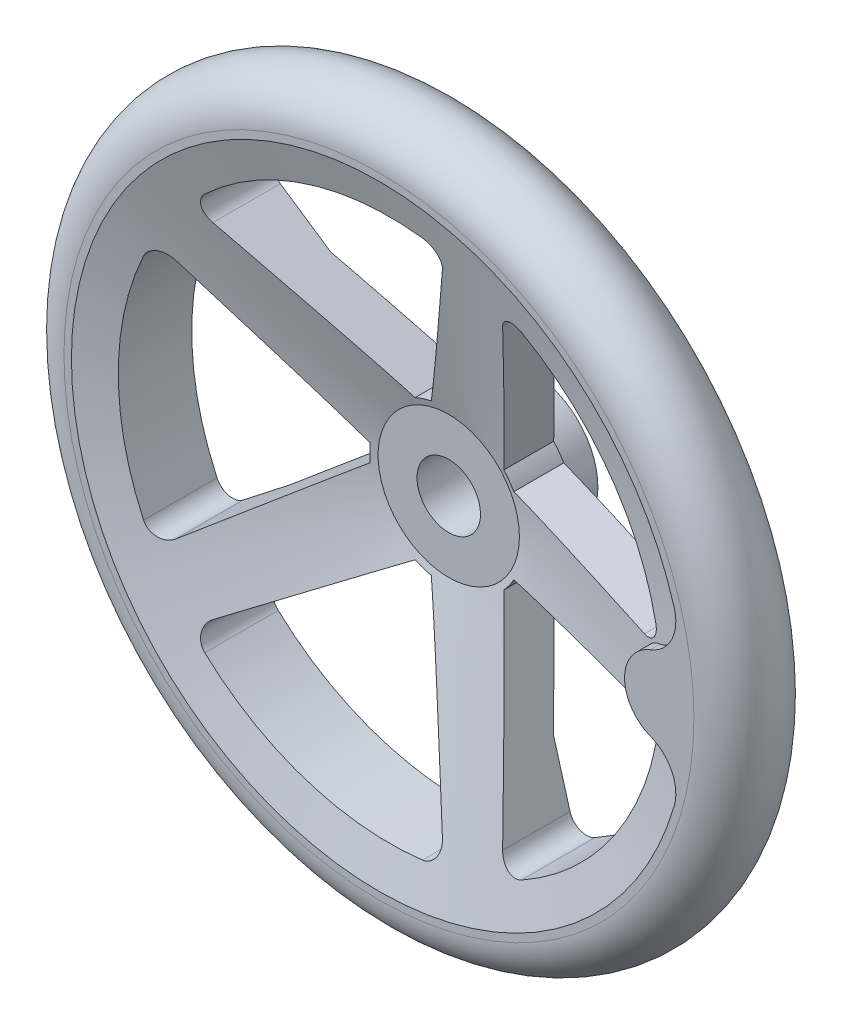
ISO-10303-21;
HEADER;
FILE_DESCRIPTION(('STEP AP214'),'2;1');
FILE_NAME('part.step','',(''),(''),'','','');
FILE_SCHEMA(('AUTOMOTIVE_DESIGN { 1 0 10303 214 1 1 1 1 }'));
ENDSEC;
DATA;
#1=APPLICATION_CONTEXT('core data for automotive mechanical design processes');
#2=APPLICATION_PROTOCOL_DEFINITION('international standard','automotive_design',2000,#1);
#3=PRODUCT_CONTEXT('',#1,'mechanical');
#4=PRODUCT('Part','Part','',(#3));
#5=PRODUCT_RELATED_PRODUCT_CATEGORY('part','',(#4));
#6=PRODUCT_DEFINITION_FORMATION('','',#4);
#7=PRODUCT_DEFINITION_CONTEXT('part definition',#1,'design');
#8=PRODUCT_DEFINITION('design','',#6,#7);
#9=PRODUCT_DEFINITION_SHAPE('','',#8);
#10=(LENGTH_UNIT() NAMED_UNIT(*) SI_UNIT(.MILLI.,.METRE.));
#11=(NAMED_UNIT(*) PLANE_ANGLE_UNIT() SI_UNIT($,.RADIAN.));
#12=(NAMED_UNIT(*) SI_UNIT($,.STERADIAN.) SOLID_ANGLE_UNIT());
#13=UNCERTAINTY_MEASURE_WITH_UNIT(LENGTH_MEASURE(1.E-05),#10,'distance_accuracy_value','');
#14=(GEOMETRIC_REPRESENTATION_CONTEXT(3) GLOBAL_UNCERTAINTY_ASSIGNED_CONTEXT((#13)) GLOBAL_UNIT_ASSIGNED_CONTEXT((#10,
#11,#12)) REPRESENTATION_CONTEXT('',''));
#15=CARTESIAN_POINT('',(0.,0.,0.));
#16=DIRECTION('',(0.,0.,1.));
#17=DIRECTION('',(1.,0.,0.));
#18=AXIS2_PLACEMENT_3D('',#15,#16,#17);
#19=CARTESIAN_POINT('',(-21.325127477,21.251999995,0.));
#20=DIRECTION('',(0.,0.,1.));
#21=DIRECTION('',(0.,-1.,0.));
#22=AXIS2_PLACEMENT_3D('',#19,#20,#21);
#23=PLANE('',#22);
#24=CARTESIAN_POINT('',(0.,0.,0.));
#25=DIRECTION('',(0.,0.,1.));
#26=DIRECTION('',(0.,-1.,0.));
#27=AXIS2_PLACEMENT_3D('',#24,#25,#26);
#28=CIRCLE('',#27,10.);
#29=CARTESIAN_POINT('',(0.,-10.,0.));
#30=VERTEX_POINT('',#29);
#31=EDGE_CURVE('E836',#30,#30,#28,.T.);
#32=ORIENTED_EDGE('',*,*,#31,.T.);
#33=EDGE_LOOP('',(#32));
#34=FACE_BOUND('',#33,.T.);
#35=CARTESIAN_POINT('',(0.,0.,0.));
#36=DIRECTION('',(0.,0.,-1.));
#37=DIRECTION('',(0.,1.,0.));
#38=AXIS2_PLACEMENT_3D('',#35,#36,#37);
#39=CIRCLE('',#38,20.999999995);
#40=CARTESIAN_POINT('',(0.,20.999999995,0.));
#41=VERTEX_POINT('',#40);
#42=EDGE_CURVE('E19',#41,#41,#39,.F.);
#43=ORIENTED_EDGE('',*,*,#42,.F.);
#44=EDGE_LOOP('',(#43));
#45=FACE_BOUND('',#44,.T.);
#46=ADVANCED_FACE('F15',(#34,#45),#23,.F.);
#47=CARTESIAN_POINT('',(0.,0.,8.578933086));
#48=DIRECTION('',(0.,0.,-1.));
#49=DIRECTION('',(0.,1.,0.));
#50=AXIS2_PLACEMENT_3D('',#47,#48,#49);
#51=CYLINDRICAL_SURFACE('',#50,20.999999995);
#52=ORIENTED_EDGE('',*,*,#42,.T.);
#53=EDGE_LOOP('',(#52));
#54=FACE_BOUND('',#53,.T.);
#55=CARTESIAN_POINT('',(0.,0.,8.578933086));
#56=DIRECTION('',(0.,0.,-1.));
#57=DIRECTION('',(0.,1.,0.));
#58=AXIS2_PLACEMENT_3D('',#55,#56,#57);
#59=CIRCLE('',#58,20.999999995);
#60=CARTESIAN_POINT('',(0.,20.999999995,8.578933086));
#61=VERTEX_POINT('',#60);
#62=CARTESIAN_POINT('',(-2.15358599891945E-09,-20.999999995,8.578933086));
#63=VERTEX_POINT('',#62);
#64=EDGE_CURVE('E789',#61,#63,#59,.T.);
#65=ORIENTED_EDGE('',*,*,#64,.T.);
#66=CARTESIAN_POINT('',(0.,0.,8.578933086));
#67=DIRECTION('',(0.,0.,-1.));
#68=DIRECTION('',(0.,1.,0.));
#69=AXIS2_PLACEMENT_3D('',#66,#67,#68);
#70=CIRCLE('',#69,20.999999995);
#71=EDGE_CURVE('E790',#63,#61,#70,.T.);
#72=ORIENTED_EDGE('',*,*,#71,.T.);
#73=EDGE_LOOP('',(#65,#72));
#74=FACE_BOUND('',#73,.T.);
#75=ADVANCED_FACE('F844',(#54,#74),#51,.T.);
#76=CARTESIAN_POINT('',(0.,0.,0.));
#77=DIRECTION('',(0.,0.,1.));
#78=DIRECTION('',(0.,-1.,0.));
#79=AXIS2_PLACEMENT_3D('',#76,#77,#78);
#80=CYLINDRICAL_SURFACE('',#79,10.);
#81=CARTESIAN_POINT('',(0.,0.,26.));
#82=DIRECTION('',(0.,0.,1.));
#83=DIRECTION('',(0.,-1.,0.));
#84=AXIS2_PLACEMENT_3D('',#81,#82,#83);
#85=CIRCLE('',#84,10.);
#86=CARTESIAN_POINT('',(0.,-10.,26.));
#87=VERTEX_POINT('',#86);
#88=EDGE_CURVE('E832',#87,#87,#85,.T.);
#89=ORIENTED_EDGE('',*,*,#88,.T.);
#90=EDGE_LOOP('',(#89));
#91=FACE_BOUND('',#90,.T.);
#92=ORIENTED_EDGE('',*,*,#31,.F.);
#93=EDGE_LOOP('',(#92));
#94=FACE_BOUND('',#93,.T.);
#95=ADVANCED_FACE('F860',(#91,#94),#80,.F.);
#96=CARTESIAN_POINT('',(0.,-22.291109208,10.30549909));
#97=CARTESIAN_POINT('',(-44.582218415,-22.291109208,10.30549909));
#98=CARTESIAN_POINT('',(-44.582218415,22.291109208,10.30549909));
#99=CARTESIAN_POINT('',(0.,22.291109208,10.30549909));
#100=CARTESIAN_POINT('',(0.,-21.496256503,10.07122295));
#101=CARTESIAN_POINT('',(-42.992513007,-21.496256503,10.07122295));
#102=CARTESIAN_POINT('',(-42.992513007,21.496256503,10.07122295));
#103=CARTESIAN_POINT('',(0.,21.496256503,10.07122295));
#104=CARTESIAN_POINT('',(0.,-20.999999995,9.407592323));
#105=CARTESIAN_POINT('',(-41.99999999,-20.999999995,9.407592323));
#106=CARTESIAN_POINT('',(-41.99999999,20.999999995,9.407592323));
#107=CARTESIAN_POINT('',(0.,20.999999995,9.407592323));
#108=CARTESIAN_POINT('',(0.,-20.999999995,8.578933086));
#109=CARTESIAN_POINT('',(-41.99999999,-20.999999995,8.57893308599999));
#110=CARTESIAN_POINT('',(-41.99999999,20.999999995,8.57893308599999));
#111=CARTESIAN_POINT('',(0.,20.999999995,8.578933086));
#112=(BOUNDED_SURFACE() B_SPLINE_SURFACE(3,3,((#96,#97,#98,#99),(#100,#101,#102,#103),(#104,
#105,#106,#107),(#108,#109,#110,#111)),.UNSPECIFIED.,.F.,.F.,
.F.) B_SPLINE_SURFACE_WITH_KNOTS((4,4),(4,4),(0.,1.),(0.,1.),
.UNSPECIFIED.) GEOMETRIC_REPRESENTATION_ITEM() RATIONAL_B_SPLINE_SURFACE(((1.,0.333333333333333,
0.333333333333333,1.),(0.867232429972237,0.289077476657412,0.289077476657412,0.867232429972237),
(0.867232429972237,0.289077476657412,0.289077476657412,0.867232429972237),(1.,0.333333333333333,
0.333333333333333,1.))) REPRESENTATION_ITEM('') SURFACE());
#113=CARTESIAN_POINT('',(0.,-22.291109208,10.30549909));
#114=CARTESIAN_POINT('',(0.,-21.496256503,10.07122295));
#115=CARTESIAN_POINT('',(0.,-20.999999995,9.407592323));
#116=CARTESIAN_POINT('',(0.,-20.999999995,8.578933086));
#117=(BOUNDED_CURVE() B_SPLINE_CURVE(3,(#113,#114,#115,#116),.UNSPECIFIED.,.F.,
.F.) B_SPLINE_CURVE_WITH_KNOTS((4,4),(0.,1.),
.UNSPECIFIED.) CURVE() GEOMETRIC_REPRESENTATION_ITEM() RATIONAL_B_SPLINE_CURVE((1.,
0.867232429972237,0.867232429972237,1.)) REPRESENTATION_ITEM(''));
#118=CARTESIAN_POINT('',(-1.00079978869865E-09,-22.291109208,10.30549909));
#119=VERTEX_POINT('',#118);
#120=EDGE_CURVE('E759',#63,#119,#117,.F.);
#121=CARTESIAN_POINT('',(0.,0.,10.30549909));
#122=DIRECTION('',(0.,0.,1.));
#123=DIRECTION('',(0.,-1.,0.));
#124=AXIS2_PLACEMENT_3D('',#121,#122,#123);
#125=CIRCLE('',#124,22.291109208);
#126=CARTESIAN_POINT('',(-6.85797438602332E-09,22.291109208,10.30549909));
#127=VERTEX_POINT('',#126);
#128=EDGE_CURVE('E771',#127,#119,#125,.T.);
#129=CARTESIAN_POINT('',(0.,22.291109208,10.30549909));
#130=CARTESIAN_POINT('',(0.,21.496256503,10.07122295));
#131=CARTESIAN_POINT('',(0.,20.999999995,9.407592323));
#132=CARTESIAN_POINT('',(0.,20.999999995,8.578933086));
#133=(BOUNDED_CURVE() B_SPLINE_CURVE(3,(#129,#130,#131,#132),.UNSPECIFIED.,.F.,
.F.) B_SPLINE_CURVE_WITH_KNOTS((4,4),(0.,1.),
.UNSPECIFIED.) CURVE() GEOMETRIC_REPRESENTATION_ITEM() RATIONAL_B_SPLINE_CURVE((1.,
0.867232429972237,0.867232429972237,1.)) REPRESENTATION_ITEM(''));
#134=EDGE_CURVE('E785',#127,#61,#133,.T.);
#135=ORIENTED_EDGE('',*,*,#120,.T.);
#136=ORIENTED_EDGE('',*,*,#128,.F.);
#137=ORIENTED_EDGE('',*,*,#134,.T.);
#138=ORIENTED_EDGE('',*,*,#71,.F.);
#139=EDGE_LOOP('',(#135,#136,#137,#138));
#140=FACE_BOUND('',#139,.T.);
#141=ADVANCED_FACE('F854',(#140),#112,.F.);
#142=CARTESIAN_POINT('',(0.,0.,10.897602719));
#143=DIRECTION('',(0.,0.,1.));
#144=DIRECTION('',(0.,-1.,0.));
#145=AXIS2_PLACEMENT_3D('',#142,#143,#144);
#146=CYLINDRICAL_SURFACE('',#145,24.299999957);
#147=DIRECTION('',(0.,0.,-1.));
#148=VECTOR('',#147,1.);
#149=CARTESIAN_POINT('',(-10.017686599,-22.139014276,26.817848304));
#150=LINE('',#149,#148);
#151=CARTESIAN_POINT('',(-10.0176865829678,-22.1390142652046,26.6009067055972));
#152=VERTEX_POINT('',#151);
#153=CARTESIAN_POINT('',(-10.017686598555,-22.1390142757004,10.8976027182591));
#154=VERTEX_POINT('',#153);
#155=EDGE_CURVE('E1022',#152,#154,#150,.T.);
#156=ORIENTED_EDGE('',*,*,#155,.T.);
#157=CARTESIAN_POINT('',(0.,0.,10.8976027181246));
#158=DIRECTION('',(0.,0.,1.));
#159=DIRECTION('',(0.,-1.,0.));
#160=AXIS2_PLACEMENT_3D('',#157,#158,#159);
#161=CIRCLE('',#160,24.2999999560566);
#162=CARTESIAN_POINT('',(-4.90850734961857,-23.7990872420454,10.8976027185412));
#163=VERTEX_POINT('',#162);
#164=EDGE_CURVE('E775',#163,#154,#161,.F.);
#165=ORIENTED_EDGE('',*,*,#164,.F.);
#166=DIRECTION('',(0.,0.,1.));
#167=VECTOR('',#166,1.);
#168=CARTESIAN_POINT('',(-4.90850735,-23.799087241,26.8178484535));
#169=LINE('',#168,#167);
#170=CARTESIAN_POINT('',(-4.90850735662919,-23.7990872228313,26.6009067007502));
#171=VERTEX_POINT('',#170);
#172=EDGE_CURVE('E1011',#163,#171,#169,.T.);
#173=ORIENTED_EDGE('',*,*,#172,.T.);
#174=CARTESIAN_POINT('',(0.,0.,26.6009067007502));
#175=DIRECTION('',(0.,0.,1.));
#176=DIRECTION('',(0.,-1.,0.));
#177=AXIS2_PLACEMENT_3D('',#174,#175,#176);
#178=CIRCLE('',#177,24.2999999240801);
#179=EDGE_CURVE('E817',#171,#152,#178,.F.);
#180=ORIENTED_EDGE('',*,*,#179,.T.);
#181=EDGE_LOOP('',(#156,#165,#173,#180));
#182=FACE_BOUND('',#181,.T.);
#183=ADVANCED_FACE('F859',(#182),#146,.T.);
#184=CARTESIAN_POINT('',(0.,0.,10.897602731));
#185=DIRECTION('',(0.,0.,1.));
#186=DIRECTION('',(0.,-1.,0.));
#187=AXIS2_PLACEMENT_3D('',#184,#185,#186);
#188=CYLINDRICAL_SURFACE('',#187,24.3);
#189=DIRECTION('',(0.,0.,-1.));
#190=VECTOR('',#189,1.);
#191=CARTESIAN_POINT('',(-24.151089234,2.686054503,26.817848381));
#192=LINE('',#191,#190);
#193=CARTESIAN_POINT('',(-24.1510892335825,2.68605450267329,26.6009067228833));
#194=VERTEX_POINT('',#193);
#195=CARTESIAN_POINT('',(-24.1510892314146,2.68605450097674,10.8976027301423));
#196=VERTEX_POINT('',#195);
#197=EDGE_CURVE('E776',#194,#196,#192,.T.);
#198=ORIENTED_EDGE('',*,*,#197,.T.);
#199=CARTESIAN_POINT('',(0.,0.,10.8976027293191));
#200=DIRECTION('',(0.,0.,1.));
#201=DIRECTION('',(0.,-1.,0.));
#202=AXIS2_PLACEMENT_3D('',#199,#200,#201);
#203=CIRCLE('',#202,24.2999999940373);
#204=CARTESIAN_POINT('',(-24.1510892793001,-2.68605408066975,10.8976027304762));
#205=VERTEX_POINT('',#204);
#206=EDGE_CURVE('E416',#205,#196,#203,.F.);
#207=ORIENTED_EDGE('',*,*,#206,.F.);
#208=DIRECTION('',(0.,0.,1.));
#209=VECTOR('',#208,1.);
#210=CARTESIAN_POINT('',(-24.151089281,-2.686054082,26.817848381));
#211=LINE('',#210,#209);
#212=CARTESIAN_POINT('',(-24.1510892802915,-2.68605408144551,26.6009067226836));
#213=VERTEX_POINT('',#212);
#214=EDGE_CURVE('E388',#205,#213,#211,.T.);
#215=ORIENTED_EDGE('',*,*,#214,.T.);
#216=CARTESIAN_POINT('',(0.,0.,26.6009067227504));
#217=DIRECTION('',(0.,0.,1.));
#218=DIRECTION('',(0.,-1.,0.));
#219=AXIS2_PLACEMENT_3D('',#216,#217,#218);
#220=CIRCLE('',#219,24.2999999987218);
#221=EDGE_CURVE('E816',#213,#194,#220,.F.);
#222=ORIENTED_EDGE('',*,*,#221,.T.);
#223=EDGE_LOOP('',(#198,#207,#215,#222));
#224=FACE_BOUND('',#223,.T.);
#225=ADVANCED_FACE('F866',(#224),#188,.T.);
#226=CARTESIAN_POINT('',(0.,0.,10.897602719));
#227=DIRECTION('',(0.,0.,1.));
#228=DIRECTION('',(0.,-1.,0.));
#229=AXIS2_PLACEMENT_3D('',#226,#227,#228);
#230=CYLINDRICAL_SURFACE('',#229,24.299999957);
#231=DIRECTION('',(0.,0.,-1.));
#232=VECTOR('',#231,1.);
#233=CARTESIAN_POINT('',(-4.90850735,23.799087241,26.8178484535));
#234=LINE('',#233,#232);
#235=CARTESIAN_POINT('',(-4.90850735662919,23.7990872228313,26.6009067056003));
#236=VERTEX_POINT('',#235);
#237=CARTESIAN_POINT('',(-4.90850734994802,23.7990872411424,10.8976027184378));
#238=VERTEX_POINT('',#237);
#239=EDGE_CURVE('E1044',#236,#238,#234,.T.);
#240=ORIENTED_EDGE('',*,*,#239,.T.);
#241=CARTESIAN_POINT('',(0.,0.,10.8976027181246));
#242=DIRECTION('',(0.,0.,1.));
#243=DIRECTION('',(0.,-1.,0.));
#244=AXIS2_PLACEMENT_3D('',#241,#242,#243);
#245=CIRCLE('',#244,24.2999999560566);
#246=CARTESIAN_POINT('',(-10.017686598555,22.1390142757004,10.8976027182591));
#247=VERTEX_POINT('',#246);
#248=EDGE_CURVE('E805',#247,#238,#245,.F.);
#249=ORIENTED_EDGE('',*,*,#248,.F.);
#250=DIRECTION('',(0.,0.,1.));
#251=VECTOR('',#250,1.);
#252=CARTESIAN_POINT('',(-10.017686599,22.139014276,26.817848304));
#253=LINE('',#252,#251);
#254=CARTESIAN_POINT('',(-10.0176865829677,22.1390142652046,26.6009067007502));
#255=VERTEX_POINT('',#254);
#256=EDGE_CURVE('E1040',#247,#255,#253,.T.);
#257=ORIENTED_EDGE('',*,*,#256,.T.);
#258=CARTESIAN_POINT('',(0.,0.,26.6009067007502));
#259=DIRECTION('',(0.,0.,1.));
#260=DIRECTION('',(0.,-1.,0.));
#261=AXIS2_PLACEMENT_3D('',#258,#259,#260);
#262=CIRCLE('',#261,24.2999999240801);
#263=EDGE_CURVE('E812',#255,#236,#262,.F.);
#264=ORIENTED_EDGE('',*,*,#263,.T.);
#265=EDGE_LOOP('',(#240,#249,#257,#264));
#266=FACE_BOUND('',#265,.T.);
#267=ADVANCED_FACE('F882',(#266),#230,.T.);
#268=CARTESIAN_POINT('',(0.,22.291109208,10.30549909));
#269=CARTESIAN_POINT('',(44.582218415,22.291109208,10.30549909));
#270=CARTESIAN_POINT('',(44.582218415,-22.291109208,10.30549909));
#271=CARTESIAN_POINT('',(0.,-22.291109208,10.30549909));
#272=CARTESIAN_POINT('',(0.,21.496256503,10.07122295));
#273=CARTESIAN_POINT('',(42.992513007,21.496256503,10.07122295));
#274=CARTESIAN_POINT('',(42.992513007,-21.496256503,10.07122295));
#275=CARTESIAN_POINT('',(0.,-21.496256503,10.07122295));
#276=CARTESIAN_POINT('',(0.,20.999999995,9.407592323));
#277=CARTESIAN_POINT('',(41.99999999,20.999999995,9.407592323));
#278=CARTESIAN_POINT('',(41.99999999,-20.999999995,9.407592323));
#279=CARTESIAN_POINT('',(0.,-20.999999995,9.407592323));
#280=CARTESIAN_POINT('',(0.,20.999999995,8.578933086));
#281=CARTESIAN_POINT('',(41.99999999,20.999999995,8.57893308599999));
#282=CARTESIAN_POINT('',(41.99999999,-20.999999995,8.57893308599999));
#283=CARTESIAN_POINT('',(0.,-20.999999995,8.578933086));
#284=(BOUNDED_SURFACE() B_SPLINE_SURFACE(3,3,((#268,#269,#270,#271),(#272,#273,#274,#275),(#276,
#277,#278,#279),(#280,#281,#282,#283)),.UNSPECIFIED.,.F.,.F.,
.F.) B_SPLINE_SURFACE_WITH_KNOTS((4,4),(4,4),(0.,1.),(0.,1.),
.UNSPECIFIED.) GEOMETRIC_REPRESENTATION_ITEM() RATIONAL_B_SPLINE_SURFACE(((1.,0.333333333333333,
0.333333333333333,1.),(0.867232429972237,0.289077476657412,0.289077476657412,0.867232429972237),
(0.867232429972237,0.289077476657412,0.289077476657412,0.867232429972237),(1.,0.333333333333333,
0.333333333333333,1.))) REPRESENTATION_ITEM('') SURFACE());
#285=CARTESIAN_POINT('',(0.,0.,10.30549909));
#286=DIRECTION('',(0.,0.,1.));
#287=DIRECTION('',(0.,-1.,0.));
#288=AXIS2_PLACEMENT_3D('',#285,#286,#287);
#289=CIRCLE('',#288,22.291109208);
#290=EDGE_CURVE('E724',#119,#127,#289,.T.);
#291=ORIENTED_EDGE('',*,*,#64,.F.);
#292=ORIENTED_EDGE('',*,*,#134,.F.);
#293=ORIENTED_EDGE('',*,*,#290,.F.);
#294=ORIENTED_EDGE('',*,*,#120,.F.);
#295=EDGE_LOOP('',(#291,#292,#293,#294));
#296=FACE_BOUND('',#295,.T.);
#297=ADVANCED_FACE('F850',(#296),#284,.F.);
#298=CARTESIAN_POINT('',(80.955203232,23.520877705,44.851045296));
#299=DIRECTION('',(0.,0.,1.));
#300=DIRECTION('',(0.,-1.,0.));
#301=AXIS2_PLACEMENT_3D('',#298,#299,#300);
#302=CYLINDRICAL_SURFACE('',#301,12.6);
#303=CARTESIAN_POINT('',(93.05485395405,27.0363333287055,47.9999966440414));
#304=CARTESIAN_POINT('',(93.1514522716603,26.7040151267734,48.0000043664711));
#305=CARTESIAN_POINT('',(93.2342741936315,26.3677037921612,47.9963404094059));
#306=CARTESIAN_POINT('',(93.3719678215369,25.6895980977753,47.9817284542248));
#307=CARTESIAN_POINT('',(93.4268424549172,25.3478043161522,47.9707812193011));
#308=CARTESIAN_POINT('',(93.5082023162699,24.6616905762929,47.9416842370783));
#309=CARTESIAN_POINT('',(93.5347307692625,24.3173752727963,47.9235455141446));
#310=CARTESIAN_POINT('',(93.5594631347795,23.6281777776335,47.8801803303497));
#311=CARTESIAN_POINT('',(93.5576670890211,23.2832955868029,47.8549538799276));
#312=CARTESIAN_POINT('',(93.5258833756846,22.5953514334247,47.7975618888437));
#313=CARTESIAN_POINT('',(93.4958904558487,22.252289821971,47.7653950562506));
#314=CARTESIAN_POINT('',(93.4080742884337,21.5704526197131,47.6943197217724));
#315=CARTESIAN_POINT('',(93.3502505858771,21.2316770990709,47.6554111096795));
#316=CARTESIAN_POINT('',(93.2073600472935,20.5607615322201,47.5710862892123));
#317=CARTESIAN_POINT('',(93.1222940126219,20.2286212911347,47.5256702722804));
#318=CARTESIAN_POINT('',(92.925706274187,19.5732056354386,47.4285969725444));
#319=CARTESIAN_POINT('',(92.8141844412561,19.2499302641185,47.3769396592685));
#320=CARTESIAN_POINT('',(92.5641109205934,18.6104195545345,47.2670027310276));
#321=CARTESIAN_POINT('',(92.4252405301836,18.2943216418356,47.2086487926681));
#322=CARTESIAN_POINT('',(92.1225587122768,17.6754669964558,47.0861886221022));
#323=CARTESIAN_POINT('',(91.9587469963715,17.3727104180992,47.0220823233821));
#324=CARTESIAN_POINT('',(91.6074572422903,16.7823688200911,46.8884609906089));
#325=CARTESIAN_POINT('',(91.4199711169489,16.4947890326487,46.8189441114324));
#326=CARTESIAN_POINT('',(91.022847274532,15.936693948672,46.6749123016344));
#327=CARTESIAN_POINT('',(90.813209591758,15.6661786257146,46.6003973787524));
#328=CARTESIAN_POINT('',(90.3667339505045,15.1359633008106,46.444466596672));
#329=CARTESIAN_POINT('',(90.1292672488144,14.8768338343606,46.3629105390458));
#330=CARTESIAN_POINT('',(89.6343225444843,14.37998848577,46.1954002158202));
#331=CARTESIAN_POINT('',(89.376843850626,14.1422733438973,46.1094457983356));
#332=CARTESIAN_POINT('',(88.8439354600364,13.6898038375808,45.9336793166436));
#333=CARTESIAN_POINT('',(88.5685155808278,13.4750370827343,45.8438693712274));
#334=CARTESIAN_POINT('',(88.0016646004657,13.0696201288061,45.6608871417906));
#335=CARTESIAN_POINT('',(87.7102384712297,12.878962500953,45.5677159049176));
#336=CARTESIAN_POINT('',(87.1026434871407,12.5164011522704,45.37512722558));
#337=CARTESIAN_POINT('',(86.7859626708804,12.3454104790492,45.2756055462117));
#338=CARTESIAN_POINT('',(86.1404483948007,12.0316666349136,45.0743021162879));
#339=CARTESIAN_POINT('',(85.8116407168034,11.8888572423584,44.9725253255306));
#340=CARTESIAN_POINT('',(85.4776011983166,11.7604390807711,44.8698263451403));
#341=B_SPLINE_CURVE_WITH_KNOTS('',3,(#303,#304,#305,#306,#307,#308,#309,#310,#311,#312,#313,
#314,#315,#316,#317,#318,#319,#320,#321,#322,#323,#324,#325,#326,#327,#328,#329,#330,#331,#332,
#333,#334,#335,#336,#337,#338,#339,#340),.UNSPECIFIED.,.F.,.F.,(4,2,2,2,2,2,2,2,2,2,2,2,2,2,2,2,
2,2,4),(0.,1.03789117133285,2.07567360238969,3.1118712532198,4.14806737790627,5.18445655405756,
6.22086267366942,7.25723830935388,8.29361900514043,9.34287987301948,10.3921528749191,
11.4417852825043,12.4914160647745,13.5726370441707,14.6538953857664,15.7345669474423,
16.8149047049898,17.9338286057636,19.0504971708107),.UNSPECIFIED.);
#342=CARTESIAN_POINT('',(93.0548588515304,27.0363347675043,47.999998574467));
#343=VERTEX_POINT('',#342);
#344=CARTESIAN_POINT('',(85.4776011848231,11.7604390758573,44.8698263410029));
#345=VERTEX_POINT('',#344);
#346=EDGE_CURVE('E286',#343,#345,#341,.T.);
#347=ORIENTED_EDGE('',*,*,#346,.T.);
#348=DIRECTION('',(0.,0.,-1.));
#349=VECTOR('',#348,1.);
#350=CARTESIAN_POINT('',(85.4776011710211,11.7604390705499,45.0985605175));
#351=LINE('',#350,#349);
#352=CARTESIAN_POINT('',(85.4776011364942,11.7604390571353,48.));
#353=VERTEX_POINT('',#352);
#354=EDGE_CURVE('E756',#353,#345,#351,.T.);
#355=ORIENTED_EDGE('',*,*,#354,.F.);
#356=CARTESIAN_POINT('',(80.955203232,23.520877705,48.));
#357=DIRECTION('',(0.,0.,1.));
#358=DIRECTION('',(0.,-1.,0.));
#359=AXIS2_PLACEMENT_3D('',#356,#357,#358);
#360=CIRCLE('',#359,12.6);
#361=EDGE_CURVE('E1445',#353,#343,#360,.T.);
#362=ORIENTED_EDGE('',*,*,#361,.T.);
#363=EDGE_LOOP('',(#347,#355,#362));
#364=FACE_BOUND('',#363,.T.);
#365=ADVANCED_FACE('F890',(#364),#302,.F.);
#366=CARTESIAN_POINT('',(89.999999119,0.,42.2168418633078));
#367=DIRECTION('',(0.,0.,1.));
#368=DIRECTION('',(0.,-1.,0.));
#369=AXIS2_PLACEMENT_3D('',#366,#367,#368);
#370=CYLINDRICAL_SURFACE('',#369,12.60000041);
#371=DIRECTION('',(0.,0.,1.));
#372=VECTOR('',#371,1.);
#373=CARTESIAN_POINT('',(85.4776012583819,-11.7604391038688,46.4255226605));
#374=LINE('',#373,#372);
#375=CARTESIAN_POINT('',(85.4776012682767,-11.7604391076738,44.8698263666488));
#376=VERTEX_POINT('',#375);
#377=CARTESIAN_POINT('',(85.4776011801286,-11.7604390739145,48.));
#378=VERTEX_POINT('',#377);
#379=EDGE_CURVE('E275',#376,#378,#374,.T.);
#380=ORIENTED_EDGE('',*,*,#379,.T.);
#381=CARTESIAN_POINT('',(89.999999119,0.,48.));
#382=DIRECTION('',(0.,0.,1.));
#383=DIRECTION('',(0.,-1.,0.));
#384=AXIS2_PLACEMENT_3D('',#381,#382,#383);
#385=CIRCLE('',#384,12.60000041);
#386=EDGE_CURVE('E271',#378,#353,#385,.F.);
#387=ORIENTED_EDGE('',*,*,#386,.T.);
#388=ORIENTED_EDGE('',*,*,#354,.T.);
#389=CARTESIAN_POINT('',(85.4776012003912,11.7604390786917,44.8698263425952));
#390=CARTESIAN_POINT('',(85.1429246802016,11.6317718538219,44.7669400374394));
#391=CARTESIAN_POINT('',(84.8134872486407,11.4886615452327,44.6650273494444));
#392=CARTESIAN_POINT('',(84.1673070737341,11.1744623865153,44.4639485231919));
#393=CARTESIAN_POINT('',(83.8505660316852,11.0033698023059,44.3647827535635));
#394=CARTESIAN_POINT('',(83.2316645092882,10.6338971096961,44.1698923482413));
#395=CARTESIAN_POINT('',(82.9295244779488,10.4354801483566,44.0741725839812));
#396=CARTESIAN_POINT('',(82.342536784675,10.0126961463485,43.8871710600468));
#397=CARTESIAN_POINT('',(82.0576881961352,9.78833049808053,43.795889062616));
#398=CARTESIAN_POINT('',(81.5070629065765,9.31461935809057,43.6184958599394));
#399=CARTESIAN_POINT('',(81.2413145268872,9.06523803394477,43.5323923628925));
#400=CARTESIAN_POINT('',(80.7315130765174,8.54331557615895,43.3663872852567));
#401=CARTESIAN_POINT('',(80.4874591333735,8.27077537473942,43.2864854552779));
#402=CARTESIAN_POINT('',(80.023300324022,7.70450594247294,43.133821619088));
#403=CARTESIAN_POINT('',(79.8031771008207,7.41079324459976,43.0610541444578));
#404=CARTESIAN_POINT('',(79.3886531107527,6.80399429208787,42.9234542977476));
#405=CARTESIAN_POINT('',(79.1942512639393,6.4909088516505,42.8586215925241));
#406=CARTESIAN_POINT('',(78.8391337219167,5.85850810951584,42.7397621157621));
#407=CARTESIAN_POINT('',(78.6775000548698,5.53976302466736,42.6854437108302));
#408=CARTESIAN_POINT('',(78.3814682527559,4.88852480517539,42.5856659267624));
#409=CARTESIAN_POINT('',(78.247069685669,4.55603188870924,42.540206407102));
#410=CARTESIAN_POINT('',(78.0068248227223,3.87976084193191,42.4587538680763));
#411=CARTESIAN_POINT('',(77.9009780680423,3.53598289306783,42.4227606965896));
#412=CARTESIAN_POINT('',(77.7189144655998,2.83979056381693,42.3607442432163));
#413=CARTESIAN_POINT('',(77.6426964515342,2.48737652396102,42.334720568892));
#414=CARTESIAN_POINT('',(77.5236671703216,1.79408838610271,42.2940373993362));
#415=CARTESIAN_POINT('',(77.4794060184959,1.45349139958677,42.2788849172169));
#416=CARTESIAN_POINT('',(77.4188355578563,0.769536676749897,42.258141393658));
#417=CARTESIAN_POINT('',(77.4025252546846,0.426179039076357,42.2525500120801));
#418=CARTESIAN_POINT('',(77.3980157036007,-0.260667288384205,42.2510044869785));
#419=CARTESIAN_POINT('',(77.4098104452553,-0.604155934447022,42.255048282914));
#420=CARTESIAN_POINT('',(77.4613826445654,-1.28877648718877,42.2727137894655));
#421=CARTESIAN_POINT('',(77.5011599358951,-1.6299084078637,42.2863354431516));
#422=CARTESIAN_POINT('',(77.607083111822,-2.29954777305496,42.3225535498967));
#423=CARTESIAN_POINT('',(77.6726057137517,-2.62816557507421,42.3449378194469));
#424=CARTESIAN_POINT('',(77.8293983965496,-3.27846841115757,42.3983930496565));
#425=CARTESIAN_POINT('',(77.920667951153,-3.60015358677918,42.4294638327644));
#426=CARTESIAN_POINT('',(78.1281434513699,-4.23442939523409,42.4999125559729));
#427=CARTESIAN_POINT('',(78.2443488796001,-4.54702021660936,42.5392903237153));
#428=CARTESIAN_POINT('',(78.5007032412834,-5.16109610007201,42.6258925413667));
#429=CARTESIAN_POINT('',(78.6408526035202,-5.46258096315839,42.6731171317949));
#430=CARTESIAN_POINT('',(78.9465829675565,-6.05771023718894,42.7757724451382));
#431=CARTESIAN_POINT('',(79.1125642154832,-6.35112679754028,42.8313317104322));
#432=CARTESIAN_POINT('',(79.4667707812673,-6.92272824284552,42.9494201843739));
#433=CARTESIAN_POINT('',(79.6549964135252,-7.2009129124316,43.0119494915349));
#434=CARTESIAN_POINT('',(80.0523354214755,-7.74056397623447,43.1433684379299));
#435=CARTESIAN_POINT('',(80.2614593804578,-8.00202178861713,43.2122612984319));
#436=CARTESIAN_POINT('',(80.69896885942,-8.50660673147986,43.3557143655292));
#437=CARTESIAN_POINT('',(80.9273543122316,-8.74973392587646,43.4302745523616));
#438=CARTESIAN_POINT('',(81.4126487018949,-9.22705225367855,43.5879189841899));
#439=CARTESIAN_POINT('',(81.6703845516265,-9.46032572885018,43.6712371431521));
#440=CARTESIAN_POINT('',(82.2032955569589,-9.90412378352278,43.8425729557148));
#441=CARTESIAN_POINT('',(82.47847138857,-10.1146474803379,43.9305907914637));
#442=CARTESIAN_POINT('',(83.0439722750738,-10.5115604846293,44.1104544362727));
#443=CARTESIAN_POINT('',(83.3342784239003,-10.6979789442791,44.2022954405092));
#444=CARTESIAN_POINT('',(83.9283005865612,-11.0459441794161,44.389138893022));
#445=CARTESIAN_POINT('',(84.232010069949,-11.2075028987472,44.4841397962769));
#446=CARTESIAN_POINT('',(84.694902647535,-11.4300036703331,44.6280899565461));
#447=CARTESIAN_POINT('',(84.8497891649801,-11.5006215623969,44.6761203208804));
#448=CARTESIAN_POINT('',(85.1619240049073,-11.6353721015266,44.772634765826));
#449=CARTESIAN_POINT('',(85.3191684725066,-11.6995142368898,44.8211180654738));
#450=CARTESIAN_POINT('',(85.4776012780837,-11.7604391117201,44.8698263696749));
#451=B_SPLINE_CURVE_WITH_KNOTS('',3,(#389,#390,#391,#392,#393,#394,#395,#396,#397,#398,#399,
#400,#401,#402,#403,#404,#405,#406,#407,#408,#409,#410,#411,#412,#413,#414,#415,#416,#417,#418,
#419,#420,#421,#422,#423,#424,#425,#426,#427,#428,#429,#430,#431,#432,#433,#434,#435,#436,#437,
#438,#439,#440,#441,#442,#443,#444,#445,#446,#447,#448,#449,#450),.UNSPECIFIED.,.F.,.F.,(4,2,2,
2,2,2,2,2,2,2,2,2,2,2,2,2,2,2,2,2,2,2,2,2,2,2,2,2,2,2,4),(0.,1.11878650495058,2.23772242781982,
3.35818253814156,4.47858255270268,5.6006109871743,6.7225942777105,7.84371074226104,
8.96478012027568,10.0478769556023,11.1309566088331,12.2140188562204,13.2970384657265,
14.3271589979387,15.3572428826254,16.3871064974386,17.4169639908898,18.4232895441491,
19.4295945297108,20.4358786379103,21.4421807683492,22.4660007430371,23.4898351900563,
24.5141907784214,25.5385427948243,26.6097573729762,27.6810134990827,28.7509617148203,
29.8203942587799,30.3508936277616,30.8806040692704),.UNSPECIFIED.);
#452=EDGE_CURVE('E293',#345,#376,#451,.T.);
#453=ORIENTED_EDGE('',*,*,#452,.T.);
#454=EDGE_LOOP('',(#380,#387,#388,#453));
#455=FACE_BOUND('',#454,.T.);
#456=ADVANCED_FACE('F317',(#455),#370,.T.);
#457=CARTESIAN_POINT('',(80.955203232,-23.520877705,44.851045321));
#458=DIRECTION('',(0.,0.,1.));
#459=DIRECTION('',(0.,-1.,0.));
#460=AXIS2_PLACEMENT_3D('',#457,#458,#459);
#461=CYLINDRICAL_SURFACE('',#460,12.6);
#462=CARTESIAN_POINT('',(85.4776012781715,-11.7604391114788,44.8698263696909));
#463=CARTESIAN_POINT('',(85.8144195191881,-11.8899258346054,44.9733797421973));
#464=CARTESIAN_POINT('',(86.1459130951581,-12.0340411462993,45.0759937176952));
#465=CARTESIAN_POINT('',(86.795945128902,-12.3505504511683,45.2787314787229));
#466=CARTESIAN_POINT('',(87.1144824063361,-12.5229470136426,45.3788550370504));
#467=CARTESIAN_POINT('',(87.7364451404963,-12.8951427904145,45.5760484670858));
#468=CARTESIAN_POINT('',(88.039860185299,-13.0949605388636,45.6731162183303));
#469=CARTESIAN_POINT('',(88.6290434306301,-13.5206654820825,45.8635270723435));
#470=CARTESIAN_POINT('',(88.9148124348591,-13.7465514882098,45.9568703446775));
#471=CARTESIAN_POINT('',(89.4668297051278,-14.2232770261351,46.1393746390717));
#472=CARTESIAN_POINT('',(89.7330532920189,-14.4741471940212,46.2285303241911));
#473=CARTESIAN_POINT('',(90.2434198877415,-14.9989647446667,46.4019777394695));
#474=CARTESIAN_POINT('',(90.4875634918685,-15.2729115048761,46.4862696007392));
#475=CARTESIAN_POINT('',(90.9515697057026,-15.8418595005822,46.6494076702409));
#476=CARTESIAN_POINT('',(91.1714478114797,-16.1368470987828,46.7282573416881));
#477=CARTESIAN_POINT('',(91.5851703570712,-16.7459727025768,46.8800640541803));
#478=CARTESIAN_POINT('',(91.7790156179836,-17.0601101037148,46.9530212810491));
#479=CARTESIAN_POINT('',(92.1345199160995,-17.6974118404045,47.0908687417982));
#480=CARTESIAN_POINT('',(92.296847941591,-18.0201699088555,47.155912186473));
#481=CARTESIAN_POINT('',(92.5935691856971,-18.6794817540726,47.279529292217));
#482=CARTESIAN_POINT('',(92.7279624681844,-19.0160354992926,47.3381029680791));
#483=CARTESIAN_POINT('',(92.9675793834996,-19.7006172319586,47.4484246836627));
#484=CARTESIAN_POINT('',(93.0727912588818,-20.0486497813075,47.5001699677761));
#485=CARTESIAN_POINT('',(93.252907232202,-20.7534329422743,47.5964649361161));
#486=CARTESIAN_POINT('',(93.3278130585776,-21.1101830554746,47.6410150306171));
#487=CARTESIAN_POINT('',(93.4445397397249,-21.8177213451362,47.7212696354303));
#488=CARTESIAN_POINT('',(93.4873758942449,-22.1683145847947,47.7572185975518));
#489=CARTESIAN_POINT('',(93.5434666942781,-22.8725188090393,47.8218864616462));
#490=CARTESIAN_POINT('',(93.5567223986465,-23.226129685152,47.8506056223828));
#491=CARTESIAN_POINT('',(93.5534097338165,-23.933211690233,47.9005933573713));
#492=CARTESIAN_POINT('',(93.5368849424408,-24.2866822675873,47.9218727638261));
#493=CARTESIAN_POINT('',(93.4741133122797,-24.9912063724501,47.9568932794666));
#494=CARTESIAN_POINT('',(93.4278815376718,-25.3422610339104,47.9706382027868));
#495=CARTESIAN_POINT('',(93.3272614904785,-25.9178173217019,47.9870493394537));
#496=CARTESIAN_POINT('',(93.2813353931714,-26.1437726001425,47.9919073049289));
#497=CARTESIAN_POINT('',(93.1772362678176,-26.5925052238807,47.9983783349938));
#498=CARTESIAN_POINT('',(93.1190832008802,-26.8152871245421,47.9999966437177));
#499=CARTESIAN_POINT('',(93.0548552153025,-27.0363324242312,47.9999959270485));
#500=B_SPLINE_CURVE_WITH_KNOTS('',3,(#462,#463,#464,#465,#466,#467,#468,#469,#470,#471,#472,
#473,#474,#475,#476,#477,#478,#479,#480,#481,#482,#483,#484,#485,#486,#487,#488,#489,#490,#491,
#492,#493,#494,#495,#496,#497,#498,#499),.UNSPECIFIED.,.F.,.F.,(4,2,2,2,2,2,2,2,2,2,2,2,2,2,2,2,
2,2,4),(0.,1.12593984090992,2.25198202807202,3.37878909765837,4.50554480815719,5.63369959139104,
6.76182394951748,7.88922366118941,9.01658780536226,10.116491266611,11.2163922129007,
12.316735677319,13.4170163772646,14.4807895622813,15.5445246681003,16.6067044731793,
17.6683460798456,18.3598824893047,19.0502985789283),.UNSPECIFIED.);
#501=CARTESIAN_POINT('',(93.0548591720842,-27.036333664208,47.999998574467));
#502=VERTEX_POINT('',#501);
#503=EDGE_CURVE('E283',#376,#502,#500,.T.);
#504=ORIENTED_EDGE('',*,*,#503,.T.);
#505=CARTESIAN_POINT('',(80.955203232,-23.520877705,48.));
#506=DIRECTION('',(0.,0.,1.));
#507=DIRECTION('',(0.,-1.,0.));
#508=AXIS2_PLACEMENT_3D('',#505,#506,#507);
#509=CIRCLE('',#508,12.6);
#510=EDGE_CURVE('E263',#502,#378,#509,.T.);
#511=ORIENTED_EDGE('',*,*,#510,.T.);
#512=ORIENTED_EDGE('',*,*,#379,.F.);
#513=EDGE_LOOP('',(#504,#511,#512));
#514=FACE_BOUND('',#513,.T.);
#515=ADVANCED_FACE('F290',(#514),#461,.F.);
#516=CARTESIAN_POINT('',(-100.786615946,-100.441001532,48.));
#517=DIRECTION('',(0.,0.,-1.));
#518=DIRECTION('',(0.,1.,0.));
#519=AXIS2_PLACEMENT_3D('',#516,#517,#518);
#520=PLANE('',#519);
#521=ORIENTED_EDGE('',*,*,#386,.F.);
#522=ORIENTED_EDGE('',*,*,#510,.F.);
#523=CARTESIAN_POINT('',(0.,0.,48.));
#524=DIRECTION('',(0.,0.,-1.));
#525=DIRECTION('',(0.,1.,0.));
#526=AXIS2_PLACEMENT_3D('',#523,#524,#525);
#527=CIRCLE('',#526,96.9028999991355);
#528=EDGE_CURVE('E268',#502,#343,#527,.T.);
#529=ORIENTED_EDGE('',*,*,#528,.T.);
#530=ORIENTED_EDGE('',*,*,#361,.F.);
#531=EDGE_LOOP('',(#521,#522,#529,#530));
#532=FACE_BOUND('',#531,.T.);
#533=CARTESIAN_POINT('',(0.,0.,48.));
#534=DIRECTION('',(0.,0.,-1.));
#535=DIRECTION('',(0.,1.,0.));
#536=AXIS2_PLACEMENT_3D('',#533,#534,#535);
#537=CIRCLE('',#536,99.2500015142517);
#538=CARTESIAN_POINT('',(0.,99.2500015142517,48.));
#539=VERTEX_POINT('',#538);
#540=EDGE_CURVE('E824',#539,#539,#537,.T.);
#541=ORIENTED_EDGE('',*,*,#540,.F.);
#542=EDGE_LOOP('',(#541));
#543=FACE_BOUND('',#542,.T.);
#544=ADVANCED_FACE('F265',(#532,#543),#520,.F.);
#545=CARTESIAN_POINT('',(-22.605896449,-22.528376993,26.));
#546=DIRECTION('',(0.,0.,-1.));
#547=DIRECTION('',(0.,1.,0.));
#548=AXIS2_PLACEMENT_3D('',#545,#546,#547);
#549=PLANE('',#548);
#550=ORIENTED_EDGE('',*,*,#88,.F.);
#551=EDGE_LOOP('',(#550));
#552=FACE_BOUND('',#551,.T.);
#553=CARTESIAN_POINT('',(0.,0.,26.));
#554=DIRECTION('',(0.,0.,1.));
#555=DIRECTION('',(1.,0.,0.));
#556=AXIS2_PLACEMENT_3D('',#553,#554,#555);
#557=CIRCLE('',#556,22.2612420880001);
#558=CARTESIAN_POINT('',(22.2612420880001,0.,26.));
#559=VERTEX_POINT('',#558);
#560=EDGE_CURVE('E532',#559,#559,#557,.T.);
#561=ORIENTED_EDGE('',*,*,#560,.T.);
#562=EDGE_LOOP('',(#561));
#563=FACE_BOUND('',#562,.T.);
#564=ADVANCED_FACE('F1348',(#552,#563),#549,.F.);
#565=CARTESIAN_POINT('',(0.,0.,10.89760277));
#566=DIRECTION('',(0.,0.,1.));
#567=DIRECTION('',(0.,-1.,0.));
#568=AXIS2_PLACEMENT_3D('',#565,#566,#567);
#569=CYLINDRICAL_SURFACE('',#568,24.300000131);
#570=DIRECTION('',(0.,0.,-1.));
#571=VECTOR('',#570,1.);
#572=CARTESIAN_POINT('',(21.117464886,12.022590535,26.8178483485));
#573=LINE('',#572,#571);
#574=CARTESIAN_POINT('',(21.1174648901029,12.0225905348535,26.6009067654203));
#575=VERTEX_POINT('',#574);
#576=CARTESIAN_POINT('',(21.1174648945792,12.0225905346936,10.8976027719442));
#577=VERTEX_POINT('',#576);
#578=EDGE_CURVE('E941',#575,#577,#573,.T.);
#579=ORIENTED_EDGE('',*,*,#578,.T.);
#580=CARTESIAN_POINT('',(0.,0.,10.897602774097));
#581=DIRECTION('',(0.,0.,1.));
#582=DIRECTION('',(0.,-1.,0.));
#583=AXIS2_PLACEMENT_3D('',#580,#581,#582);
#584=CIRCLE('',#583,24.3000001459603);
#585=CARTESIAN_POINT('',(17.9598186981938,16.3687176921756,10.8976027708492));
#586=VERTEX_POINT('',#585);
#587=EDGE_CURVE('E486',#586,#577,#584,.F.);
#588=ORIENTED_EDGE('',*,*,#587,.F.);
#589=DIRECTION('',(0.,0.,1.));
#590=VECTOR('',#589,1.);
#591=CARTESIAN_POINT('',(17.959818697,16.368717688,26.8178483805));
#592=LINE('',#591,#590);
#593=CARTESIAN_POINT('',(17.9598186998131,16.3687176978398,26.6009067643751));
#594=VERTEX_POINT('',#593);
#595=EDGE_CURVE('E939',#586,#594,#592,.T.);
#596=ORIENTED_EDGE('',*,*,#595,.T.);
#597=CARTESIAN_POINT('',(0.,0.,26.6009067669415));
#598=DIRECTION('',(0.,0.,1.));
#599=DIRECTION('',(0.,-1.,0.));
#600=AXIS2_PLACEMENT_3D('',#597,#598,#599);
#601=CIRCLE('',#600,24.3000001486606);
#602=EDGE_CURVE('E509',#594,#575,#601,.F.);
#603=ORIENTED_EDGE('',*,*,#602,.T.);
#604=EDGE_LOOP('',(#579,#588,#596,#603));
#605=FACE_BOUND('',#604,.T.);
#606=ADVANCED_FACE('F322',(#605),#569,.T.);
#607=CARTESIAN_POINT('',(0.,0.,10.89760277));
#608=DIRECTION('',(0.,0.,1.));
#609=DIRECTION('',(0.,-1.,0.));
#610=AXIS2_PLACEMENT_3D('',#607,#608,#609);
#611=CYLINDRICAL_SURFACE('',#610,24.300000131);
#612=DIRECTION('',(0.,0.,-1.));
#613=VECTOR('',#612,1.);
#614=CARTESIAN_POINT('',(17.959818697,-16.368717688,26.8178483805));
#615=LINE('',#614,#613);
#616=CARTESIAN_POINT('',(17.9598186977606,-16.3687176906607,26.6009067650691));
#617=VERTEX_POINT('',#616);
#618=CARTESIAN_POINT('',(17.9598186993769,-16.3687176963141,10.8976027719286));
#619=VERTEX_POINT('',#618);
#620=EDGE_CURVE('E716',#617,#619,#615,.T.);
#621=ORIENTED_EDGE('',*,*,#620,.T.);
#622=CARTESIAN_POINT('',(0.,0.,10.897602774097));
#623=DIRECTION('',(0.,0.,1.));
#624=DIRECTION('',(0.,-1.,0.));
#625=AXIS2_PLACEMENT_3D('',#622,#623,#624);
#626=CIRCLE('',#625,24.3000001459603);
#627=CARTESIAN_POINT('',(21.1174648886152,-12.0225905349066,10.8976027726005));
#628=VERTEX_POINT('',#627);
#629=EDGE_CURVE('E766',#628,#619,#626,.F.);
#630=ORIENTED_EDGE('',*,*,#629,.F.);
#631=DIRECTION('',(0.,0.,1.));
#632=VECTOR('',#631,1.);
#633=CARTESIAN_POINT('',(21.117464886,-12.022590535,26.8178483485));
#634=LINE('',#633,#632);
#635=CARTESIAN_POINT('',(21.1174648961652,-12.022590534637,26.6009067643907));
#636=VERTEX_POINT('',#635);
#637=EDGE_CURVE('E732',#628,#636,#634,.T.);
#638=ORIENTED_EDGE('',*,*,#637,.T.);
#639=CARTESIAN_POINT('',(0.,0.,26.6009067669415));
#640=DIRECTION('',(0.,0.,1.));
#641=DIRECTION('',(0.,-1.,0.));
#642=AXIS2_PLACEMENT_3D('',#639,#640,#641);
#643=CIRCLE('',#642,24.3000001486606);
#644=EDGE_CURVE('E700',#636,#617,#643,.F.);
#645=ORIENTED_EDGE('',*,*,#644,.T.);
#646=EDGE_LOOP('',(#621,#630,#638,#645));
#647=FACE_BOUND('',#646,.T.);
#648=ADVANCED_FACE('F731',(#647),#611,.T.);
#649=CARTESIAN_POINT('',(0.,0.,34.75));
#650=DIRECTION('',(0.,0.,-1.));
#651=DIRECTION('',(0.,1.,0.));
#652=AXIS2_PLACEMENT_3D('',#649,#650,#651);
#653=TOROIDAL_SURFACE('',#652,99.250001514,13.25);
#654=CARTESIAN_POINT('',(0.,0.,21.5));
#655=DIRECTION('',(0.,0.,-1.));
#656=DIRECTION('',(0.,1.,0.));
#657=AXIS2_PLACEMENT_3D('',#654,#655,#656);
#658=CIRCLE('',#657,99.250001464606);
#659=CARTESIAN_POINT('',(0.,99.250001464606,21.5));
#660=VERTEX_POINT('',#659);
#661=EDGE_CURVE('E687',#660,#660,#658,.F.);
#662=ORIENTED_EDGE('',*,*,#661,.T.);
#663=EDGE_LOOP('',(#662));
#664=FACE_BOUND('',#663,.T.);
#665=ORIENTED_EDGE('',*,*,#540,.T.);
#666=EDGE_LOOP('',(#665));
#667=FACE_BOUND('',#666,.T.);
#668=ADVANCED_FACE('F1324',(#664,#667),#653,.T.);
#669=CARTESIAN_POINT('',(14.74471255,-77.663003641,10.70655977));
#670=DIRECTION('',(0.939421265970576,0.342764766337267,0.));
#671=DIRECTION('',(-0.342764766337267,0.939421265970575,0.));
#672=AXIS2_PLACEMENT_3D('',#669,#670,#671);
#673=PLANE('',#672);
#674=CARTESIAN_POINT('',(14.7447125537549,-77.6630036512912,42.7380941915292));
#675=CARTESIAN_POINT('',(14.1310436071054,-75.9811106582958,42.2173455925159));
#676=CARTESIAN_POINT('',(13.517333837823,-74.2991057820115,41.6970058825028));
#677=CARTESIAN_POINT('',(12.2898076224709,-70.9348036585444,40.6573941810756));
#678=CARTESIAN_POINT('',(11.67599117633,-69.2525064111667,40.1381221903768));
#679=CARTESIAN_POINT('',(10.4482144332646,-65.8875176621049,39.1008856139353));
#680=CARTESIAN_POINT('',(9.83425413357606,-64.2048261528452,38.5829210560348));
#681=CARTESIAN_POINT('',(8.60616737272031,-60.8389877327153,37.5486731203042));
#682=CARTESIAN_POINT('',(7.9920409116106,-59.1558408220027,37.0323897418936));
#683=CARTESIAN_POINT('',(6.76365874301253,-55.7891927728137,36.0020749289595));
#684=CARTESIAN_POINT('',(6.14940306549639,-54.1056917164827,35.4880431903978));
#685=CARTESIAN_POINT('',(4.92060806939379,-50.7379122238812,34.4628738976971));
#686=CARTESIAN_POINT('',(4.30606875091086,-49.0536337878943,33.9517363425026));
#687=CARTESIAN_POINT('',(3.07660805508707,-45.6840298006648,32.933421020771));
#688=CARTESIAN_POINT('',(2.46168667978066,-43.9987042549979,32.4262432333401));
#689=CARTESIAN_POINT('',(1.23130755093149,-40.6265831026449,31.4174592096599));
#690=CARTESIAN_POINT('',(0.615849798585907,-38.9397874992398,30.9158529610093));
#691=CARTESIAN_POINT('',(-0.407976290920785,-36.1337697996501,30.0888158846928));
#692=CARTESIAN_POINT('',(-0.816124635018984,-35.0151506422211,29.7610683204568));
#693=CARTESIAN_POINT('',(-1.63287141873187,-32.776678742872,29.1104089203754));
#694=CARTESIAN_POINT('',(-2.04146985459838,-31.6568260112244,28.7874970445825));
#695=CARTESIAN_POINT('',(-2.65483256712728,-29.9757723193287,28.3080756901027));
#696=CARTESIAN_POINT('',(-2.85936937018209,-29.4151947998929,28.1490891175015));
#697=CARTESIAN_POINT('',(-3.26862077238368,-28.2935524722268,27.8330792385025));
#698=CARTESIAN_POINT('',(-3.47333537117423,-27.7324876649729,27.6760559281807));
#699=CARTESIAN_POINT('',(-3.88297813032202,-26.6097727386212,27.36432959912));
#700=CARTESIAN_POINT('',(-4.0879062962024,-26.0481226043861,27.2096266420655));
#701=CARTESIAN_POINT('',(-4.49801109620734,-24.9241413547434,26.9030339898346));
#702=CARTESIAN_POINT('',(-4.70318773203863,-24.3618102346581,26.7511443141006));
#703=CARTESIAN_POINT('',(-4.90850735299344,-23.7990872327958,26.6009067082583));
#704=B_SPLINE_CURVE_WITH_KNOTS('',3,(#674,#675,#676,#677,#678,#679,#680,#681,#682,#683,#684,
#685,#686,#687,#688,#689,#690,#691,#692,#693,#694,#695,#696,#697,#698,#699,#700,#701,#702,#703),
.UNSPECIFIED.,.F.,.F.,(4,2,2,2,2,2,2,2,2,2,2,2,2,2,4),(0.,5.59363894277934,11.1872816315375,
16.7810424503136,22.374801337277,27.9677800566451,33.560756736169,39.1537038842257,
44.7466385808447,48.4517380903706,52.1568069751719,54.0094329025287,55.8620551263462,
57.7147265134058,59.5674106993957),.UNSPECIFIED.);
#705=CARTESIAN_POINT('',(14.7447125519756,-77.6630036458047,42.7380941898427));
#706=VERTEX_POINT('',#705);
#707=EDGE_CURVE('E1066',#706,#171,#704,.T.);
#708=ORIENTED_EDGE('',*,*,#707,.T.);
#709=ORIENTED_EDGE('',*,*,#172,.F.);
#710=CARTESIAN_POINT('',(8.195007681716,-59.712115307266,21.5000000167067));
#711=CARTESIAN_POINT('',(7.85391902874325,-58.777287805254,21.2133598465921));
#712=CARTESIAN_POINT('',(7.51280118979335,-57.8423803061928,20.9270151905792));
#713=CARTESIAN_POINT('',(6.83049636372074,-55.9723757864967,20.3550266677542));
#714=CARTESIAN_POINT('',(6.48930937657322,-55.0372787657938,20.0693828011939));
#715=CARTESIAN_POINT('',(5.46562564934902,-52.2316512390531,19.2136646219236));
#716=CARTESIAN_POINT('',(4.78300938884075,-50.3607931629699,18.6448064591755));
#717=CARTESIAN_POINT('',(3.41739363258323,-46.6180266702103,17.5116558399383));
#718=CARTESIAN_POINT('',(2.73439417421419,-44.7461183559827,16.9473630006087));
#719=CARTESIAN_POINT('',(1.70941441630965,-41.936938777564,16.1059008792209));
#720=CARTESIAN_POINT('',(1.36767420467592,-41.0003255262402,15.8262428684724));
#721=CARTESIAN_POINT('',(0.683996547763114,-39.1265584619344,15.2689867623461));
#722=CARTESIAN_POINT('',(0.342059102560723,-38.1894046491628,14.9913886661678));
#723=CARTESIAN_POINT('',(-0.407974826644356,-36.1337738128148,14.3855068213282));
#724=CARTESIAN_POINT('',(-0.816122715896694,-35.0151559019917,14.0577642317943));
#725=CARTESIAN_POINT('',(-1.6328681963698,-32.7766875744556,13.4071091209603));
#726=CARTESIAN_POINT('',(-2.04146578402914,-31.6568371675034,13.0841965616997));
#727=CARTESIAN_POINT('',(-2.65482829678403,-29.9757840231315,12.6047748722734));
#728=CARTESIAN_POINT('',(-2.8593656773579,-29.4152049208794,12.445787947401));
#729=CARTESIAN_POINT('',(-3.26861822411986,-28.2935594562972,12.1297772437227));
#730=CARTESIAN_POINT('',(-3.47333338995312,-27.7324930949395,11.9727534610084));
#731=CARTESIAN_POINT('',(-3.88297695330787,-26.609775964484,11.6610264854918));
#732=CARTESIAN_POINT('',(-4.087905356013,-26.0481251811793,11.5063233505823));
#733=CARTESIAN_POINT('',(-4.49801062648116,-24.92414264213,11.1997303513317));
#734=CARTESIAN_POINT('',(-4.70318749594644,-24.3618108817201,11.0478405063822));
#735=CARTESIAN_POINT('',(-4.90850734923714,-23.7990872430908,10.8976027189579));
#736=B_SPLINE_CURVE_WITH_KNOTS('',3,(#710,#711,#712,#713,#714,#715,#716,#717,#718,#719,#720,
#721,#722,#723,#724,#725,#726,#727,#728,#729,#730,#731,#732,#733,#734,#735),.UNSPECIFIED.,.F.,
.F.,(4,2,2,2,2,2,2,2,2,2,2,2,4),(0.,3.10671184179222,6.21342479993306,12.4268802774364,
18.6398091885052,21.746277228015,24.8527440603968,28.5578355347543,32.2628978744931,
34.1155289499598,35.9681563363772,37.820829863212,39.6735161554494),.UNSPECIFIED.);
#737=CARTESIAN_POINT('',(8.19500766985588,-59.7121152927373,21.5000000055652));
#738=VERTEX_POINT('',#737);
#739=EDGE_CURVE('E459',#738,#163,#736,.T.);
#740=ORIENTED_EDGE('',*,*,#739,.F.);
#741=DIRECTION('',(-0.342764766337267,0.939421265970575,0.));
#742=VECTOR('',#741,1.);
#743=CARTESIAN_POINT('',(14.74471255,-77.663003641,21.5));
#744=LINE('',#743,#742);
#745=CARTESIAN_POINT('',(14.7447124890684,-77.6630034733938,21.5));
#746=VERTEX_POINT('',#745);
#747=EDGE_CURVE('E683',#738,#746,#744,.F.);
#748=ORIENTED_EDGE('',*,*,#747,.T.);
#749=DIRECTION('',(0.,0.,1.));
#750=VECTOR('',#749,1.);
#751=CARTESIAN_POINT('',(14.7447125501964,-77.6630036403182,33.138962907));
#752=LINE('',#751,#750);
#753=EDGE_CURVE('E739',#746,#706,#752,.T.);
#754=ORIENTED_EDGE('',*,*,#753,.T.);
#755=EDGE_LOOP('',(#708,#709,#740,#748,#754));
#756=FACE_BOUND('',#755,.T.);
#757=ADVANCED_FACE('F1065',(#756),#673,.F.);
#758=CARTESIAN_POINT('',(9.671837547,-79.513933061,21.5));
#759=DIRECTION('',(0.,0.,1.));
#760=DIRECTION('',(1.,0.,0.));
#761=AXIS2_PLACEMENT_3D('',#758,#759,#760);
#762=CYLINDRICAL_SURFACE('',#761,5.400000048);
#763=CARTESIAN_POINT('',(10.3238714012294,-84.8744230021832,44.6390912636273));
#764=CARTESIAN_POINT('',(10.470635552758,-84.8565901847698,44.6390958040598));
#765=CARTESIAN_POINT('',(10.6166578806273,-84.8326938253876,44.637414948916));
#766=CARTESIAN_POINT('',(10.9061647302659,-84.7730415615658,44.6307155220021));
#767=CARTESIAN_POINT('',(11.0496495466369,-84.7372870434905,44.6256973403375));
#768=CARTESIAN_POINT('',(11.3328275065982,-84.6542504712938,44.6123673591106));
#769=CARTESIAN_POINT('',(11.4725265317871,-84.6069875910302,44.6040610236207));
#770=CARTESIAN_POINT('',(11.7473943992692,-84.501291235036,44.584218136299));
#771=CARTESIAN_POINT('',(11.8825632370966,-84.4428577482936,44.5726815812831));
#772=CARTESIAN_POINT('',(12.1474240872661,-84.3152950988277,44.5464639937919));
#773=CARTESIAN_POINT('',(12.277116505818,-84.2461667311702,44.5317831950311));
#774=CARTESIAN_POINT('',(12.5302062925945,-84.097736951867,44.499377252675));
#775=CARTESIAN_POINT('',(12.6536013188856,-84.0184317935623,44.4816509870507));
#776=CARTESIAN_POINT('',(12.8931964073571,-83.8503206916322,44.4432903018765));
#777=CARTESIAN_POINT('',(13.009398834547,-83.7615178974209,44.4226568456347));
#778=CARTESIAN_POINT('',(13.2339600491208,-83.5750404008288,44.3786126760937));
#779=CARTESIAN_POINT('',(13.3423158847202,-83.4773623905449,44.3552009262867));
#780=CARTESIAN_POINT('',(13.5519909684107,-83.2724184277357,44.305405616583));
#781=CARTESIAN_POINT('',(13.6531851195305,-83.1650337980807,44.278983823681));
#782=CARTESIAN_POINT('',(13.8462004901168,-82.9426902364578,44.2236216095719));
#783=CARTESIAN_POINT('',(13.9380184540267,-82.8277286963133,44.1946803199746));
#784=CARTESIAN_POINT('',(14.1117190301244,-82.5911060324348,44.1344784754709));
#785=CARTESIAN_POINT('',(14.1936016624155,-82.4694449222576,44.1032179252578));
#786=CARTESIAN_POINT('',(14.3469921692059,-82.2202837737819,44.0385781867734));
#787=CARTESIAN_POINT('',(14.4184996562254,-82.0927835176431,44.0051989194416));
#788=CARTESIAN_POINT('',(14.5530462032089,-81.8283567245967,43.9353518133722));
#789=CARTESIAN_POINT('',(14.6157101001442,-81.6912568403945,43.8988172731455));
#790=CARTESIAN_POINT('',(14.7292095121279,-81.4127729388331,43.8239571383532));
#791=CARTESIAN_POINT('',(14.7800484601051,-81.2713901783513,43.7856320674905));
#792=CARTESIAN_POINT('',(14.8697136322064,-80.9851866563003,43.7074006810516));
#793=CARTESIAN_POINT('',(14.9085320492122,-80.8403637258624,43.6674933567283));
#794=CARTESIAN_POINT('',(14.9739376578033,-80.5483942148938,43.5863858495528));
#795=CARTESIAN_POINT('',(15.000528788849,-80.4012483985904,43.5451860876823));
#796=CARTESIAN_POINT('',(15.0421572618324,-80.100115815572,43.4602020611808));
#797=CARTESIAN_POINT('',(15.0567341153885,-79.9460763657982,43.4163784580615));
#798=CARTESIAN_POINT('',(15.0726290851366,-79.6376082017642,43.3279075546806));
#799=CARTESIAN_POINT('',(15.0739515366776,-79.4831796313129,43.2832605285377));
#800=CARTESIAN_POINT('',(15.0633959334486,-79.1750397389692,43.1934537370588));
#801=CARTESIAN_POINT('',(15.0515268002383,-79.0213280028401,43.1482943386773));
#802=CARTESIAN_POINT('',(15.0147178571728,-78.7156066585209,43.0577478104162));
#803=CARTESIAN_POINT('',(14.9897832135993,-78.5635964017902,43.012360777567));
#804=CARTESIAN_POINT('',(14.9318679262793,-78.2855111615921,42.9286506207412));
#805=CARTESIAN_POINT('',(14.9007223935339,-78.1590534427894,42.8903181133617));
#806=CARTESIAN_POINT('',(14.8294262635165,-77.9088854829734,42.8139536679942));
#807=CARTESIAN_POINT('',(14.7892924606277,-77.7851705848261,42.7759213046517));
#808=CARTESIAN_POINT('',(14.7447125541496,-77.6630036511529,42.7380941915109));
#809=B_SPLINE_CURVE_WITH_KNOTS('',3,(#763,#764,#765,#766,#767,#768,#769,#770,#771,#772,#773,
#774,#775,#776,#777,#778,#779,#780,#781,#782,#783,#784,#785,#786,#787,#788,#789,#790,#791,#792,
#793,#794,#795,#796,#797,#798,#799,#800,#801,#802,#803,#804,#805,#806,#807,#808),.UNSPECIFIED.,
.F.,.F.,(4,2,2,2,2,2,2,2,2,2,2,2,2,2,2,2,2,2,2,2,2,2,4),(0.,0.44338949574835,0.886727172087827,
1.32933120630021,1.77193567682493,2.21450725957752,2.65724224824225,3.09983087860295,
3.54258514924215,3.99177173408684,4.44111375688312,4.89045487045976,5.33981276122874,
5.804602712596,6.26925756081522,6.73421356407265,7.1990196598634,7.68090647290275,
8.16263566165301,8.64403925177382,9.12525263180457,9.53221610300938,9.93842542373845),.UNSPECIFIED.);
#810=CARTESIAN_POINT('',(10.3238713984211,-84.874422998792,44.639091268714));
#811=VERTEX_POINT('',#810);
#812=EDGE_CURVE('E751',#811,#706,#809,.T.);
#813=ORIENTED_EDGE('',*,*,#812,.T.);
#814=ORIENTED_EDGE('',*,*,#753,.F.);
#815=CARTESIAN_POINT('',(9.671837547,-79.513933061,21.5));
#816=DIRECTION('',(0.,0.,1.));
#817=DIRECTION('',(1.,0.,0.));
#818=AXIS2_PLACEMENT_3D('',#815,#816,#817);
#819=CIRCLE('',#818,5.400000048);
#820=CARTESIAN_POINT('',(10.3238714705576,-84.8744229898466,21.5));
#821=VERTEX_POINT('',#820);
#822=EDGE_CURVE('E679',#746,#821,#819,.F.);
#823=ORIENTED_EDGE('',*,*,#822,.T.);
#824=DIRECTION('',(0.,0.,1.));
#825=VECTOR('',#824,1.);
#826=CARTESIAN_POINT('',(10.3238713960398,-84.8744229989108,33.069545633));
#827=LINE('',#826,#825);
#828=EDGE_CURVE('E1004',#821,#811,#827,.T.);
#829=ORIENTED_EDGE('',*,*,#828,.T.);
#830=EDGE_LOOP('',(#813,#814,#823,#829));
#831=FACE_BOUND('',#830,.T.);
#832=ADVANCED_FACE('F1089',(#831),#762,.F.);
#833=CARTESIAN_POINT('',(0.,0.,21.5));
#834=DIRECTION('',(0.,0.,1.));
#835=DIRECTION('',(1.,0.,0.));
#836=AXIS2_PLACEMENT_3D('',#833,#834,#835);
#837=CYLINDRICAL_SURFACE('',#836,85.5);
#838=CARTESIAN_POINT('',(0.,0.,21.5));
#839=DIRECTION('',(0.,0.,1.));
#840=DIRECTION('',(1.,0.,0.));
#841=AXIS2_PLACEMENT_3D('',#838,#839,#840);
#842=CIRCLE('',#841,85.5);
#843=CARTESIAN_POINT('',(-58.2401216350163,-62.5966311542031,21.5));
#844=VERTEX_POINT('',#843);
#845=EDGE_CURVE('E675',#821,#844,#842,.F.);
#846=ORIENTED_EDGE('',*,*,#845,.T.);
#847=DIRECTION('',(0.,0.,1.));
#848=VECTOR('',#847,1.);
#849=CARTESIAN_POINT('',(-58.2401215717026,-62.5966312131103,33.1389629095));
#850=LINE('',#849,#848);
#851=CARTESIAN_POINT('',(-58.240121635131,-62.5966311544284,44.6390912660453));
#852=VERTEX_POINT('',#851);
#853=EDGE_CURVE('E1001',#844,#852,#850,.T.);
#854=ORIENTED_EDGE('',*,*,#853,.T.);
#855=CARTESIAN_POINT('',(0.,0.,44.6390912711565));
#856=DIRECTION('',(0.,0.,1.));
#857=DIRECTION('',(0.,-1.,0.));
#858=AXIS2_PLACEMENT_3D('',#855,#856,#857);
#859=CIRCLE('',#858,85.5000000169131);
#860=EDGE_CURVE('E288',#852,#811,#859,.T.);
#861=ORIENTED_EDGE('',*,*,#860,.T.);
#862=ORIENTED_EDGE('',*,*,#828,.F.);
#863=EDGE_LOOP('',(#846,#854,#861,#862));
#864=FACE_BOUND('',#863,.T.);
#865=ADVANCED_FACE('F1088',(#864),#837,.F.);
#866=CARTESIAN_POINT('',(-54.561798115,-58.643159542,21.5));
#867=DIRECTION('',(0.,0.,1.));
#868=DIRECTION('',(1.,0.,0.));
#869=AXIS2_PLACEMENT_3D('',#866,#867,#868);
#870=CYLINDRICAL_SURFACE('',#869,5.40000015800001);
#871=CARTESIAN_POINT('',(-58.2401215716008,-62.596631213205,44.6390912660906));
#872=CARTESIAN_POINT('',(-58.3483744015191,-62.4959383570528,44.6390958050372));
#873=CARTESIAN_POINT('',(-58.4524630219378,-62.390776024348,44.6374149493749));
#874=CARTESIAN_POINT('',(-58.6516162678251,-62.1723484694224,44.630715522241));
#875=CARTESIAN_POINT('',(-58.7466819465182,-62.0590841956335,44.6256973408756));
#876=CARTESIAN_POINT('',(-58.9269700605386,-61.8254583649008,44.6123673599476));
#877=CARTESIAN_POINT('',(-59.0122085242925,-61.7051088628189,44.6040610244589));
#878=CARTESIAN_POINT('',(-59.1724545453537,-61.4580354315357,44.5842181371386));
#879=CARTESIAN_POINT('',(-59.2474620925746,-61.33131149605,44.5726815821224));
#880=CARTESIAN_POINT('',(-59.386759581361,-61.0724298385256,44.5464639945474));
#881=CARTESIAN_POINT('',(-59.4510503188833,-60.9402725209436,44.5317831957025));
#882=CARTESIAN_POINT('',(-59.5685594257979,-60.671427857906,44.4993772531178));
#883=CARTESIAN_POINT('',(-59.6217736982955,-60.5347388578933,44.4816509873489));
#884=CARTESIAN_POINT('',(-59.7167969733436,-60.2579036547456,44.4432903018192));
#885=CARTESIAN_POINT('',(-59.7586097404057,-60.117758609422,44.422656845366));
#886=CARTESIAN_POINT('',(-59.8306748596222,-59.8349013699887,44.3786126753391));
#887=CARTESIAN_POINT('',(-59.860922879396,-59.6921882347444,44.3552009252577));
#888=CARTESIAN_POINT('',(-59.9100905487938,-59.403141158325,44.3054056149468));
#889=CARTESIAN_POINT('',(-59.928839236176,-59.2567847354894,44.2789838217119));
#890=CARTESIAN_POINT('',(-59.9543016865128,-58.9634534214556,44.223621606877));
#891=CARTESIAN_POINT('',(-59.9610112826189,-58.8164783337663,44.1946803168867));
#892=CARTESIAN_POINT('',(-59.9624546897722,-58.5229479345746,44.1344784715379));
#893=CARTESIAN_POINT('',(-59.9571885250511,-58.3763926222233,44.1032179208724));
#894=CARTESIAN_POINT('',(-59.9348308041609,-58.0846563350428,44.0385781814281));
#895=CARTESIAN_POINT('',(-59.9177388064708,-57.9394754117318,44.0051989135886));
#896=CARTESIAN_POINT('',(-59.8711630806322,-57.6464651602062,43.9353518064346));
#897=CARTESIAN_POINT('',(-59.8412739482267,-57.4987161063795,43.8988172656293));
#898=CARTESIAN_POINT('',(-59.7694081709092,-57.2067046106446,43.8239571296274));
#899=CARTESIAN_POINT('',(-59.7274350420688,-57.0624411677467,43.7856320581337));
#900=CARTESIAN_POINT('',(-59.6317494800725,-56.7781937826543,43.7074006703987));
#901=CARTESIAN_POINT('',(-59.5780294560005,-56.6382126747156,43.6674933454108));
#902=CARTESIAN_POINT('',(-59.4593283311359,-56.363559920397,43.5863858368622));
#903=CARTESIAN_POINT('',(-59.3943508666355,-56.2288865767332,43.5451860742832));
#904=CARTESIAN_POINT('',(-59.251027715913,-55.9607965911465,43.4602020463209));
#905=CARTESIAN_POINT('',(-59.1722785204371,-55.8276079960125,43.4163784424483));
#906=CARTESIAN_POINT('',(-59.0038247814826,-55.5687091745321,43.3279075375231));
#907=CARTESIAN_POINT('',(-58.9141238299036,-55.4429965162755,43.2832605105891));
#908=CARTESIAN_POINT('',(-58.7244640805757,-55.1999105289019,43.1934537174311));
#909=CARTESIAN_POINT('',(-58.6245122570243,-55.0825316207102,43.1482943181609));
#910=CARTESIAN_POINT('',(-58.4150346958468,-54.8568336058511,43.0577477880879));
#911=CARTESIAN_POINT('',(-58.3055127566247,-54.7485109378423,43.0123607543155));
#912=CARTESIAN_POINT('',(-58.0952037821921,-54.5575768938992,42.9286505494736));
#913=CARTESIAN_POINT('',(-57.9956764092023,-54.4735772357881,42.8903179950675));
#914=CARTESIAN_POINT('',(-57.7909513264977,-54.3130937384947,42.8139534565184));
#915=CARTESIAN_POINT('',(-57.6857644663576,-54.2365962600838,42.7759210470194));
#916=CARTESIAN_POINT('',(-57.577890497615,-54.1639644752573,42.7380938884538));
#917=B_SPLINE_CURVE_WITH_KNOTS('',3,(#871,#872,#873,#874,#875,#876,#877,#878,#879,#880,#881,
#882,#883,#884,#885,#886,#887,#888,#889,#890,#891,#892,#893,#894,#895,#896,#897,#898,#899,#900,
#901,#902,#903,#904,#905,#906,#907,#908,#909,#910,#911,#912,#913,#914,#915,#916),.UNSPECIFIED.,
.F.,.F.,(4,2,2,2,2,2,2,2,2,2,2,2,2,2,2,2,2,2,2,2,2,2,4),(0.,0.443389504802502,0.886727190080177,
1.3293312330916,1.77193571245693,2.21450730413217,2.6572423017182,3.09983094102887,
3.54258522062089,3.99177181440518,4.44111384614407,4.89045496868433,5.33981286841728,
5.80460282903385,6.2692576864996,6.73421369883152,7.19901980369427,7.68090662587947,
8.16263582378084,8.64403942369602,9.12525281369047,9.53221678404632,9.93842660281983),.UNSPECIFIED.);
#918=CARTESIAN_POINT('',(-57.5778904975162,-54.1639644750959,42.7380938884));
#919=VERTEX_POINT('',#918);
#920=EDGE_CURVE('E327',#852,#919,#917,.T.);
#921=ORIENTED_EDGE('',*,*,#920,.F.);
#922=ORIENTED_EDGE('',*,*,#853,.F.);
#923=CARTESIAN_POINT('',(-54.561798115,-58.643159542,21.5));
#924=DIRECTION('',(0.,0.,1.));
#925=DIRECTION('',(1.,0.,0.));
#926=AXIS2_PLACEMENT_3D('',#923,#924,#925);
#927=CIRCLE('',#926,5.40000015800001);
#928=CARTESIAN_POINT('',(-57.5778907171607,-54.1639646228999,21.5));
#929=VERTEX_POINT('',#928);
#930=EDGE_CURVE('E671',#844,#929,#927,.F.);
#931=ORIENTED_EDGE('',*,*,#930,.T.);
#932=DIRECTION('',(0.,0.,1.));
#933=VECTOR('',#932,1.);
#934=CARTESIAN_POINT('',(-57.577890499,-54.163964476,26.817848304));
#935=LINE('',#934,#933);
#936=EDGE_CURVE('E1026',#929,#919,#935,.T.);
#937=ORIENTED_EDGE('',*,*,#936,.T.);
#938=EDGE_LOOP('',(#921,#922,#931,#937));
#939=FACE_BOUND('',#938,.T.);
#940=ADVANCED_FACE('F1085',(#939),#870,.F.);
#941=CARTESIAN_POINT('',(-10.017686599,-22.139014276,10.706559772));
#942=DIRECTION('',(-0.558535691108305,0.829480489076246,0.));
#943=DIRECTION('',(-0.829480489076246,-0.558535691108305,0.));
#944=AXIS2_PLACEMENT_3D('',#941,#942,#943);
#945=PLANE('',#944);
#946=ORIENTED_EDGE('',*,*,#155,.F.);
#947=CARTESIAN_POINT('',(-57.577890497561,-54.1639644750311,42.7380938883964));
#948=CARTESIAN_POINT('',(-55.6010913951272,-52.8328748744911,42.0449418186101));
#949=CARTESIAN_POINT('',(-53.6241265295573,-51.5016736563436,41.3524744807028));
#950=CARTESIAN_POINT('',(-49.6697162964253,-48.8389476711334,39.9695871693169));
#951=CARTESIAN_POINT('',(-47.6922709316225,-47.5074229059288,39.2791671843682));
#952=CARTESIAN_POINT('',(-43.7368203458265,-44.8439963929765,37.9010766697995));
#953=CARTESIAN_POINT('',(-41.7588151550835,-43.512094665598,37.2134060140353));
#954=CARTESIAN_POINT('',(-37.8018790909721,-40.847667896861,35.8418849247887));
#955=CARTESIAN_POINT('',(-35.8229482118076,-39.5151428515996,35.1580345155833));
#956=CARTESIAN_POINT('',(-32.8534797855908,-37.5156333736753,34.1364703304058));
#957=CARTESIAN_POINT('',(-31.8634435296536,-36.8489864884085,33.7966389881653));
#958=CARTESIAN_POINT('',(-29.8829568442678,-35.5154138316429,33.11873708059));
#959=CARTESIAN_POINT('',(-28.8925064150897,-34.8484880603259,32.7806665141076));
#960=CARTESIAN_POINT('',(-26.9111048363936,-33.5142993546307,32.1067340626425));
#961=CARTESIAN_POINT('',(-25.920153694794,-32.8470364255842,31.7708721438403));
#962=CARTESIAN_POINT('',(-23.9375957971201,-31.5120691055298,31.1019583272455));
#963=CARTESIAN_POINT('',(-22.9459890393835,-30.8443647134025,30.7689064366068));
#964=CARTESIAN_POINT('',(-20.9618719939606,-29.5083475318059,30.1064386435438));
#965=CARTESIAN_POINT('',(-19.9693616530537,-28.8400347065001,29.7770229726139));
#966=CARTESIAN_POINT('',(-17.9832457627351,-27.5026715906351,29.1230477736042));
#967=CARTESIAN_POINT('',(-16.9896402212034,-26.8336213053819,28.798488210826));
#968=CARTESIAN_POINT('',(-15.4980965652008,-25.8292813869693,28.3166282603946));
#969=CARTESIAN_POINT('',(-15.0007128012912,-25.4943650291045,28.1568339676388));
#970=CARTESIAN_POINT('',(-14.0055118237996,-24.8242404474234,27.8392228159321));
#971=CARTESIAN_POINT('',(-13.5076946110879,-24.489032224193,27.6814059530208));
#972=CARTESIAN_POINT('',(-12.5115405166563,-23.8182658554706,27.3681115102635));
#973=CARTESIAN_POINT('',(-12.0132036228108,-23.4827077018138,27.2126339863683));
#974=CARTESIAN_POINT('',(-11.0159231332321,-22.8111828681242,26.9045172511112));
#975=CARTESIAN_POINT('',(-10.5169795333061,-22.4752161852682,26.7518780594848));
#976=CARTESIAN_POINT('',(-10.0176865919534,-22.1390142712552,26.6009067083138));
#977=B_SPLINE_CURVE_WITH_KNOTS('',3,(#947,#948,#949,#950,#951,#952,#953,#954,#955,#956,#957,
#958,#959,#960,#961,#962,#963,#964,#965,#966,#967,#968,#969,#970,#971,#972,#973,#974,#975,#976),
.UNSPECIFIED.,.F.,.F.,(4,2,2,2,2,2,2,2,2,2,2,2,2,2,4),(0.,7.44580148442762,14.891561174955,
22.3369752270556,29.7824365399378,33.5054285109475,37.2284180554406,40.9513504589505,
44.674292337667,48.3974698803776,52.1206208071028,53.9822958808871,55.8439672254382,
57.7056830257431,59.5674117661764),.UNSPECIFIED.);
#978=EDGE_CURVE('E389',#919,#152,#977,.T.);
#979=ORIENTED_EDGE('',*,*,#978,.F.);
#980=ORIENTED_EDGE('',*,*,#936,.F.);
#981=DIRECTION('',(-0.829480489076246,-0.558535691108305,0.));
#982=VECTOR('',#981,1.);
#983=CARTESIAN_POINT('',(-10.017686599,-22.139014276,21.5));
#984=LINE('',#983,#982);
#985=CARTESIAN_POINT('',(-41.7278013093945,-43.4912113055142,21.5000000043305));
#986=VERTEX_POINT('',#985);
#987=EDGE_CURVE('E667',#929,#986,#984,.F.);
#988=ORIENTED_EDGE('',*,*,#987,.T.);
#989=CARTESIAN_POINT('',(-10.0176865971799,-22.1390142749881,10.897602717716));
#990=CARTESIAN_POINT('',(-10.4336095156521,-22.4190784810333,11.0233577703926));
#991=CARTESIAN_POINT('',(-10.8492886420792,-22.6989785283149,11.1502788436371));
#992=CARTESIAN_POINT('',(-11.6802148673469,-23.2584877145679,11.4061512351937));
#993=CARTESIAN_POINT('',(-12.095461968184,-23.5380968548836,11.5351025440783));
#994=CARTESIAN_POINT('',(-12.9255761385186,-24.0970592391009,11.7947324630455));
#995=CARTESIAN_POINT('',(-13.3404432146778,-24.3764124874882,11.925411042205));
#996=CARTESIAN_POINT('',(-14.1698514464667,-24.9348995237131,12.1882646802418));
#997=CARTESIAN_POINT('',(-14.5843926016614,-25.2140333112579,12.3204397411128));
#998=CARTESIAN_POINT('',(-15.8275517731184,-26.0511220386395,12.7188899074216));
#999=CARTESIAN_POINT('',(-16.6557427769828,-26.6087894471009,12.9871016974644));
#1000=CARTESIAN_POINT('',(-18.3112436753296,-27.7235309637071,13.5274617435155));
#1001=CARTESIAN_POINT('',(-19.1385535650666,-28.2806050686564,13.7996100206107));
#1002=CARTESIAN_POINT('',(-20.7924222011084,-29.3942474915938,14.3469590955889));
#1003=CARTESIAN_POINT('',(-21.6189809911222,-29.9508158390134,14.6221597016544));
#1004=CARTESIAN_POINT('',(-23.2715370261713,-31.0635744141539,15.1749915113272));
#1005=CARTESIAN_POINT('',(-24.0975342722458,-31.6197646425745,15.4526227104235));
#1006=CARTESIAN_POINT('',(-25.7490844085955,-32.7318458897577,16.0098442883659));
#1007=CARTESIAN_POINT('',(-26.5746372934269,-33.2877369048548,16.2894346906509));
#1008=CARTESIAN_POINT('',(-28.2253704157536,-34.399268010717,16.8502105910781));
#1009=CARTESIAN_POINT('',(-29.0505506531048,-34.9549081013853,17.1313960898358));
#1010=CARTESIAN_POINT('',(-30.8639384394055,-36.1759637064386,17.7508804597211));
#1011=CARTESIAN_POINT('',(-31.8520787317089,-36.8413339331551,18.0894654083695));
#1012=CARTESIAN_POINT('',(-33.8279954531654,-38.171829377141,18.7681533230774));
#1013=CARTESIAN_POINT('',(-34.8157718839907,-38.8369545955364,19.1082562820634));
#1014=CARTESIAN_POINT('',(-36.7910613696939,-40.167027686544,19.7897122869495));
#1015=CARTESIAN_POINT('',(-37.7785744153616,-40.8319755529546,20.1310653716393));
#1016=CARTESIAN_POINT('',(-39.7533584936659,-42.1617083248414,20.8148074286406));
#1017=CARTESIAN_POINT('',(-40.7406295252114,-42.8264932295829,21.157196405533));
#1018=CARTESIAN_POINT('',(-41.7278013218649,-43.4912113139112,21.5000000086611));
#1019=B_SPLINE_CURVE_WITH_KNOTS('',3,(#989,#990,#991,#992,#993,#994,#995,#996,#997,#998,#999,
#1000,#1001,#1002,#1003,#1004,#1005,#1006,#1007,#1008,#1009,#1010,#1011,#1012,#1013,#1014,#1015,
#1016,#1017,#1018),.UNSPECIFIED.,.F.,.F.,(4,2,2,2,2,2,2,2,2,2,2,2,2,2,4),(0.,1.55086063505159,
3.10171407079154,4.65253977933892,6.20336755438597,9.3048837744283,12.4064166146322,
15.5077556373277,18.6090889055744,21.7104593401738,24.8118309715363,28.5272040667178,
32.2425598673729,35.9580319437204,39.6735204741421),.UNSPECIFIED.);
#1020=EDGE_CURVE('E417',#154,#986,#1019,.T.);
#1021=ORIENTED_EDGE('',*,*,#1020,.F.);
#1022=EDGE_LOOP('',(#946,#979,#980,#988,#1021));
#1023=FACE_BOUND('',#1022,.T.);
#1024=ADVANCED_FACE('F399',(#1023),#945,.F.);
#1025=CARTESIAN_POINT('',(-69.3055386,-38.0222424,10.706559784));
#1026=DIRECTION('',(0.616285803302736,-0.787522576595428,0.));
#1027=DIRECTION('',(0.787522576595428,0.616285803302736,0.));
#1028=AXIS2_PLACEMENT_3D('',#1025,#1026,#1027);
#1029=PLANE('',#1028);
#1030=CARTESIAN_POINT('',(-24.1510892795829,-2.68605408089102,26.6009067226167));
#1031=CARTESIAN_POINT('',(-24.5459734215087,-2.99507568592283,26.7266617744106));
#1032=CARTESIAN_POINT('',(-24.9406261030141,-3.30391615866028,26.8535828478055));
#1033=CARTESIAN_POINT('',(-25.7295212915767,-3.92127611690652,27.1094552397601));
#1034=CARTESIAN_POINT('',(-26.1237638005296,-4.22979560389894,27.2384065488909));
#1035=CARTESIAN_POINT('',(-26.911888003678,-4.84655221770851,27.498036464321));
#1036=CARTESIAN_POINT('',(-27.3057697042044,-5.15478934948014,27.6287150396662));
#1037=CARTESIAN_POINT('',(-28.0932236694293,-5.7710214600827,27.8915686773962));
#1038=CARTESIAN_POINT('',(-28.4867959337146,-6.07901643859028,28.0237437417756));
#1039=CARTESIAN_POINT('',(-29.6670702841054,-7.00265513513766,28.4221933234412));
#1040=CARTESIAN_POINT('',(-30.4533669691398,-7.61798160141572,28.6904044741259));
#1041=CARTESIAN_POINT('',(-32.0251237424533,-8.84797984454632,29.2307635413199));
#1042=CARTESIAN_POINT('',(-32.8105838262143,-9.46265161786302,29.5029114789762));
#1043=CARTESIAN_POINT('',(-34.3807926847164,-10.6914385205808,30.0502592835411));
#1044=CARTESIAN_POINT('',(-35.1655414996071,-11.3055536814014,30.3254589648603));
#1045=CARTESIAN_POINT('',(-36.7345049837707,-12.5333660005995,30.8782931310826));
#1046=CARTESIAN_POINT('',(-37.5187196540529,-13.1470631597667,31.155927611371));
#1047=CARTESIAN_POINT('',(-39.8707444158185,-14.9876700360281,31.9917491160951));
#1048=CARTESIAN_POINT('',(-41.4379130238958,-16.2140777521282,32.552846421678));
#1049=CARTESIAN_POINT('',(-44.1017151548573,-18.2986699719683,33.5113479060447));
#1050=CARTESIAN_POINT('',(-45.1986448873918,-19.1570862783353,33.9074278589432));
#1051=CARTESIAN_POINT('',(-47.3920526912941,-20.8735654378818,34.7015993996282));
#1052=CARTESIAN_POINT('',(-48.4885307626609,-21.7316282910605,35.099690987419));
#1053=CARTESIAN_POINT('',(-51.7774200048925,-24.305390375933,36.2963198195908));
#1054=CARTESIAN_POINT('',(-53.9692987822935,-26.0206729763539,37.0972156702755));
#1055=CARTESIAN_POINT('',(-58.3522672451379,-29.4506206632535,38.7031706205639));
#1056=CARTESIAN_POINT('',(-60.5433568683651,-31.1652857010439,39.5082299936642));
#1057=CARTESIAN_POINT('',(-63.8295037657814,-33.7369017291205,40.7179705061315));
#1058=CARTESIAN_POINT('',(-64.9248066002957,-34.5940448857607,41.1215765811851));
#1059=CARTESIAN_POINT('',(-67.1152719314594,-36.3082213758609,41.9294015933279));
#1060=CARTESIAN_POINT('',(-68.210434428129,-37.1652547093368,42.3336205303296));
#1061=CARTESIAN_POINT('',(-69.3055385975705,-38.0222423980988,42.7380940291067));
#1062=B_SPLINE_CURVE_WITH_KNOTS('',3,(#1030,#1031,#1032,#1033,#1034,#1035,#1036,#1037,#1038,
#1039,#1040,#1041,#1042,#1043,#1044,#1045,#1046,#1047,#1048,#1049,#1050,#1051,#1052,#1053,#1054,
#1055,#1056,#1057,#1058,#1059,#1060,#1061),.UNSPECIFIED.,.F.,.F.,(4,2,2,2,2,2,2,2,2,2,2,2,2,2,2,
4),(0.,1.55086064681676,3.10171409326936,4.65253978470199,6.20336754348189,9.30487725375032,
12.4064036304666,15.5077424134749,18.6090753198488,24.8118289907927,29.1561476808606,
33.5004663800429,42.1890539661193,50.8782197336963,55.2228168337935,59.5674133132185),.UNSPECIFIED.);
#1063=CARTESIAN_POINT('',(-69.3055385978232,-38.0222423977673,42.738094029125));
#1064=VERTEX_POINT('',#1063);
#1065=EDGE_CURVE('E379',#213,#1064,#1062,.T.);
#1066=ORIENTED_EDGE('',*,*,#1065,.F.);
#1067=ORIENTED_EDGE('',*,*,#214,.F.);
#1068=CARTESIAN_POINT('',(-54.2571997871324,-26.2459735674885,21.4999999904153));
#1069=CARTESIAN_POINT('',(-53.0062439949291,-25.2670222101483,21.0424703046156));
#1070=CARTESIAN_POINT('',(-51.7551261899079,-24.2879440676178,20.5856522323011));
#1071=CARTESIAN_POINT('',(-49.2524496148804,-22.3294426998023,19.6739852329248));
#1072=CARTESIAN_POINT('',(-48.000890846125,-21.3500194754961,19.2191363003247));
#1073=CARTESIAN_POINT('',(-45.4972737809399,-19.3907821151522,18.3119746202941));
#1074=CARTESIAN_POINT('',(-44.2452155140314,-18.4109680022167,17.8596617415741));
#1075=CARTESIAN_POINT('',(-41.7403457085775,-16.4507502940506,16.9583825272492));
#1076=CARTESIAN_POINT('',(-40.4875341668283,-15.4703466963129,16.5094162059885));
#1077=CARTESIAN_POINT('',(-37.9808191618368,-13.5086850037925,15.6160309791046));
#1078=CARTESIAN_POINT('',(-36.7269156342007,-12.5274268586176,15.171612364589));
#1079=CARTESIAN_POINT('',(-34.2177136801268,-10.5638189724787,14.289217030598));
#1080=CARTESIAN_POINT('',(-32.962415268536,-9.58146924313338,13.8512402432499));
#1081=CARTESIAN_POINT('',(-31.0779013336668,-8.106718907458,13.2014055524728));
#1082=CARTESIAN_POINT('',(-30.4494499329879,-7.61491627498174,12.9859759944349));
#1083=CARTESIAN_POINT('',(-29.1919230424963,-6.63082262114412,12.5580828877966));
#1084=CARTESIAN_POINT('',(-28.5628475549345,-6.13853160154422,12.3456193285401));
#1085=CARTESIAN_POINT('',(-27.303905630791,-5.15333059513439,11.9243818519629));
#1086=CARTESIAN_POINT('',(-26.6740391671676,-4.66042058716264,11.7156080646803));
#1087=CARTESIAN_POINT('',(-25.7285200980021,-3.92049262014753,11.4059693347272));
#1088=CARTESIAN_POINT('',(-25.4132252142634,-3.67375460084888,11.3033427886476));
#1089=CARTESIAN_POINT('',(-24.7823663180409,-3.1800679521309,11.099427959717));
#1090=CARTESIAN_POINT('',(-24.4668023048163,-2.93311932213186,10.9981396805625));
#1091=CARTESIAN_POINT('',(-24.1510892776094,-2.68605407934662,10.8976027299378));
#1092=B_SPLINE_CURVE_WITH_KNOTS('',3,(#1068,#1069,#1070,#1071,#1072,#1073,#1074,#1075,#1076,
#1077,#1078,#1079,#1080,#1081,#1082,#1083,#1084,#1085,#1086,#1087,#1088,#1089,#1090,#1091),
.UNSPECIFIED.,.F.,.F.,(4,2,2,2,2,2,2,2,2,2,2,4),(0.,4.95914664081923,9.9182793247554,
14.8771528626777,19.8360476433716,24.7952578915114,29.7544158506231,32.2341448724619,
34.7138649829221,37.1936723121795,38.4335914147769,39.6735139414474),.UNSPECIFIED.);
#1093=CARTESIAN_POINT('',(-54.2571998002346,-26.2459735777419,21.4999999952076));
#1094=VERTEX_POINT('',#1093);
#1095=EDGE_CURVE('E407',#1094,#205,#1092,.T.);
#1096=ORIENTED_EDGE('',*,*,#1095,.F.);
#1097=DIRECTION('',(0.787522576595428,0.616285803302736,0.));
#1098=VECTOR('',#1097,1.);
#1099=CARTESIAN_POINT('',(-69.3055386,-38.0222424,21.5));
#1100=LINE('',#1099,#1098);
#1101=CARTESIAN_POINT('',(-69.3055387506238,-38.0222425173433,21.5));
#1102=VERTEX_POINT('',#1101);
#1103=EDGE_CURVE('E659',#1094,#1102,#1100,.F.);
#1104=ORIENTED_EDGE('',*,*,#1103,.T.);
#1105=DIRECTION('',(0.,0.,1.));
#1106=VECTOR('',#1105,1.);
#1107=CARTESIAN_POINT('',(-69.3055385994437,-38.0222423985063,32.697460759));
#1108=LINE('',#1107,#1106);
#1109=EDGE_CURVE('E387',#1102,#1064,#1108,.T.);
#1110=ORIENTED_EDGE('',*,*,#1109,.T.);
#1111=EDGE_LOOP('',(#1066,#1067,#1096,#1104,#1110));
#1112=FACE_BOUND('',#1111,.T.);
#1113=ADVANCED_FACE('F395',(#1112),#1029,.F.);
#1114=CARTESIAN_POINT('',(-72.633482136,-33.769620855,21.5));
#1115=DIRECTION('',(0.,0.,1.));
#1116=DIRECTION('',(1.,0.,0.));
#1117=AXIS2_PLACEMENT_3D('',#1114,#1115,#1116);
#1118=CYLINDRICAL_SURFACE('',#1117,5.399999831);
#1119=CARTESIAN_POINT('',(-72.633482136,-33.769620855,21.5));
#1120=DIRECTION('',(0.,0.,1.));
#1121=DIRECTION('',(1.,0.,0.));
#1122=AXIS2_PLACEMENT_3D('',#1119,#1120,#1121);
#1123=CIRCLE('',#1122,5.399999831);
#1124=CARTESIAN_POINT('',(-77.5301212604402,-36.0462243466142,21.5));
#1125=VERTEX_POINT('',#1124);
#1126=EDGE_CURVE('E655',#1102,#1125,#1123,.F.);
#1127=ORIENTED_EDGE('',*,*,#1126,.T.);
#1128=DIRECTION('',(0.,0.,1.));
#1129=VECTOR('',#1128,1.);
#1130=CARTESIAN_POINT('',(-77.5301213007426,-36.0462242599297,33.0695456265));
#1131=LINE('',#1130,#1129);
#1132=CARTESIAN_POINT('',(-77.530121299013,-36.0462242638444,44.6390912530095));
#1133=VERTEX_POINT('',#1132);
#1134=EDGE_CURVE('E829',#1125,#1133,#1131,.T.);
#1135=ORIENTED_EDGE('',*,*,#1134,.T.);
#1136=CARTESIAN_POINT('',(-69.305538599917,-38.0222423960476,42.7380940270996));
#1137=CARTESIAN_POINT('',(-69.4299620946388,-38.1196264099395,42.7840530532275));
#1138=CARTESIAN_POINT('',(-69.5585974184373,-38.2114713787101,42.8303165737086));
#1139=CARTESIAN_POINT('',(-69.8233497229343,-38.3835180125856,42.923125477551));
#1140=CARTESIAN_POINT('',(-69.9594671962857,-38.4637189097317,42.9696708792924));
#1141=CARTESIAN_POINT('',(-70.2380876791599,-38.6118261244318,43.0626643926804));
#1142=CARTESIAN_POINT('',(-70.3805842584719,-38.6797444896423,43.1091125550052));
#1143=CARTESIAN_POINT('',(-70.671031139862,-38.8028782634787,43.2016176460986));
#1144=CARTESIAN_POINT('',(-70.818980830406,-38.8580950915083,43.2476746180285));
#1145=CARTESIAN_POINT('',(-71.2364692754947,-38.9933348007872,43.3747364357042));
#1146=CARTESIAN_POINT('',(-71.5109637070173,-39.0591848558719,43.4550230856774));
#1147=CARTESIAN_POINT('',(-72.0679536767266,-39.1473194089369,43.6116176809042));
#1148=CARTESIAN_POINT('',(-72.3504477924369,-39.1696116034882,43.687926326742));
#1149=CARTESIAN_POINT('',(-72.7848190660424,-39.1696255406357,43.8006144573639));
#1150=CARTESIAN_POINT('',(-72.9363104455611,-39.163259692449,43.8390516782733));
#1151=CARTESIAN_POINT('',(-73.2386630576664,-39.1377435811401,43.9140559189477));
#1152=CARTESIAN_POINT('',(-73.3895244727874,-39.1185973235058,43.9506235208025));
#1153=CARTESIAN_POINT('',(-73.6896621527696,-39.0675144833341,44.0216683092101));
#1154=CARTESIAN_POINT('',(-73.8389373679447,-39.0355699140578,44.0561441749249));
#1155=CARTESIAN_POINT('',(-74.1346785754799,-38.9590067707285,44.1227334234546));
#1156=CARTESIAN_POINT('',(-74.2811456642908,-38.9143932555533,44.1548477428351));
#1157=CARTESIAN_POINT('',(-74.570485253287,-38.8125939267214,44.216554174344));
#1158=CARTESIAN_POINT('',(-74.7133512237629,-38.7553868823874,44.2461419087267));
#1159=CARTESIAN_POINT('',(-74.9940764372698,-38.6287660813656,44.3025074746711));
#1160=CARTESIAN_POINT('',(-75.1319376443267,-38.5593571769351,44.3292864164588));
#1161=CARTESIAN_POINT('',(-75.4016954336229,-38.4086804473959,44.3798606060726));
#1162=CARTESIAN_POINT('',(-75.5335888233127,-38.3274063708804,44.4036542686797));
#1163=CARTESIAN_POINT('',(-75.7902107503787,-38.1535767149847,44.4480487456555));
#1164=CARTESIAN_POINT('',(-75.9149423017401,-38.0610259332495,44.4686509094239));
#1165=CARTESIAN_POINT('',(-76.1530402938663,-37.8678617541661,44.5060053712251));
#1166=CARTESIAN_POINT('',(-76.2666213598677,-37.7675298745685,44.5228458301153));
#1167=CARTESIAN_POINT('',(-76.4851255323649,-37.5574694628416,44.5532245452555));
#1168=CARTESIAN_POINT('',(-76.5900522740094,-37.447744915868,44.5667641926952));
#1169=CARTESIAN_POINT('',(-76.7903405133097,-37.2197694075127,44.5904313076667));
#1170=CARTESIAN_POINT('',(-76.8857126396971,-37.1015281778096,44.600562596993));
#1171=CARTESIAN_POINT('',(-77.0662204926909,-36.8573169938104,44.6173501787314));
#1172=CARTESIAN_POINT('',(-77.1513612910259,-36.7313509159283,44.6240081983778));
#1173=CARTESIAN_POINT('',(-77.2862909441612,-36.5123316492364,44.6322995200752));
#1174=CARTESIAN_POINT('',(-77.3389100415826,-36.4210420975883,44.634847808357));
#1175=CARTESIAN_POINT('',(-77.4386496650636,-36.2356762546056,44.6382425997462));
#1176=CARTESIAN_POINT('',(-77.4857793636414,-36.1416049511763,44.6390919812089));
#1177=CARTESIAN_POINT('',(-77.5301212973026,-36.0462242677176,44.6390912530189));
#1178=B_SPLINE_CURVE_WITH_KNOTS('',3,(#1136,#1137,#1138,#1139,#1140,#1141,#1142,#1143,#1144,
#1145,#1146,#1147,#1148,#1149,#1150,#1151,#1152,#1153,#1154,#1155,#1156,#1157,#1158,#1159,#1160,
#1161,#1162,#1163,#1164,#1165,#1166,#1167,#1168,#1169,#1170,#1171,#1172,#1173,#1174,#1175,#1176,
#1177),.UNSPECIFIED.,.F.,.F.,(4,2,2,2,2,2,2,2,2,2,2,2,2,2,2,2,2,2,2,2,4),(0.,0.493493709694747,
0.987019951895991,1.48005944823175,1.97304382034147,2.84997367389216,3.7267485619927,
4.19555533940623,4.66421525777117,5.13316809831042,5.60193394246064,6.07149618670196,
6.54087212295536,7.01049625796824,7.47992128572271,7.93680301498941,8.39349184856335,
8.84966687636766,9.30561483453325,9.62163073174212,9.93711076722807),.UNSPECIFIED.);
#1179=EDGE_CURVE('E372',#1064,#1133,#1178,.T.);
#1180=ORIENTED_EDGE('',*,*,#1179,.F.);
#1181=ORIENTED_EDGE('',*,*,#1109,.F.);
#1182=EDGE_LOOP('',(#1127,#1135,#1180,#1181));
#1183=FACE_BOUND('',#1182,.T.);
#1184=ADVANCED_FACE('F398',(#1183),#1118,.F.);
#1185=CARTESIAN_POINT('',(0.,0.,21.5));
#1186=DIRECTION('',(0.,0.,1.));
#1187=DIRECTION('',(1.,0.,0.));
#1188=AXIS2_PLACEMENT_3D('',#1185,#1186,#1187);
#1189=CYLINDRICAL_SURFACE('',#1188,85.499999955);
#1190=CARTESIAN_POINT('',(0.,0.,44.639091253));
#1191=DIRECTION('',(0.,0.,1.));
#1192=DIRECTION('',(0.,-1.,0.));
#1193=AXIS2_PLACEMENT_3D('',#1190,#1191,#1192);
#1194=CIRCLE('',#1193,85.499999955);
#1195=CARTESIAN_POINT('',(-77.5301212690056,36.0462243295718,44.639091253));
#1196=VERTEX_POINT('',#1195);
#1197=EDGE_CURVE('E825',#1133,#1196,#1194,.F.);
#1198=ORIENTED_EDGE('',*,*,#1197,.F.);
#1199=ORIENTED_EDGE('',*,*,#1134,.F.);
#1200=CARTESIAN_POINT('',(0.,0.,21.5));
#1201=DIRECTION('',(0.,0.,1.));
#1202=DIRECTION('',(1.,0.,0.));
#1203=AXIS2_PLACEMENT_3D('',#1200,#1201,#1202);
#1204=CIRCLE('',#1203,85.499999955);
#1205=CARTESIAN_POINT('',(-77.5301212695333,36.0462243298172,21.5));
#1206=VERTEX_POINT('',#1205);
#1207=EDGE_CURVE('E651',#1125,#1206,#1204,.F.);
#1208=ORIENTED_EDGE('',*,*,#1207,.T.);
#1209=DIRECTION('',(0.,0.,1.));
#1210=VECTOR('',#1209,1.);
#1211=CARTESIAN_POINT('',(-77.5301213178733,36.046224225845,33.1389629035));
#1212=LINE('',#1211,#1210);
#1213=EDGE_CURVE('E828',#1206,#1196,#1212,.T.);
#1214=ORIENTED_EDGE('',*,*,#1213,.T.);
#1215=EDGE_LOOP('',(#1198,#1199,#1208,#1214));
#1216=FACE_BOUND('',#1215,.T.);
#1217=ADVANCED_FACE('F1110',(#1216),#1189,.F.);
#1218=CARTESIAN_POINT('',(-72.633482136,33.769620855,21.5));
#1219=DIRECTION('',(0.,0.,1.));
#1220=DIRECTION('',(1.,0.,0.));
#1221=AXIS2_PLACEMENT_3D('',#1218,#1219,#1220);
#1222=CYLINDRICAL_SURFACE('',#1221,5.399999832);
#1223=CARTESIAN_POINT('',(-77.530121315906,36.0462242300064,44.6390912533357));
#1224=CARTESIAN_POINT('',(-77.4678086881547,36.1802945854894,44.6390957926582));
#1225=CARTESIAN_POINT('',(-77.3999585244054,36.3117856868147,44.6374149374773));
#1226=CARTESIAN_POINT('',(-77.2537633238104,36.5686894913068,44.6307155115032));
#1227=CARTESIAN_POINT('',(-77.1754195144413,36.6941029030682,44.6256973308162));
#1228=CARTESIAN_POINT('',(-77.0089402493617,36.9377614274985,44.612367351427));
#1229=CARTESIAN_POINT('',(-76.9208212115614,37.056018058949,44.6040610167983));
#1230=CARTESIAN_POINT('',(-76.7353591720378,37.2847709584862,44.5842181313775));
#1231=CARTESIAN_POINT('',(-76.6380161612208,37.3952672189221,44.5726815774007));
#1232=CARTESIAN_POINT('',(-76.4348503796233,37.6077458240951,44.5464639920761));
#1233=CARTESIAN_POINT('',(-76.3290282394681,37.709728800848,44.5317831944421));
#1234=CARTESIAN_POINT('',(-76.10965409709,37.904564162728,44.4993772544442));
#1235=CARTESIAN_POINT('',(-75.99609925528,37.9974131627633,44.4816509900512));
#1236=CARTESIAN_POINT('',(-75.7621771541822,38.1733324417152,44.4432903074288));
#1237=CARTESIAN_POINT('',(-75.6418121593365,38.2564059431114,44.422656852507));
#1238=CARTESIAN_POINT('',(-75.3950683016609,38.4123516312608,44.3786126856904));
#1239=CARTESIAN_POINT('',(-75.2686872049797,38.4852199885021,44.3552009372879));
#1240=CARTESIAN_POINT('',(-75.0089807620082,38.6213016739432,44.3054056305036));
#1241=CARTESIAN_POINT('',(-74.875581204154,38.6843593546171,44.2789838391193));
#1242=CARTESIAN_POINT('',(-74.6044748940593,38.7992199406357,44.2236216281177));
#1243=CARTESIAN_POINT('',(-74.4667666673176,38.8510189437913,44.1946803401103));
#1244=CARTESIAN_POINT('',(-74.1880487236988,38.9430975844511,44.1344784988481));
#1245=CARTESIAN_POINT('',(-74.0470390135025,38.9833772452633,44.1032179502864));
#1246=CARTESIAN_POINT('',(-73.7626724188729,39.0522652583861,44.0385782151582));
#1247=CARTESIAN_POINT('',(-73.6193154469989,39.0808731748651,44.0051989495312));
#1248=CARTESIAN_POINT('',(-73.32625346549,39.1271221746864,43.9353518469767));
#1249=CARTESIAN_POINT('',(-73.1764995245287,39.144352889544,43.8988173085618));
#1250=CARTESIAN_POINT('',(-72.8765723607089,39.166240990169,43.8239571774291));
#1251=CARTESIAN_POINT('',(-72.7263992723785,39.1709020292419,43.7856321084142));
#1252=CARTESIAN_POINT('',(-72.4264954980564,39.1677369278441,43.7074007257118));
#1253=CARTESIAN_POINT('',(-72.2767651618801,39.15990269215,43.6674934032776));
#1254=CARTESIAN_POINT('',(-71.9788742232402,39.1318835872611,43.5863858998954));
#1255=CARTESIAN_POINT('',(-71.8307131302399,39.111702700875,43.5451861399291));
#1256=CARTESIAN_POINT('',(-71.5314551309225,39.0582386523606,43.4602021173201));
#1257=CARTESIAN_POINT('',(-71.3804504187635,39.024501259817,43.4163785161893));
#1258=CARTESIAN_POINT('',(-71.0821679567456,38.9442963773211,43.3279076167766));
#1259=CARTESIAN_POINT('',(-70.9348890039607,38.8978330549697,43.2832605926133));
#1260=CARTESIAN_POINT('',(-70.6450924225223,38.7925736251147,43.1934538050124));
#1261=CARTESIAN_POINT('',(-70.5025716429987,38.7337858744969,43.1482944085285));
#1262=CARTESIAN_POINT('',(-70.2231879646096,38.6043054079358,43.0577478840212));
#1263=CARTESIAN_POINT('',(-70.0863228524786,38.5336174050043,43.0123608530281));
#1264=CARTESIAN_POINT('',(-69.8397447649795,38.3926035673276,42.928650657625));
#1265=CARTESIAN_POINT('',(-69.7291007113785,38.3239047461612,42.8903181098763));
#1266=CARTESIAN_POINT('',(-69.5132083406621,38.1787917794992,42.8139535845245));
#1267=CARTESIAN_POINT('',(-69.4079504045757,38.1023921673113,42.7759211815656));
#1268=CARTESIAN_POINT('',(-69.3055385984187,38.022242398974,42.73809402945));
#1269=B_SPLINE_CURVE_WITH_KNOTS('',3,(#1223,#1224,#1225,#1226,#1227,#1228,#1229,#1230,#1231,
#1232,#1233,#1234,#1235,#1236,#1237,#1238,#1239,#1240,#1241,#1242,#1243,#1244,#1245,#1246,#1247,
#1248,#1249,#1250,#1251,#1252,#1253,#1254,#1255,#1256,#1257,#1258,#1259,#1260,#1261,#1262,#1263,
#1264,#1265,#1266,#1267,#1268),.UNSPECIFIED.,.F.,.F.,(4,2,2,2,2,2,2,2,2,2,2,2,2,2,2,2,2,2,2,2,2,
2,4),(0.,0.443389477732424,0.88672713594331,1.32933115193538,1.77193560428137,2.21450716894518,
2.65724213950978,3.09983075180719,3.54258500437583,3.99177157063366,4.44111357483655,
4.89045466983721,5.33981254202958,5.80460247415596,6.26925730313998,6.73421328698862,
7.19901936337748,7.68090615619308,8.16263532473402,8.6440388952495,9.12525225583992,
9.53221615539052,9.93842590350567),.UNSPECIFIED.);
#1270=CARTESIAN_POINT('',(-69.3055385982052,38.0222423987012,42.7380940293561));
#1271=VERTEX_POINT('',#1270);
#1272=EDGE_CURVE('E365',#1196,#1271,#1269,.T.);
#1273=ORIENTED_EDGE('',*,*,#1272,.F.);
#1274=ORIENTED_EDGE('',*,*,#1213,.F.);
#1275=CARTESIAN_POINT('',(-72.633482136,33.769620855,21.5));
#1276=DIRECTION('',(0.,0.,1.));
#1277=DIRECTION('',(1.,0.,0.));
#1278=AXIS2_PLACEMENT_3D('',#1275,#1276,#1277);
#1279=CIRCLE('',#1278,5.399999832);
#1280=CARTESIAN_POINT('',(-69.3055387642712,38.0222425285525,21.5));
#1281=VERTEX_POINT('',#1280);
#1282=EDGE_CURVE('E647',#1206,#1281,#1279,.F.);
#1283=ORIENTED_EDGE('',*,*,#1282,.T.);
#1284=DIRECTION('',(0.,0.,1.));
#1285=VECTOR('',#1284,1.);
#1286=CARTESIAN_POINT('',(-69.3055386,38.0222424,26.817848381));
#1287=LINE('',#1286,#1285);
#1288=EDGE_CURVE('E1036',#1281,#1271,#1287,.T.);
#1289=ORIENTED_EDGE('',*,*,#1288,.T.);
#1290=EDGE_LOOP('',(#1273,#1274,#1283,#1289));
#1291=FACE_BOUND('',#1290,.T.);
#1292=ADVANCED_FACE('F1113',(#1291),#1222,.F.);
#1293=CARTESIAN_POINT('',(-24.151089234,2.686054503,10.706559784));
#1294=DIRECTION('',(0.616285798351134,0.787522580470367,0.));
#1295=DIRECTION('',(-0.787522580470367,0.616285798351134,0.));
#1296=AXIS2_PLACEMENT_3D('',#1293,#1294,#1295);
#1297=PLANE('',#1296);
#1298=ORIENTED_EDGE('',*,*,#197,.F.);
#1299=CARTESIAN_POINT('',(-69.3055386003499,38.0222423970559,42.7380940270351));
#1300=CARTESIAN_POINT('',(-67.4287326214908,36.5535240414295,42.0449419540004));
#1301=CARTESIAN_POINT('',(-65.5517692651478,35.0846825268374,41.3524746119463));
#1302=CARTESIAN_POINT('',(-61.7973863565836,32.1466424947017,39.9695872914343));
#1303=CARTESIAN_POINT('',(-59.9199668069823,30.6774439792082,39.2791673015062));
#1304=CARTESIAN_POINT('',(-56.1645961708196,27.7386309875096,37.9010767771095));
#1305=CARTESIAN_POINT('',(-54.2866451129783,26.2690165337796,37.2134061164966));
#1306=CARTESIAN_POINT('',(-50.5298641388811,23.3290998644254,35.8418850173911));
#1307=CARTESIAN_POINT('',(-48.6510342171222,21.8587976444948,35.1580346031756));
#1308=CARTESIAN_POINT('',(-45.8317714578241,19.6525477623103,34.1364704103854));
#1309=CARTESIAN_POINT('',(-44.8918145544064,18.9169725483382,33.7966390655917));
#1310=CARTESIAN_POINT('',(-43.0115075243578,17.4455143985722,33.1187371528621));
#1311=CARTESIAN_POINT('',(-42.0711573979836,16.7096314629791,32.7806665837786));
#1312=CARTESIAN_POINT('',(-40.1899817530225,15.2374935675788,32.1067341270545));
#1313=CARTESIAN_POINT('',(-39.2491562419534,14.501238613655,31.7708722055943));
#1314=CARTESIAN_POINT('',(-37.366882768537,13.0282415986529,31.1019583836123));
#1315=CARTESIAN_POINT('',(-36.4254348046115,12.2914995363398,30.7689064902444));
#1316=CARTESIAN_POINT('',(-34.5416810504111,10.8173441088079,30.1064386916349));
#1317=CARTESIAN_POINT('',(-33.5993752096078,10.0799307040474,29.7770230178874));
#1318=CARTESIAN_POINT('',(-31.7137237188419,8.60429017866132,29.1230478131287));
#1319=CARTESIAN_POINT('',(-30.7703780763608,7.86606306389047,28.7984882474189));
#1320=CARTESIAN_POINT('',(-29.3542816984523,6.75787885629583,28.3166282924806));
#1321=CARTESIAN_POINT('',(-28.8820572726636,6.38833363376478,28.1568339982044));
#1322=CARTESIAN_POINT('',(-27.9371968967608,5.64892114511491,27.8392228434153));
#1323=CARTESIAN_POINT('',(-27.4645609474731,5.27905387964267,27.6814059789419));
#1324=CARTESIAN_POINT('',(-26.5187956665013,4.538933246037,27.3681115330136));
#1325=CARTESIAN_POINT('',(-26.045666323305,4.16867986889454,27.2126340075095));
#1326=CARTESIAN_POINT('',(-25.0988316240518,3.42772234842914,26.9045172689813));
#1327=CARTESIAN_POINT('',(-24.625126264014,3.05701820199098,26.7518780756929));
#1328=CARTESIAN_POINT('',(-24.1510892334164,2.68605450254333,26.6009067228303));
#1329=B_SPLINE_CURVE_WITH_KNOTS('',3,(#1299,#1300,#1301,#1302,#1303,#1304,#1305,#1306,#1307,
#1308,#1309,#1310,#1311,#1312,#1313,#1314,#1315,#1316,#1317,#1318,#1319,#1320,#1321,#1322,#1323,
#1324,#1325,#1326,#1327,#1328),.UNSPECIFIED.,.F.,.F.,(4,2,2,2,2,2,2,2,2,2,2,2,2,2,4),(0.,
7.44580153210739,14.8915612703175,22.3369753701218,29.7824367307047,33.5054287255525,
37.2284182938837,40.9513507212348,44.6742926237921,48.3974701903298,52.1206211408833,
53.9822962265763,55.8439675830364,57.7056833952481,59.5674121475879),.UNSPECIFIED.);
#1330=EDGE_CURVE('E356',#1271,#194,#1329,.T.);
#1331=ORIENTED_EDGE('',*,*,#1330,.F.);
#1332=ORIENTED_EDGE('',*,*,#1288,.F.);
#1333=DIRECTION('',(-0.787522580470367,0.616285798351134,0.));
#1334=VECTOR('',#1333,1.);
#1335=CARTESIAN_POINT('',(-24.151089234,2.686054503,21.5));
#1336=LINE('',#1335,#1334);
#1337=CARTESIAN_POINT('',(-54.2571997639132,26.2459737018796,21.5000000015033));
#1338=VERTEX_POINT('',#1337);
#1339=EDGE_CURVE('E643',#1281,#1338,#1336,.F.);
#1340=ORIENTED_EDGE('',*,*,#1339,.T.);
#1341=CARTESIAN_POINT('',(-24.1510892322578,2.6860545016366,10.8976027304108));
#1342=CARTESIAN_POINT('',(-24.5459733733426,2.99507610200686,11.0233577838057));
#1343=CARTESIAN_POINT('',(-24.9406260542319,3.30391657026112,11.1502788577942));
#1344=CARTESIAN_POINT('',(-25.7295212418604,3.92127651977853,11.4061512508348));
#1345=CARTESIAN_POINT('',(-26.1237637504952,4.2297960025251,11.5351025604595));
#1346=CARTESIAN_POINT('',(-26.9118879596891,4.84655261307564,11.7947324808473));
#1347=CARTESIAN_POINT('',(-27.305769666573,5.15478974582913,11.9254110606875));
#1348=CARTESIAN_POINT('',(-28.0932236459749,5.77102185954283,12.1882647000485));
#1349=CARTESIAN_POINT('',(-28.48679591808,6.07901684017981,12.3204397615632));
#1350=CARTESIAN_POINT('',(-29.6670719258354,7.0026568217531,12.7188899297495));
#1351=CARTESIAN_POINT('',(-30.4533702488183,7.61798456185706,12.9871017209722));
#1352=CARTESIAN_POINT('',(-32.0251303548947,8.84798539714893,13.5274617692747));
#1353=CARTESIAN_POINT('',(-32.8105921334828,9.46265848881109,13.7996100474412));
#1354=CARTESIAN_POINT('',(-34.380802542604,10.6914465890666,14.3469591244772));
#1355=CARTESIAN_POINT('',(-35.165551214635,11.3055616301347,14.6221597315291));
#1356=CARTESIAN_POINT('',(-36.7345154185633,12.5333744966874,15.1749915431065));
#1357=CARTESIAN_POINT('',(-37.5187309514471,13.147072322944,15.452622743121));
#1358=CARTESIAN_POINT('',(-39.0867401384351,14.3741378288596,16.0098443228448));
#1359=CARTESIAN_POINT('',(-39.8705337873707,14.9875055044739,16.2894347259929));
#1360=CARTESIAN_POINT('',(-41.4377672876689,16.2139639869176,16.8502106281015));
#1361=CARTESIAN_POINT('',(-42.2212071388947,16.8270547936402,17.1313961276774));
#1362=CARTESIAN_POINT('',(-43.9428676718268,18.1743621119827,17.7508804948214));
#1363=CARTESIAN_POINT('',(-44.8810244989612,18.9085286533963,18.0894654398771));
#1364=CARTESIAN_POINT('',(-46.7569926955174,20.3765913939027,18.768153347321));
#1365=CARTESIAN_POINT('',(-47.6948040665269,21.1104875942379,19.1082563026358));
#1366=CARTESIAN_POINT('',(-49.5701767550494,22.5780843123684,19.7897123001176));
#1367=CARTESIAN_POINT('',(-50.5077380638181,23.3117848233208,20.1310653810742));
#1368=CARTESIAN_POINT('',(-52.3826309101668,24.7790060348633,20.8148074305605));
#1369=CARTESIAN_POINT('',(-53.3199624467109,25.5125267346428,21.1571964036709));
#1370=CARTESIAN_POINT('',(-54.2571997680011,26.2459737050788,21.5000000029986));
#1371=B_SPLINE_CURVE_WITH_KNOTS('',3,(#1341,#1342,#1343,#1344,#1345,#1346,#1347,#1348,#1349,
#1350,#1351,#1352,#1353,#1354,#1355,#1356,#1357,#1358,#1359,#1360,#1361,#1362,#1363,#1364,#1365,
#1366,#1367,#1368,#1369,#1370),.UNSPECIFIED.,.F.,.F.,(4,2,2,2,2,2,2,2,2,2,2,2,2,2,4),(0.,
1.55086063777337,3.10171407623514,4.65253978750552,6.20336756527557,9.30488379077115,
12.4064166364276,15.5077556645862,18.6090889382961,21.7104593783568,24.8118310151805,
28.5272040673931,32.2425598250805,35.9580318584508,39.6735203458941),.UNSPECIFIED.);
#1372=EDGE_CURVE('E418',#196,#1338,#1371,.T.);
#1373=ORIENTED_EDGE('',*,*,#1372,.F.);
#1374=EDGE_LOOP('',(#1298,#1331,#1332,#1340,#1373));
#1375=FACE_BOUND('',#1374,.T.);
#1376=ADVANCED_FACE('F403',(#1375),#1297,.F.);
#1377=CARTESIAN_POINT('',(-57.577890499,54.163964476,10.706559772));
#1378=DIRECTION('',(-0.558535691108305,-0.829480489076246,0.));
#1379=DIRECTION('',(0.829480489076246,-0.558535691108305,0.));
#1380=AXIS2_PLACEMENT_3D('',#1377,#1378,#1379);
#1381=PLANE('',#1380);
#1382=CARTESIAN_POINT('',(-10.0176865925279,22.139014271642,26.6009067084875));
#1383=CARTESIAN_POINT('',(-10.4336095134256,22.4190784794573,26.7266617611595));
#1384=CARTESIAN_POINT('',(-10.849288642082,22.6989785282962,26.8535828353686));
#1385=CARTESIAN_POINT('',(-11.6802148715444,23.2584877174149,27.1094552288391));
#1386=CARTESIAN_POINT('',(-12.0954619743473,23.5380968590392,27.2384065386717));
#1387=CARTESIAN_POINT('',(-12.9255761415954,24.0970592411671,27.4980364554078));
#1388=CARTESIAN_POINT('',(-13.340443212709,24.376412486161,27.6287150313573));
#1389=CARTESIAN_POINT('',(-14.1698514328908,24.9348995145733,27.8915686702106));
#1390=CARTESIAN_POINT('',(-14.5843925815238,25.2140332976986,28.023743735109));
#1391=CARTESIAN_POINT('',(-15.8275500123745,26.0511208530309,28.4221933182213));
#1392=CARTESIAN_POINT('',(-16.6557392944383,26.6087871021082,28.6904044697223));
#1393=CARTESIAN_POINT('',(-18.3112366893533,27.723526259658,29.2307635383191));
#1394=CARTESIAN_POINT('',(-19.1385447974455,28.280599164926,29.502911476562));
#1395=CARTESIAN_POINT('',(-20.7924118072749,29.3942404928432,30.0502592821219));
#1396=CARTESIAN_POINT('',(-21.6189707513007,29.9508089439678,30.3254589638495));
#1397=CARTESIAN_POINT('',(-23.2715260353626,31.0635670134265,30.8782931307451));
#1398=CARTESIAN_POINT('',(-24.0975223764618,31.6197566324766,31.1559276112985));
#1399=CARTESIAN_POINT('',(-26.5748591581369,33.2878862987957,31.9917491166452));
#1400=CARTESIAN_POINT('',(-28.2255239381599,34.3993713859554,32.552846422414));
#1401=CARTESIAN_POINT('',(-31.0312490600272,36.2886233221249,33.511347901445));
#1402=CARTESIAN_POINT('',(-32.186621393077,37.0666002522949,33.9074278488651));
#1403=CARTESIAN_POINT('',(-34.4968903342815,38.6222337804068,34.7015993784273));
#1404=CARTESIAN_POINT('',(-35.6517869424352,39.3998903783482,35.0996909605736));
#1405=CARTESIAN_POINT('',(-39.1159027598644,41.7324736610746,36.2963197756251));
#1406=CARTESIAN_POINT('',(-41.4245612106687,43.2870227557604,37.0972156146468));
#1407=CARTESIAN_POINT('',(-46.0410469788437,46.3955612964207,38.7031705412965));
#1408=CARTESIAN_POINT('',(-48.3488742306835,47.9495506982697,39.5082299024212));
#1409=CARTESIAN_POINT('',(-51.8101015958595,50.280189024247,40.7179703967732));
#1410=CARTESIAN_POINT('',(-52.9637603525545,51.0570121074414,41.121576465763));
#1411=CARTESIAN_POINT('',(-55.2709300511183,52.6105587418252,41.9294014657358));
#1412=CARTESIAN_POINT('',(-56.4244409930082,53.3872822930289,42.3336203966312));
#1413=CARTESIAN_POINT('',(-57.5778905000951,54.1639644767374,42.7380938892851));
#1414=B_SPLINE_CURVE_WITH_KNOTS('',3,(#1382,#1383,#1384,#1385,#1386,#1387,#1388,#1389,#1390,
#1391,#1392,#1393,#1394,#1395,#1396,#1397,#1398,#1399,#1400,#1401,#1402,#1403,#1404,#1405,#1406,
#1407,#1408,#1409,#1410,#1411,#1412,#1413),.UNSPECIFIED.,.F.,.F.,(4,2,2,2,2,2,2,2,2,2,2,2,2,2,2,
4),(0.,1.55086064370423,3.10171408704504,4.65253977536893,6.20336753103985,9.30487723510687,
12.4064036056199,15.5077423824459,18.6090752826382,24.8118289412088,29.1561475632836,
33.5004661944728,42.189053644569,50.8782192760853,55.2228163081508,59.5674127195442),.UNSPECIFIED.);
#1415=CARTESIAN_POINT('',(-57.5778905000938,54.1639644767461,42.7380938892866));
#1416=VERTEX_POINT('',#1415);
#1417=EDGE_CURVE('E347',#255,#1416,#1414,.T.);
#1418=ORIENTED_EDGE('',*,*,#1417,.F.);
#1419=ORIENTED_EDGE('',*,*,#256,.F.);
#1420=CARTESIAN_POINT('',(-41.7278013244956,43.4912113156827,21.5000000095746));
#1421=CARTESIAN_POINT('',(-40.4101966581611,42.6039942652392,21.0424703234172));
#1422=CARTESIAN_POINT('',(-39.092421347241,41.7166623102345,20.5856522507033));
#1423=CARTESIAN_POINT('',(-36.4564062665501,39.9416856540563,19.6739852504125));
#1424=CARTESIAN_POINT('',(-35.138166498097,39.05404095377,19.2191363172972));
#1425=CARTESIAN_POINT('',(-32.5011608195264,37.2783972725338,18.311974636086));
#1426=CARTESIAN_POINT('',(-31.1823949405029,36.3903983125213,17.8596617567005));
#1427=CARTESIAN_POINT('',(-28.5440697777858,34.6138661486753,16.958382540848));
#1428=CARTESIAN_POINT('',(-27.2245104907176,33.7253329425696,16.5094162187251));
#1429=CARTESIAN_POINT('',(-24.5842418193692,31.9474921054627,15.6160309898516));
#1430=CARTESIAN_POINT('',(-23.2635323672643,31.0581844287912,15.1716123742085));
#1431=CARTESIAN_POINT('',(-20.6206442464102,29.278579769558,14.2892170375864));
#1432=CARTESIAN_POINT('',(-19.298465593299,28.3882827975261,13.8512402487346));
#1433=CARTESIAN_POINT('',(-17.3135478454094,27.0517264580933,13.2014055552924));
#1434=CARTESIAN_POINT('',(-16.6516135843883,26.606009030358,12.9859759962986));
#1435=CARTESIAN_POINT('',(-15.3270877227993,25.7141315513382,12.55808288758));
#1436=CARTESIAN_POINT('',(-14.6644961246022,25.2679715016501,12.345619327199));
#1437=CARTESIAN_POINT('',(-13.3384798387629,24.3750904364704,11.9243818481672));
#1438=CARTESIAN_POINT('',(-12.6750551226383,23.9283694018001,11.7156080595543));
#1439=CARTESIAN_POINT('',(-11.6791603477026,23.2577776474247,11.4059693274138));
#1440=CARTESIAN_POINT('',(-11.3470670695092,23.0341606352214,11.3033427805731));
#1441=CARTESIAN_POINT('',(-10.6825970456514,22.5867357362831,11.0994279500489));
#1442=CARTESIAN_POINT('',(-10.3502202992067,22.3629278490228,10.9981396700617));
#1443=CARTESIAN_POINT('',(-10.0176865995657,22.1390142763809,10.8976027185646));
#1444=B_SPLINE_CURVE_WITH_KNOTS('',3,(#1420,#1421,#1422,#1423,#1424,#1425,#1426,#1427,#1428,
#1429,#1430,#1431,#1432,#1433,#1434,#1435,#1436,#1437,#1438,#1439,#1440,#1441,#1442,#1443),
.UNSPECIFIED.,.F.,.F.,(4,2,2,2,2,2,2,2,2,2,2,4),(0.,4.95914663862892,9.91827932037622,
14.8771528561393,19.8360476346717,24.7952578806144,29.7544158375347,32.234144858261,
34.7138649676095,37.1936722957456,38.4335913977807,39.6735139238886),.UNSPECIFIED.);
#1445=CARTESIAN_POINT('',(-41.7278013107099,43.4912113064,21.5000000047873));
#1446=VERTEX_POINT('',#1445);
#1447=EDGE_CURVE('E449',#1446,#247,#1444,.T.);
#1448=ORIENTED_EDGE('',*,*,#1447,.F.);
#1449=DIRECTION('',(0.829480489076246,-0.558535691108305,0.));
#1450=VECTOR('',#1449,1.);
#1451=CARTESIAN_POINT('',(-57.577890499,54.163964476,21.5));
#1452=LINE('',#1451,#1450);
#1453=CARTESIAN_POINT('',(-57.5778909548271,54.1639647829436,21.5));
#1454=VERTEX_POINT('',#1453);
#1455=EDGE_CURVE('E635',#1446,#1454,#1452,.F.);
#1456=ORIENTED_EDGE('',*,*,#1455,.T.);
#1457=DIRECTION('',(0.,0.,1.));
#1458=VECTOR('',#1457,1.);
#1459=CARTESIAN_POINT('',(-57.5778905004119,54.16396447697,33.13896299));
#1460=LINE('',#1459,#1458);
#1461=EDGE_CURVE('E988',#1454,#1416,#1460,.T.);
#1462=ORIENTED_EDGE('',*,*,#1461,.T.);
#1463=EDGE_LOOP('',(#1418,#1419,#1448,#1456,#1462));
#1464=FACE_BOUND('',#1463,.T.);
#1465=ADVANCED_FACE('F923',(#1464),#1381,.F.);
#1466=CARTESIAN_POINT('',(-54.561798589,58.643159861,21.5));
#1467=DIRECTION('',(0.,0.,1.));
#1468=DIRECTION('',(1.,0.,0.));
#1469=AXIS2_PLACEMENT_3D('',#1466,#1467,#1468);
#1470=CYLINDRICAL_SURFACE('',#1469,5.400000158);
#1471=CARTESIAN_POINT('',(-57.5778905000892,54.1639644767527,42.7380938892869));
#1472=CARTESIAN_POINT('',(-57.7088914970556,54.2521592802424,42.784029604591));
#1473=CARTESIAN_POINT('',(-57.8359318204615,54.3460691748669,42.8302705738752));
#1474=CARTESIAN_POINT('',(-58.0812485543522,54.5445829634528,42.923029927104));
#1475=CARTESIAN_POINT('',(-58.1995252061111,54.6491865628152,42.9695483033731));
#1476=CARTESIAN_POINT('',(-58.4264891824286,54.8683660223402,43.0625359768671));
#1477=CARTESIAN_POINT('',(-58.5351756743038,54.9829427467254,43.1090052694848));
#1478=CARTESIAN_POINT('',(-58.7421684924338,55.2212574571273,43.2015657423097));
#1479=CARTESIAN_POINT('',(-58.8404749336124,55.3449953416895,43.2476569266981));
#1480=CARTESIAN_POINT('',(-59.0260133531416,55.6008305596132,43.3391603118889));
#1481=CARTESIAN_POINT('',(-59.1132409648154,55.7329311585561,43.3845722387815));
#1482=CARTESIAN_POINT('',(-59.2759268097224,56.0045861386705,43.4744008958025));
#1483=CARTESIAN_POINT('',(-59.3513806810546,56.1441432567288,43.5188172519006));
#1484=CARTESIAN_POINT('',(-59.4898089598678,56.4295971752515,43.6062981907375));
#1485=CARTESIAN_POINT('',(-59.55279182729,56.5754895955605,43.6493636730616));
#1486=CARTESIAN_POINT('',(-59.6658014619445,56.8727237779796,43.7338859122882));
#1487=CARTESIAN_POINT('',(-59.7158238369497,57.0240673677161,43.7753421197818));
#1488=CARTESIAN_POINT('',(-59.8018978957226,57.329304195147,43.8558687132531));
#1489=CARTESIAN_POINT('',(-59.8381030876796,57.4831483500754,43.8949609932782));
#1490=CARTESIAN_POINT('',(-59.8969484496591,57.7939319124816,43.9709870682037));
#1491=CARTESIAN_POINT('',(-59.9195890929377,57.9508712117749,44.0079209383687));
#1492=CARTESIAN_POINT('',(-59.9509985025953,58.2667091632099,44.0793662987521));
#1493=CARTESIAN_POINT('',(-59.9597649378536,58.4256081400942,44.1138773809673));
#1494=CARTESIAN_POINT('',(-59.9632025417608,58.7440585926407,44.1801964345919));
#1495=CARTESIAN_POINT('',(-59.9578795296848,58.9036097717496,44.2120055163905));
#1496=CARTESIAN_POINT('',(-59.9334526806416,59.2169261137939,44.2716904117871));
#1497=CARTESIAN_POINT('',(-59.914807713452,59.3707090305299,44.2996611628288));
#1498=CARTESIAN_POINT('',(-59.8642642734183,59.6765375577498,44.3526382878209));
#1499=CARTESIAN_POINT('',(-59.832371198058,59.82858384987,44.3776458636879));
#1500=CARTESIAN_POINT('',(-59.7554340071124,60.1298805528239,44.424527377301));
#1501=CARTESIAN_POINT('',(-59.7103841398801,60.2791297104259,44.4463999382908));
#1502=CARTESIAN_POINT('',(-59.6073775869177,60.5735629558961,44.4868244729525));
#1503=CARTESIAN_POINT('',(-59.5494217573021,60.7187473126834,44.5053766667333));
#1504=CARTESIAN_POINT('',(-59.4233177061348,60.9986485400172,44.5383955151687));
#1505=CARTESIAN_POINT('',(-59.3556204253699,61.1335540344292,44.5529868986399));
#1506=CARTESIAN_POINT('',(-59.2090145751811,61.3974593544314,44.5788377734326));
#1507=CARTESIAN_POINT('',(-59.1301066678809,61.5264595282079,44.5900974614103));
#1508=CARTESIAN_POINT('',(-58.9617782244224,61.777319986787,44.6091802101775));
#1509=CARTESIAN_POINT('',(-58.8723775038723,61.8991930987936,44.6170096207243));
#1510=CARTESIAN_POINT('',(-58.6836180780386,62.1350643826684,44.6291972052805));
#1511=CARTESIAN_POINT('',(-58.5842656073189,62.2490674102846,44.6335575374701));
#1512=CARTESIAN_POINT('',(-58.4415213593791,62.3996126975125,44.6371433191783));
#1513=CARTESIAN_POINT('',(-58.4020805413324,62.4399240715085,44.63787426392));
#1514=CARTESIAN_POINT('',(-58.3220011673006,62.5192466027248,44.6388479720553));
#1515=CARTESIAN_POINT('',(-58.2813641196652,62.558259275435,44.6390913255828));
#1516=CARTESIAN_POINT('',(-58.2401219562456,62.5966316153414,44.6390914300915));
#1517=B_SPLINE_CURVE_WITH_KNOTS('',3,(#1471,#1472,#1473,#1474,#1475,#1476,#1477,#1478,#1479,
#1480,#1481,#1482,#1483,#1484,#1485,#1486,#1487,#1488,#1489,#1490,#1491,#1492,#1493,#1494,#1495,
#1496,#1497,#1498,#1499,#1500,#1501,#1502,#1503,#1504,#1505,#1506,#1507,#1508,#1509,#1510,#1511,
#1512,#1513,#1514,#1515,#1516),.UNSPECIFIED.,.F.,.F.,(4,2,2,2,2,2,2,2,2,2,2,2,2,2,2,2,2,2,2,2,2,
2,4),(0.,0.493251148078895,0.986488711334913,1.47976905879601,1.97304394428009,2.46651265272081,
2.96016374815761,3.45347881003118,3.94696083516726,4.43478857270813,4.92259928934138,
5.41049195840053,5.89818314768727,6.36983899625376,6.84130287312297,7.31297316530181,
7.78461217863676,8.23898058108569,8.69332215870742,9.14681911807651,9.60003372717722,
9.76921506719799,9.93819152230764),.UNSPECIFIED.);
#1518=CARTESIAN_POINT('',(-58.240121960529,62.5966316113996,44.6390914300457));
#1519=VERTEX_POINT('',#1518);
#1520=EDGE_CURVE('E338',#1416,#1519,#1517,.T.);
#1521=ORIENTED_EDGE('',*,*,#1520,.F.);
#1522=ORIENTED_EDGE('',*,*,#1461,.F.);
#1523=CARTESIAN_POINT('',(-54.561798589,58.643159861,21.5));
#1524=DIRECTION('',(0.,0.,1.));
#1525=DIRECTION('',(1.,0.,0.));
#1526=AXIS2_PLACEMENT_3D('',#1523,#1524,#1525);
#1527=CIRCLE('',#1526,5.400000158);
#1528=CARTESIAN_POINT('',(-58.2401220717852,62.5966315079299,21.5));
#1529=VERTEX_POINT('',#1528);
#1530=EDGE_CURVE('E631',#1454,#1529,#1527,.F.);
#1531=ORIENTED_EDGE('',*,*,#1530,.T.);
#1532=DIRECTION('',(0.,0.,1.));
#1533=VECTOR('',#1532,1.);
#1534=CARTESIAN_POINT('',(-58.2401219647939,62.5966316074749,33.069545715));
#1535=LINE('',#1534,#1533);
#1536=EDGE_CURVE('E984',#1529,#1519,#1535,.T.);
#1537=ORIENTED_EDGE('',*,*,#1536,.T.);
#1538=EDGE_LOOP('',(#1521,#1522,#1531,#1537));
#1539=FACE_BOUND('',#1538,.T.);
#1540=ADVANCED_FACE('F1118',(#1539),#1470,.F.);
#1541=CARTESIAN_POINT('',(0.,0.,21.5));
#1542=DIRECTION('',(0.,0.,1.));
#1543=DIRECTION('',(1.,0.,0.));
#1544=AXIS2_PLACEMENT_3D('',#1541,#1542,#1543);
#1545=CYLINDRICAL_SURFACE('',#1544,85.500000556);
#1546=CARTESIAN_POINT('',(0.,0.,44.6390914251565));
#1547=DIRECTION('',(0.,0.,1.));
#1548=DIRECTION('',(0.,-1.,0.));
#1549=AXIS2_PLACEMENT_3D('',#1546,#1547,#1548);
#1550=CIRCLE('',#1549,85.5000005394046);
#1551=CARTESIAN_POINT('',(10.3238717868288,84.8744235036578,44.6390914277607));
#1552=VERTEX_POINT('',#1551);
#1553=EDGE_CURVE('E760',#1552,#1519,#1550,.T.);
#1554=ORIENTED_EDGE('',*,*,#1553,.T.);
#1555=ORIENTED_EDGE('',*,*,#1536,.F.);
#1556=CARTESIAN_POINT('',(0.,0.,21.5));
#1557=DIRECTION('',(0.,0.,1.));
#1558=DIRECTION('',(1.,0.,0.));
#1559=AXIS2_PLACEMENT_3D('',#1556,#1557,#1558);
#1560=CIRCLE('',#1559,85.500000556);
#1561=CARTESIAN_POINT('',(10.3238717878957,84.8744235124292,21.5));
#1562=VERTEX_POINT('',#1561);
#1563=EDGE_CURVE('E627',#1529,#1562,#1560,.F.);
#1564=ORIENTED_EDGE('',*,*,#1563,.T.);
#1565=DIRECTION('',(0.,0.,1.));
#1566=VECTOR('',#1565,1.);
#1567=CARTESIAN_POINT('',(10.3238718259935,84.8744235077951,33.1389629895));
#1568=LINE('',#1567,#1566);
#1569=EDGE_CURVE('E980',#1562,#1552,#1568,.T.);
#1570=ORIENTED_EDGE('',*,*,#1569,.T.);
#1571=EDGE_LOOP('',(#1554,#1555,#1564,#1570));
#1572=FACE_BOUND('',#1571,.T.);
#1573=ADVANCED_FACE('F1121',(#1572),#1545,.F.);
#1574=CARTESIAN_POINT('',(9.671837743,79.513933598,21.5));
#1575=DIRECTION('',(0.,0.,1.));
#1576=DIRECTION('',(1.,0.,0.));
#1577=AXIS2_PLACEMENT_3D('',#1574,#1575,#1576);
#1578=CYLINDRICAL_SURFACE('',#1577,5.40000004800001);
#1579=CARTESIAN_POINT('',(14.7447125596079,77.6630036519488,42.7380941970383));
#1580=CARTESIAN_POINT('',(14.7988549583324,77.811355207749,42.784029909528));
#1581=CARTESIAN_POINT('',(14.8464338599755,77.9620023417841,42.8302708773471));
#1582=CARTESIAN_POINT('',(14.928215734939,78.266796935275,42.923030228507));
#1583=CARTESIAN_POINT('',(14.9624190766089,78.4209442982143,42.9695486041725));
#1584=CARTESIAN_POINT('',(15.0172062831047,78.7316702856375,43.0625362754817));
#1585=CARTESIAN_POINT('',(15.0377889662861,78.8882491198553,43.1090055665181));
#1586=CARTESIAN_POINT('',(15.0651717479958,79.2027170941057,43.2015660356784));
#1587=CARTESIAN_POINT('',(15.071971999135,79.3606062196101,43.2476572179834));
#1588=CARTESIAN_POINT('',(15.0716995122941,79.6766379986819,43.3391605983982));
#1589=CARTESIAN_POINT('',(15.0646213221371,79.8347807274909,43.3845725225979));
#1590=CARTESIAN_POINT('',(15.0365620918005,80.150178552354,43.4744011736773));
#1591=CARTESIAN_POINT('',(15.0155759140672,80.307433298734,43.5188175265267));
#1592=CARTESIAN_POINT('',(14.959781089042,80.6197364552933,43.60629845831));
#1593=CARTESIAN_POINT('',(14.9249818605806,80.774786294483,43.6493639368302));
#1594=CARTESIAN_POINT('',(14.8416986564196,81.0816791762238,43.7338861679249));
#1595=CARTESIAN_POINT('',(14.793210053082,81.2335211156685,43.7753423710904));
#1596=CARTESIAN_POINT('',(14.6834316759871,81.5310559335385,43.8558689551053));
#1597=CARTESIAN_POINT('',(14.6222949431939,81.6767993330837,43.8949612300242));
#1598=CARTESIAN_POINT('',(14.4872278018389,81.9628169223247,43.9709872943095));
#1599=CARTESIAN_POINT('',(14.4132978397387,82.1030913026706,44.0079211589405));
#1600=CARTESIAN_POINT('',(14.2530636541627,82.377071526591,44.0793665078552));
#1601=CARTESIAN_POINT('',(14.1667573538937,82.5107762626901,44.1138775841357));
#1602=CARTESIAN_POINT('',(13.9823579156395,82.7704286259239,44.1801966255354));
#1603=CARTESIAN_POINT('',(13.8842696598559,82.8963794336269,44.212005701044));
#1604=CARTESIAN_POINT('',(13.6803451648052,83.135499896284,44.2716905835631));
#1605=CARTESIAN_POINT('',(13.5748697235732,83.2489536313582,44.2996613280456));
#1606=CARTESIAN_POINT('',(13.3542176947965,83.4666653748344,44.3526384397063));
#1607=CARTESIAN_POINT('',(13.2390450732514,83.5709271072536,44.3776460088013));
#1608=CARTESIAN_POINT('',(12.9997037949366,83.7694586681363,44.4245275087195));
#1609=CARTESIAN_POINT('',(12.8755312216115,83.8637241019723,44.4464000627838));
#1610=CARTESIAN_POINT('',(12.6191336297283,84.0413798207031,44.4868245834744));
#1611=CARTESIAN_POINT('',(12.4869091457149,84.12477082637,44.5053767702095));
#1612=CARTESIAN_POINT('',(12.2203669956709,84.2770935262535,44.5383956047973));
#1613=CARTESIAN_POINT('',(12.0863032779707,84.3464428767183,44.552986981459));
#1614=CARTESIAN_POINT('',(11.8125769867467,84.4737739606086,44.5788378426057));
#1615=CARTESIAN_POINT('',(11.6729147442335,84.5317563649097,44.5900975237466));
#1616=CARTESIAN_POINT('',(11.3892820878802,84.6357657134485,44.6091802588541));
#1617=CARTESIAN_POINT('',(11.2453201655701,84.6818146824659,44.6170096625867));
#1618=CARTESIAN_POINT('',(10.953968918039,84.7616885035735,44.6291972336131));
#1619=CARTESIAN_POINT('',(10.8065817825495,84.7955209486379,44.633557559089));
#1620=CARTESIAN_POINT('',(10.6026111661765,84.8334116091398,44.6371433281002));
#1621=CARTESIAN_POINT('',(10.5470086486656,84.8428414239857,44.6378742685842));
#1622=CARTESIAN_POINT('',(10.4355988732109,84.8599451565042,44.6388479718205));
#1623=CARTESIAN_POINT('',(10.3797919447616,84.8676211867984,44.6390913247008));
#1624=CARTESIAN_POINT('',(10.3238718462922,84.874423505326,44.639091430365));
#1625=B_SPLINE_CURVE_WITH_KNOTS('',3,(#1579,#1580,#1581,#1582,#1583,#1584,#1585,#1586,#1587,
#1588,#1589,#1590,#1591,#1592,#1593,#1594,#1595,#1596,#1597,#1598,#1599,#1600,#1601,#1602,#1603,
#1604,#1605,#1606,#1607,#1608,#1609,#1610,#1611,#1612,#1613,#1614,#1615,#1616,#1617,#1618,#1619,
#1620,#1621,#1622,#1623,#1624),.UNSPECIFIED.,.F.,.F.,(4,2,2,2,2,2,2,2,2,2,2,2,2,2,2,2,2,2,2,2,2,
2,4),(0.,0.493251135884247,0.98648868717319,1.47976902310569,1.97304389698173,2.46651259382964,
2.9601636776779,3.45347872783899,3.94696074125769,4.43478846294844,4.92259916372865,
5.41049181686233,5.89818299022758,6.3698388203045,6.84130267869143,7.3129729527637,
7.78461194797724,8.23898033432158,8.69332189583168,9.14681883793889,9.60003342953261,
9.76921414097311,9.93818996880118),.UNSPECIFIED.);
#1626=CARTESIAN_POINT('',(14.7447125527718,77.6630036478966,42.7380941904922));
#1627=VERTEX_POINT('',#1626);
#1628=EDGE_CURVE('E763',#1627,#1552,#1625,.T.);
#1629=ORIENTED_EDGE('',*,*,#1628,.T.);
#1630=ORIENTED_EDGE('',*,*,#1569,.F.);
#1631=CARTESIAN_POINT('',(9.671837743,79.513933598,21.5));
#1632=DIRECTION('',(0.,0.,1.));
#1633=DIRECTION('',(1.,0.,0.));
#1634=AXIS2_PLACEMENT_3D('',#1631,#1632,#1633);
#1635=CIRCLE('',#1634,5.40000004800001);
#1636=CARTESIAN_POINT('',(14.7447125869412,77.6630037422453,21.5));
#1637=VERTEX_POINT('',#1636);
#1638=EDGE_CURVE('E623',#1562,#1637,#1635,.F.);
#1639=ORIENTED_EDGE('',*,*,#1638,.T.);
#1640=DIRECTION('',(0.,0.,1.));
#1641=VECTOR('',#1640,1.);
#1642=CARTESIAN_POINT('',(14.74471255,77.663003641,26.8178484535));
#1643=LINE('',#1642,#1641);
#1644=EDGE_CURVE('E983',#1637,#1627,#1643,.T.);
#1645=ORIENTED_EDGE('',*,*,#1644,.T.);
#1646=EDGE_LOOP('',(#1629,#1630,#1639,#1645));
#1647=FACE_BOUND('',#1646,.T.);
#1648=ADVANCED_FACE('F541',(#1647),#1578,.F.);
#1649=CARTESIAN_POINT('',(-4.90850735,23.799087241,10.70655977));
#1650=DIRECTION('',(0.939421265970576,-0.342764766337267,0.));
#1651=DIRECTION('',(0.342764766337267,0.939421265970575,0.));
#1652=AXIS2_PLACEMENT_3D('',#1649,#1650,#1651);
#1653=PLANE('',#1652);
#1654=ORIENTED_EDGE('',*,*,#239,.F.);
#1655=CARTESIAN_POINT('',(-4.90850735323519,23.7990872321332,26.6009067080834));
#1656=CARTESIAN_POINT('',(-4.70318689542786,24.3618125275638,26.7511449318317));
#1657=CARTESIAN_POINT('',(-4.49800942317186,24.9241459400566,26.9030352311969));
#1658=CARTESIAN_POINT('',(-4.08790295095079,26.0481317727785,27.2096291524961));
#1659=CARTESIAN_POINT('',(-3.88297394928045,26.6097841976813,27.3643327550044));
#1660=CARTESIAN_POINT('',(-3.47332932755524,27.7325042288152,27.6760605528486));
#1661=CARTESIAN_POINT('',(-3.26861370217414,28.293571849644,27.8330846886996));
#1662=CARTESIAN_POINT('',(-2.85936024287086,29.4152198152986,28.1490961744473));
#1663=CARTESIAN_POINT('',(-2.65482240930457,29.9758001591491,28.3080835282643));
#1664=CARTESIAN_POINT('',(-2.04146056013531,31.6568514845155,28.7875045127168));
#1665=CARTESIAN_POINT('',(-1.63286404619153,32.7766989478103,29.1104155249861));
#1666=CARTESIAN_POINT('',(-0.81612085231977,35.0151610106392,29.7610706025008));
#1667=CARTESIAN_POINT('',(-0.407974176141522,36.1337755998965,30.088814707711));
#1668=CARTESIAN_POINT('',(0.523420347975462,38.6864645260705,30.8411930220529));
#1669=CARTESIAN_POINT('',(1.04655675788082,40.1202334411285,31.2670007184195));
#1670=CARTESIAN_POINT('',(2.09241878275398,42.9866454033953,32.122890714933));
#1671=CARTESIAN_POINT('',(2.61514439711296,44.4192884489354,32.5529730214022));
#1672=CARTESIAN_POINT('',(3.66028829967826,47.2837322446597,33.4163059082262));
#1673=CARTESIAN_POINT('',(4.18270658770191,48.7155329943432,33.8495564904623));
#1674=CARTESIAN_POINT('',(5.22730829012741,51.5784907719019,34.7184618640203));
#1675=CARTESIAN_POINT('',(5.74949170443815,53.0096477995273,35.1541166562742));
#1676=CARTESIAN_POINT('',(6.79369773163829,55.8715211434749,36.0273102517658));
#1677=CARTESIAN_POINT('',(7.31572033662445,57.3022374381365,36.4648491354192));
#1678=CARTESIAN_POINT('',(8.35961974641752,60.1632704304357,37.3414050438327));
#1679=CARTESIAN_POINT('',(8.88149655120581,61.5935871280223,37.7804220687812));
#1680=CARTESIAN_POINT('',(10.4469504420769,65.8840534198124,39.0992364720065));
#1681=CARTESIAN_POINT('',(11.4903528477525,68.7437242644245,39.980798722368));
#1682=CARTESIAN_POINT('',(12.9021571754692,72.6130805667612,41.1759335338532));
#1683=CARTESIAN_POINT('',(13.2706964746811,73.623142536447,41.4881264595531));
#1684=CARTESIAN_POINT('',(14.0077332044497,75.6431517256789,42.1128590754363));
#1685=CARTESIAN_POINT('',(14.3762306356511,76.6530989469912,42.4253987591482));
#1686=CARTESIAN_POINT('',(14.7447125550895,77.663003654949,42.7380941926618));
#1687=B_SPLINE_CURVE_WITH_KNOTS('',3,(#1655,#1656,#1657,#1658,#1659,#1660,#1661,#1662,#1663,
#1664,#1665,#1666,#1667,#1668,#1669,#1670,#1671,#1672,#1673,#1674,#1675,#1676,#1677,#1678,#1679,
#1680,#1681,#1682,#1683,#1684,#1685,#1686),.UNSPECIFIED.,.F.,.F.,(4,2,2,2,2,2,2,2,2,2,2,2,2,2,2,
4),(0.,1.85269174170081,3.70537069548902,5.55800223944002,7.41063748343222,11.1156894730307,
14.8207721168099,19.5742975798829,24.327830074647,29.0813653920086,33.8349025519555,
38.5886446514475,43.342387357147,52.8498559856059,56.2086649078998,59.5674121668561),.UNSPECIFIED.);
#1688=EDGE_CURVE('E911',#236,#1627,#1687,.T.);
#1689=ORIENTED_EDGE('',*,*,#1688,.T.);
#1690=ORIENTED_EDGE('',*,*,#1644,.F.);
#1691=DIRECTION('',(0.342764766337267,0.939421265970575,0.));
#1692=VECTOR('',#1691,1.);
#1693=CARTESIAN_POINT('',(-4.90850735,23.799087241,21.5));
#1694=LINE('',#1693,#1692);
#1695=CARTESIAN_POINT('',(8.19500766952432,59.7121152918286,21.5000000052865));
#1696=VERTEX_POINT('',#1695);
#1697=EDGE_CURVE('E619',#1637,#1696,#1694,.F.);
#1698=ORIENTED_EDGE('',*,*,#1697,.T.);
#1699=CARTESIAN_POINT('',(-4.90850734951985,23.7990872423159,10.8976027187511));
#1700=CARTESIAN_POINT('',(-4.70318749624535,24.3618108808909,11.0478405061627));
#1701=CARTESIAN_POINT('',(-4.49801062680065,24.9241426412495,11.1997303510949));
#1702=CARTESIAN_POINT('',(-4.08790535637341,26.0481251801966,11.5063233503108));
#1703=CARTESIAN_POINT('',(-3.8829769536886,26.6097759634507,11.661026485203));
#1704=CARTESIAN_POINT('',(-3.47333339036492,27.732493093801,11.9727534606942));
#1705=CARTESIAN_POINT('',(-3.26861822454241,28.2935594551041,12.1297772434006));
#1706=CARTESIAN_POINT('',(-2.85936567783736,29.4152049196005,12.4457879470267));
#1707=CARTESIAN_POINT('',(-2.65482829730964,29.9757840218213,12.6047748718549));
#1708=CARTESIAN_POINT('',(-2.04146578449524,31.6568371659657,13.0841965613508));
#1709=CARTESIAN_POINT('',(-1.63286819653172,32.7766875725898,13.4071091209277));
#1710=CARTESIAN_POINT('',(-0.816122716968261,35.0151559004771,14.0577642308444));
#1711=CARTESIAN_POINT('',(-0.407974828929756,36.1337738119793,14.3855068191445));
#1712=CARTESIAN_POINT('',(0.342059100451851,38.189404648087,14.9913886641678));
#1713=CARTESIAN_POINT('',(0.683996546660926,39.1265584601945,15.2689867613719));
#1714=CARTESIAN_POINT('',(1.36767420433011,41.0003255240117,15.8262428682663));
#1715=CARTESIAN_POINT('',(1.70941441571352,41.9369387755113,16.105900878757));
#1716=CARTESIAN_POINT('',(2.73439417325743,44.7461183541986,16.9473629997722));
#1717=CARTESIAN_POINT('',(3.41739363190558,46.6180266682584,17.5116558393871));
#1718=CARTESIAN_POINT('',(4.78300938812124,50.3607931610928,18.6448064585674));
#1719=CARTESIAN_POINT('',(5.4656256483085,52.2316512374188,19.2136646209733));
#1720=CARTESIAN_POINT('',(6.48930937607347,55.0372787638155,20.0693828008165));
#1721=CARTESIAN_POINT('',(6.83049636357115,55.9723757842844,20.3550266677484));
#1722=CARTESIAN_POINT('',(7.51280118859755,57.8423803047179,20.9270151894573));
#1723=CARTESIAN_POINT('',(7.85391902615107,58.7772878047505,21.2133598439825));
#1724=CARTESIAN_POINT('',(8.19500767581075,59.7121153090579,21.5000000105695));
#1725=B_SPLINE_CURVE_WITH_KNOTS('',3,(#1699,#1700,#1701,#1702,#1703,#1704,#1705,#1706,#1707,
#1708,#1709,#1710,#1711,#1712,#1713,#1714,#1715,#1716,#1717,#1718,#1719,#1720,#1721,#1722,#1723,
#1724),.UNSPECIFIED.,.F.,.F.,(4,2,2,2,2,2,2,2,2,2,2,2,4),(0.,1.85268629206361,3.70535981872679,
5.55798720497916,7.41061828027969,11.1156806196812,14.8207720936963,17.9272389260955,
21.0337069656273,27.2466358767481,33.4600913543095,36.5668043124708,39.6735161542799),.UNSPECIFIED.);
#1726=EDGE_CURVE('E782',#238,#1696,#1725,.T.);
#1727=ORIENTED_EDGE('',*,*,#1726,.F.);
#1728=EDGE_LOOP('',(#1654,#1689,#1690,#1698,#1727));
#1729=FACE_BOUND('',#1728,.T.);
#1730=ADVANCED_FACE('F919',(#1729),#1653,.F.);
#1731=CARTESIAN_POINT('',(33.720444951,71.497413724,10.706559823));
#1732=DIRECTION('',(-0.961479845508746,0.274875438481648,0.));
#1733=DIRECTION('',(-0.274875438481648,-0.961479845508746,0.));
#1734=AXIS2_PLACEMENT_3D('',#1731,#1732,#1733);
#1735=PLANE('',#1734);
#1736=CARTESIAN_POINT('',(33.7204449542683,71.497413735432,42.7380939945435));
#1737=CARTESIAN_POINT('',(33.0653680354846,69.2060367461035,42.0449419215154));
#1738=CARTESIAN_POINT('',(32.4102361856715,66.914467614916,41.3524745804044));
#1739=CARTESIAN_POINT('',(31.0998132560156,62.3307723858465,39.969587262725));
#1740=CARTESIAN_POINT('',(30.4445221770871,60.0386462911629,39.2791672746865));
#1741=CARTESIAN_POINT('',(29.1337544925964,55.4537451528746,37.9010767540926));
#1742=CARTESIAN_POINT('',(28.4782778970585,53.1609701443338,37.213406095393));
#1743=CARTESIAN_POINT('',(27.1670179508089,48.5743471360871,35.8418850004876));
#1744=CARTESIAN_POINT('',(26.5112345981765,46.2804991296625,35.1580345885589));
#1745=CARTESIAN_POINT('',(25.5272042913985,42.8384844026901,34.1364703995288));
#1746=CARTESIAN_POINT('',(25.1991234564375,41.6908987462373,33.7966390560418));
#1747=CARTESIAN_POINT('',(24.5428245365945,39.3952473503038,33.1187371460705));
#1748=CARTESIAN_POINT('',(24.214606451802,38.2471816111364,32.7806665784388));
#1749=CARTESIAN_POINT('',(23.558004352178,35.9504697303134,32.1067341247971));
#1750=CARTESIAN_POINT('',(23.2296203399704,34.8018235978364,31.7708722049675));
#1751=CARTESIAN_POINT('',(22.5726350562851,32.5037713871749,31.1019583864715));
#1752=CARTESIAN_POINT('',(22.2440337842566,31.3543653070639,30.7689064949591));
#1753=CARTESIAN_POINT('',(21.5865318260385,29.0545058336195,30.106438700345));
#1754=CARTESIAN_POINT('',(21.2576311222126,27.9040523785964,29.7770230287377));
#1755=CARTESIAN_POINT('',(20.5994667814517,25.601875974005,29.1230478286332));
#1756=CARTESIAN_POINT('',(20.270203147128,24.4501530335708,28.7984882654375));
#1757=CARTESIAN_POINT('',(19.7759314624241,22.7212526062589,28.3166283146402));
#1758=CARTESIAN_POINT('',(19.6111071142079,22.1447176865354,28.1568340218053));
#1759=CARTESIAN_POINT('',(19.28131478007,20.9911454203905,27.8392228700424));
#1760=CARTESIAN_POINT('',(19.1163467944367,20.4141080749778,27.6814060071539));
#1761=CARTESIAN_POINT('',(18.7862386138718,19.2594310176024,27.3681115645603));
#1762=CARTESIAN_POINT('',(18.6210984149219,18.6817912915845,27.2126340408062));
#1763=CARTESIAN_POINT('',(18.2906169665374,17.525808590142,26.9045173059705));
#1764=CARTESIAN_POINT('',(18.1252757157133,16.9474656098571,26.7518781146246));
#1765=CARTESIAN_POINT('',(17.9598186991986,16.3687176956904,26.6009067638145));
#1766=B_SPLINE_CURVE_WITH_KNOTS('',3,(#1736,#1737,#1738,#1739,#1740,#1741,#1742,#1743,#1744,
#1745,#1746,#1747,#1748,#1749,#1750,#1751,#1752,#1753,#1754,#1755,#1756,#1757,#1758,#1759,#1760,
#1761,#1762,#1763,#1764,#1765),.UNSPECIFIED.,.F.,.F.,(4,2,2,2,2,2,2,2,2,2,2,2,2,2,4),(0.,
7.44580152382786,14.8915612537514,22.3369753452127,29.7824366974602,33.5054286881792,
37.2284182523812,40.9513506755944,44.6742925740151,48.3974701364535,52.1206210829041,
53.9822961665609,55.8439675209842,57.7056833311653,59.5674120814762),.UNSPECIFIED.);
#1767=CARTESIAN_POINT('',(33.7204449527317,71.4974137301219,42.7380939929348));
#1768=VERTEX_POINT('',#1767);
#1769=EDGE_CURVE('E515',#1768,#594,#1766,.T.);
#1770=ORIENTED_EDGE('',*,*,#1769,.T.);
#1771=ORIENTED_EDGE('',*,*,#595,.F.);
#1772=CARTESIAN_POINT('',(28.4680003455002,53.1250206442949,21.5000000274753));
#1773=CARTESIAN_POINT('',(28.0313690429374,51.5977389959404,21.042470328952));
#1774=CARTESIAN_POINT('',(27.5946811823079,50.0702595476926,20.5856522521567));
#1775=CARTESIAN_POINT('',(26.7211515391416,47.0147622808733,19.6739852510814));
#1776=CARTESIAN_POINT('',(26.2843097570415,45.486744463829,19.2191363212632));
#1777=CARTESIAN_POINT('',(25.4104518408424,42.4300989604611,18.3119746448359));
#1778=CARTESIAN_POINT('',(24.9734357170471,40.9014713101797,17.8596617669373));
#1779=CARTESIAN_POINT('',(24.099140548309,37.8432963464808,16.9583825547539));
#1780=CARTESIAN_POINT('',(23.6618615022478,36.3137490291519,16.5094162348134));
#1781=CARTESIAN_POINT('',(22.7869222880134,33.2533212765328,15.6160310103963));
#1782=CARTESIAN_POINT('',(22.3492620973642,31.7224407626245,15.1716123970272));
#1783=CARTESIAN_POINT('',(21.4734548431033,28.6589767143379,14.2892170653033));
#1784=CARTESIAN_POINT('',(21.0353077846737,27.1263931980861,13.8512402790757));
#1785=CARTESIAN_POINT('',(20.3775404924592,24.8256056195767,13.2014055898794));
#1786=CARTESIAN_POINT('',(20.1581869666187,24.0583344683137,12.9859760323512));
#1787=CARTESIAN_POINT('',(19.7192620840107,22.5230302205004,12.5580829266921));
#1788=CARTESIAN_POINT('',(19.4996907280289,21.7549971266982,12.345619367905));
#1789=CARTESIAN_POINT('',(19.0602719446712,20.217965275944,11.9243818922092));
#1790=CARTESIAN_POINT('',(18.8404245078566,19.4489664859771,11.7156081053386));
#1791=CARTESIAN_POINT('',(18.5104022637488,18.2945900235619,11.4059693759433));
#1792=CARTESIAN_POINT('',(18.400352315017,17.9096490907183,11.3033428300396));
#1793=CARTESIAN_POINT('',(18.1801584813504,17.1394386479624,11.0994280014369));
#1794=CARTESIAN_POINT('',(18.0700145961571,16.7541691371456,10.9981397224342));
#1795=CARTESIAN_POINT('',(17.9598186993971,16.3687176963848,10.8976027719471));
#1796=B_SPLINE_CURVE_WITH_KNOTS('',3,(#1772,#1773,#1774,#1775,#1776,#1777,#1778,#1779,#1780,
#1781,#1782,#1783,#1784,#1785,#1786,#1787,#1788,#1789,#1790,#1791,#1792,#1793,#1794,#1795),
.UNSPECIFIED.,.F.,.F.,(4,2,2,2,2,2,2,2,2,2,2,4),(0.,4.95914662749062,9.91827929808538,
14.877152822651,19.8360475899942,24.7952578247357,29.7544157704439,32.2341447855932,
34.7138648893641,37.1936722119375,38.4335913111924,39.6735138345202),.UNSPECIFIED.);
#1797=CARTESIAN_POINT('',(28.4680003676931,53.1250206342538,21.5000000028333));
#1798=VERTEX_POINT('',#1797);
#1799=EDGE_CURVE('E440',#1798,#586,#1796,.T.);
#1800=ORIENTED_EDGE('',*,*,#1799,.F.);
#1801=DIRECTION('',(-0.274875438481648,-0.961479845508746,0.));
#1802=VECTOR('',#1801,1.);
#1803=CARTESIAN_POINT('',(33.720444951,71.497413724,21.5));
#1804=LINE('',#1803,#1802);
#1805=CARTESIAN_POINT('',(33.7204449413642,71.4974136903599,21.5));
#1806=VERTEX_POINT('',#1805);
#1807=EDGE_CURVE('E611',#1798,#1806,#1804,.F.);
#1808=ORIENTED_EDGE('',*,*,#1807,.T.);
#1809=DIRECTION('',(0.,0.,1.));
#1810=VECTOR('',#1809,1.);
#1811=CARTESIAN_POINT('',(33.7204449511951,71.4974137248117,33.138962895));
#1812=LINE('',#1811,#1810);
#1813=EDGE_CURVE('E977',#1806,#1768,#1812,.T.);
#1814=ORIENTED_EDGE('',*,*,#1813,.T.);
#1815=EDGE_LOOP('',(#1770,#1771,#1800,#1808,#1814));
#1816=FACE_BOUND('',#1815,.T.);
#1817=ADVANCED_FACE('F493',(#1816),#1735,.F.);
#1818=CARTESIAN_POINT('',(38.912436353,70.013086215,21.5));
#1819=DIRECTION('',(0.,0.,1.));
#1820=DIRECTION('',(1.,0.,0.));
#1821=AXIS2_PLACEMENT_3D('',#1818,#1819,#1820);
#1822=CYLINDRICAL_SURFACE('',#1821,5.400000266);
#1823=CARTESIAN_POINT('',(41.5357469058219,74.7330697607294,44.6390912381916));
#1824=CARTESIAN_POINT('',(41.4065303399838,74.8049085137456,44.6390957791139));
#1825=CARTESIAN_POINT('',(41.2743498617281,74.8714057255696,44.6374149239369));
#1826=CARTESIAN_POINT('',(41.0050711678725,74.9933138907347,44.6307154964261));
#1827=CARTESIAN_POINT('',(40.8679735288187,75.0487261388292,44.6256973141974));
#1828=CARTESIAN_POINT('',(40.5900700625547,75.1479959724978,44.6123673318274));
#1829=CARTESIAN_POINT('',(40.449270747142,75.1918725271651,44.604060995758));
#1830=CARTESIAN_POINT('',(40.1647711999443,75.2679256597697,44.584218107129));
#1831=CARTESIAN_POINT('',(40.0210709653,75.3001022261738,44.5726815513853));
#1832=CARTESIAN_POINT('',(39.7318145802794,75.3525831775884,44.5464639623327));
#1833=CARTESIAN_POINT('',(39.5862585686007,75.372888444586,44.5317831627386));
#1834=CARTESIAN_POINT('',(39.2942597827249,75.4015686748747,44.4993772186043));
#1835=CARTESIAN_POINT('',(39.1478167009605,75.4099392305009,44.4816509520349));
#1836=CARTESIAN_POINT('',(38.8551669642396,75.4147649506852,44.4432902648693));
#1837=CARTESIAN_POINT('',(38.7089602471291,75.4112240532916,44.4226568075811));
#1838=CARTESIAN_POINT('',(38.417677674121,75.3923543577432,44.3786126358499));
#1839=CARTESIAN_POINT('',(38.2726022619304,75.377021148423,44.3552008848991));
#1840=CARTESIAN_POINT('',(37.9825085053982,75.3344619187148,44.3054055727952));
#1841=CARTESIAN_POINT('',(37.8375216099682,75.307066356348,44.2789837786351));
#1842=CARTESIAN_POINT('',(37.5506786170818,75.2406382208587,44.2236215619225));
#1843=CARTESIAN_POINT('',(37.4088236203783,75.2016016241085,44.1946802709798));
#1844=CARTESIAN_POINT('',(37.1292135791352,75.11226849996,44.1344784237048));
#1845=CARTESIAN_POINT('',(36.9914585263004,75.0619719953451,44.1032178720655));
#1846=CARTESIAN_POINT('',(36.7209097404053,74.950557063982,44.0385781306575));
#1847=CARTESIAN_POINT('',(36.5881161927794,74.8894382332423,44.0051988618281));
#1848=CARTESIAN_POINT('',(36.3238395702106,74.7545969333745,43.9353517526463));
#1849=CARTESIAN_POINT('',(36.1925581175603,74.6805137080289,43.8988172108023));
#1850=CARTESIAN_POINT('',(35.9370464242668,74.5219287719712,43.8239570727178));
#1851=CARTESIAN_POINT('',(35.8128141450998,74.4374300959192,43.7856320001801));
#1852=CARTESIAN_POINT('',(35.5720472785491,74.2585904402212,43.7074006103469));
#1853=CARTESIAN_POINT('',(35.455517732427,74.1642431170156,43.6674932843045));
#1854=CARTESIAN_POINT('',(35.230988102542,73.9664792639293,43.5863857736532));
#1855=CARTESIAN_POINT('',(35.1229852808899,73.8630656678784,43.5451860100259));
#1856=CARTESIAN_POINT('',(34.9123058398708,73.6439128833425,43.4602019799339));
#1857=CARTESIAN_POINT('',(34.809970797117,73.5278604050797,43.4163783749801));
#1858=CARTESIAN_POINT('',(34.615798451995,73.287647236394,43.3279074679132));
#1859=CARTESIAN_POINT('',(34.5239577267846,73.1634892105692,43.2832604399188));
#1860=CARTESIAN_POINT('',(34.3513772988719,72.9079943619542,43.1934536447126));
#1861=CARTESIAN_POINT('',(34.2706301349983,72.7766624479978,43.1482942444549));
#1862=CARTESIAN_POINT('',(34.1207106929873,72.5076929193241,43.0577477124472));
#1863=CARTESIAN_POINT('',(34.0515338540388,72.3700578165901,43.0123606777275));
#1864=CARTESIAN_POINT('',(33.9349338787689,72.1110403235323,42.9286505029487));
#1865=CARTESIAN_POINT('',(33.8858011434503,71.9904269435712,42.8903179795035));
#1866=CARTESIAN_POINT('',(33.7964358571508,71.7461298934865,42.813953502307));
#1867=CARTESIAN_POINT('',(33.7561869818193,71.6224523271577,42.7759211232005));
#1868=CARTESIAN_POINT('',(33.7204449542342,71.4974137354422,42.738093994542));
#1869=B_SPLINE_CURVE_WITH_KNOTS('',3,(#1823,#1824,#1825,#1826,#1827,#1828,#1829,#1830,#1831,
#1832,#1833,#1834,#1835,#1836,#1837,#1838,#1839,#1840,#1841,#1842,#1843,#1844,#1845,#1846,#1847,
#1848,#1849,#1850,#1851,#1852,#1853,#1854,#1855,#1856,#1857,#1858,#1859,#1860,#1861,#1862,#1863,
#1864,#1865,#1866,#1867,#1868),.UNSPECIFIED.,.F.,.F.,(4,2,2,2,2,2,2,2,2,2,2,2,2,2,2,2,2,2,2,2,2,
2,4),(0.,0.443389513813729,0.88672720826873,1.32933126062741,1.77193574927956,2.21450735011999,
2.65724235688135,3.09983100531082,3.54258529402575,3.99177189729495,4.44111393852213,
4.89045507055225,5.33981297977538,5.80460295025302,6.26925781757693,6.73421383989,
7.19901995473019,7.6809067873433,8.16263599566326,8.64403960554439,9.12525300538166,
9.5322166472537,9.9384261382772),.UNSPECIFIED.);
#1870=CARTESIAN_POINT('',(41.5357469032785,74.7330697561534,44.6390912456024));
#1871=VERTEX_POINT('',#1870);
#1872=EDGE_CURVE('E523',#1871,#1768,#1869,.T.);
#1873=ORIENTED_EDGE('',*,*,#1872,.T.);
#1874=ORIENTED_EDGE('',*,*,#1813,.F.);
#1875=CARTESIAN_POINT('',(38.912436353,70.013086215,21.5));
#1876=DIRECTION('',(0.,0.,1.));
#1877=DIRECTION('',(1.,0.,0.));
#1878=AXIS2_PLACEMENT_3D('',#1875,#1876,#1877);
#1879=CIRCLE('',#1878,5.400000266);
#1880=CARTESIAN_POINT('',(41.5357468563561,74.7330697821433,21.5));
#1881=VERTEX_POINT('',#1880);
#1882=EDGE_CURVE('E607',#1806,#1881,#1879,.F.);
#1883=ORIENTED_EDGE('',*,*,#1882,.T.);
#1884=DIRECTION('',(0.,0.,1.));
#1885=VECTOR('',#1884,1.);
#1886=CARTESIAN_POINT('',(41.5357469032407,74.7330697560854,33.069545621));
#1887=LINE('',#1886,#1885);
#1888=EDGE_CURVE('E973',#1881,#1871,#1887,.T.);
#1889=ORIENTED_EDGE('',*,*,#1888,.T.);
#1890=EDGE_LOOP('',(#1873,#1874,#1883,#1889));
#1891=FACE_BOUND('',#1890,.T.);
#1892=ADVANCED_FACE('F534',(#1891),#1822,.F.);
#1893=CARTESIAN_POINT('',(0.,0.,21.5));
#1894=DIRECTION('',(0.,0.,1.));
#1895=DIRECTION('',(1.,0.,0.));
#1896=AXIS2_PLACEMENT_3D('',#1893,#1894,#1895);
#1897=CYLINDRICAL_SURFACE('',#1896,85.499999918);
#1898=CARTESIAN_POINT('',(0.,0.,44.6390912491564));
#1899=DIRECTION('',(0.,0.,1.));
#1900=DIRECTION('',(0.,-1.,0.));
#1901=AXIS2_PLACEMENT_3D('',#1898,#1899,#1900);
#1902=CIRCLE('',#1901,85.4999999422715);
#1903=CARTESIAN_POINT('',(83.9106247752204,16.4090535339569,44.6390912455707));
#1904=VERTEX_POINT('',#1903);
#1905=EDGE_CURVE('E741',#1904,#1871,#1902,.T.);
#1906=ORIENTED_EDGE('',*,*,#1905,.T.);
#1907=ORIENTED_EDGE('',*,*,#1888,.F.);
#1908=CARTESIAN_POINT('',(0.,0.,21.5));
#1909=DIRECTION('',(0.,0.,1.));
#1910=DIRECTION('',(1.,0.,0.));
#1911=AXIS2_PLACEMENT_3D('',#1908,#1909,#1910);
#1912=CIRCLE('',#1911,85.499999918);
#1913=CARTESIAN_POINT('',(83.910624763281,16.4090535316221,21.5));
#1914=VERTEX_POINT('',#1913);
#1915=EDGE_CURVE('E603',#1881,#1914,#1912,.F.);
#1916=ORIENTED_EDGE('',*,*,#1915,.T.);
#1917=DIRECTION('',(0.,0.,1.));
#1918=VECTOR('',#1917,1.);
#1919=CARTESIAN_POINT('',(83.91062469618,16.4090538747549,33.1389629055));
#1920=LINE('',#1919,#1918);
#1921=EDGE_CURVE('E970',#1914,#1904,#1920,.T.);
#1922=ORIENTED_EDGE('',*,*,#1921,.T.);
#1923=EDGE_LOOP('',(#1906,#1907,#1916,#1922));
#1924=FACE_BOUND('',#1923,.T.);
#1925=ADVANCED_FACE('F539',(#1924),#1897,.F.);
#1926=CARTESIAN_POINT('',(78.611006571,15.372691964,21.5));
#1927=DIRECTION('',(0.,0.,1.));
#1928=DIRECTION('',(1.,0.,0.));
#1929=AXIS2_PLACEMENT_3D('',#1926,#1927,#1928);
#1930=CYLINDRICAL_SURFACE('',#1929,5.399999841);
#1931=CARTESIAN_POINT('',(78.611006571,15.372691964,21.5));
#1932=DIRECTION('',(0.,0.,1.));
#1933=DIRECTION('',(1.,0.,0.));
#1934=AXIS2_PLACEMENT_3D('',#1931,#1932,#1933);
#1935=CIRCLE('',#1934,5.399999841);
#1936=CARTESIAN_POINT('',(78.4182719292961,9.97613272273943,21.5));
#1937=VERTEX_POINT('',#1936);
#1938=EDGE_CURVE('E600',#1914,#1937,#1935,.F.);
#1939=ORIENTED_EDGE('',*,*,#1938,.T.);
#1940=DIRECTION('',(0.,0.,1.));
#1941=VECTOR('',#1940,1.);
#1942=CARTESIAN_POINT('',(78.418271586,9.976132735,26.8178483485));
#1943=LINE('',#1942,#1941);
#1944=CARTESIAN_POINT('',(78.4182715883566,9.97613273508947,42.7380939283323));
#1945=VERTEX_POINT('',#1944);
#1946=EDGE_CURVE('E945',#1937,#1945,#1943,.T.);
#1947=ORIENTED_EDGE('',*,*,#1946,.T.);
#1948=CARTESIAN_POINT('',(78.4182715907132,9.97613273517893,42.7380939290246));
#1949=CARTESIAN_POINT('',(78.4824949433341,9.97383743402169,42.7567865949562));
#1950=CARTESIAN_POINT('',(78.5467535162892,9.97269127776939,42.7755327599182));
#1951=CARTESIAN_POINT('',(78.7684814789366,9.97269419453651,42.8403655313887));
#1952=CARTESIAN_POINT('',(78.9259233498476,9.97958594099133,42.8866588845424));
#1953=CARTESIAN_POINT('',(79.2396232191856,10.0070927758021,42.9794062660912));
#1954=CARTESIAN_POINT('',(79.3958805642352,10.0277149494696,43.0258603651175));
#1955=CARTESIAN_POINT('',(79.7063621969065,10.0825982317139,43.1186783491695));
#1956=CARTESIAN_POINT('',(79.860581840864,10.1168862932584,43.1650418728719));
#1957=CARTESIAN_POINT('',(80.1656228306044,10.1989001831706,43.2572786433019));
#1958=CARTESIAN_POINT('',(80.3164428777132,10.246631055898,43.3031516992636));
#1959=CARTESIAN_POINT('',(80.6134195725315,10.3551910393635,43.3940375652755));
#1960=CARTESIAN_POINT('',(80.7595797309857,10.4160100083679,43.4390510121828));
#1961=CARTESIAN_POINT('',(81.0463281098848,10.5504219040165,43.5279578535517));
#1962=CARTESIAN_POINT('',(81.1869143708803,10.6240192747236,43.571850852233));
#1963=CARTESIAN_POINT('',(81.4613006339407,10.7834673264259,43.6581650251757));
#1964=CARTESIAN_POINT('',(81.5951051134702,10.869309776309,43.7005871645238));
#1965=CARTESIAN_POINT('',(81.8549764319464,11.0527438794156,43.7836892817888));
#1966=CARTESIAN_POINT('',(81.9810435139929,11.1503351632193,43.8243693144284));
#1967=CARTESIAN_POINT('',(82.2228492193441,11.3553063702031,43.9031832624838));
#1968=CARTESIAN_POINT('',(82.3387000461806,11.462543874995,43.9413432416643));
#1969=CARTESIAN_POINT('',(82.5608735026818,11.6871136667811,44.0153930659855));
#1970=CARTESIAN_POINT('',(82.6671996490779,11.804442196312,44.0512837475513));
#1971=CARTESIAN_POINT('',(82.8694591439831,12.0484341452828,44.1205451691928));
#1972=CARTESIAN_POINT('',(82.9653925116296,12.1750975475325,44.1539159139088));
#1973=CARTESIAN_POINT('',(83.1460039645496,12.4368650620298,44.2178828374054));
#1974=CARTESIAN_POINT('',(83.2306826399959,12.5719687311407,44.2484791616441));
#1975=CARTESIAN_POINT('',(83.3853041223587,12.8448804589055,44.3056635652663));
#1976=CARTESIAN_POINT('',(83.4556519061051,12.982437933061,44.3323529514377));
#1977=CARTESIAN_POINT('',(83.5844699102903,13.2635310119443,44.382720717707));
#1978=CARTESIAN_POINT('',(83.6429408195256,13.4070662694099,44.4063992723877));
#1979=CARTESIAN_POINT('',(83.7474571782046,13.6990948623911,44.4505673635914));
#1980=CARTESIAN_POINT('',(83.7935007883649,13.8475889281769,44.4710564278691));
#1981=CARTESIAN_POINT('',(83.8726716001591,14.1483349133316,44.5086716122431));
#1982=CARTESIAN_POINT('',(83.9058038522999,14.3005853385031,44.525799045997));
#1983=CARTESIAN_POINT('',(83.9600476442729,14.614839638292,44.5572746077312));
#1984=CARTESIAN_POINT('',(83.980532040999,14.7769688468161,44.5714574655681));
#1985=CARTESIAN_POINT('',(84.0067290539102,15.1027190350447,44.5958730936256));
#1986=CARTESIAN_POINT('',(84.012440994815,15.2663400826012,44.606105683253));
#1987=CARTESIAN_POINT('',(84.0089591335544,15.5940826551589,44.6225467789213));
#1988=CARTESIAN_POINT('',(83.9997240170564,15.7582043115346,44.6287440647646));
#1989=CARTESIAN_POINT('',(83.9663420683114,16.0850500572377,44.6370200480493));
#1990=CARTESIAN_POINT('',(83.9421932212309,16.2477739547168,44.6390981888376));
#1991=CARTESIAN_POINT('',(83.9106246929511,16.4090538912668,44.639091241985));
#1992=B_SPLINE_CURVE_WITH_KNOTS('',3,(#1948,#1949,#1950,#1951,#1952,#1953,#1954,#1955,#1956,
#1957,#1958,#1959,#1960,#1961,#1962,#1963,#1964,#1965,#1966,#1967,#1968,#1969,#1970,#1971,#1972,
#1973,#1974,#1975,#1976,#1977,#1978,#1979,#1980,#1981,#1982,#1983,#1984,#1985,#1986,#1987,#1988,
#1989,#1990,#1991),.UNSPECIFIED.,.F.,.F.,(4,2,2,2,2,2,2,2,2,2,2,2,2,2,2,2,2,2,2,2,2,4),(0.,
0.200798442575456,0.692926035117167,1.18530777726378,1.67866547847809,2.17220855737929,
2.66537056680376,3.15870443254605,3.65170822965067,4.14469652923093,4.63132909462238,
5.11778123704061,5.60423248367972,6.09065821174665,6.56044525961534,7.03020505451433,
7.50003433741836,7.96967965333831,8.46105581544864,8.95245443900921,9.44521363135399,
9.93803940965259),.UNSPECIFIED.);
#1993=EDGE_CURVE('E508',#1945,#1904,#1992,.T.);
#1994=ORIENTED_EDGE('',*,*,#1993,.T.);
#1995=ORIENTED_EDGE('',*,*,#1921,.F.);
#1996=EDGE_LOOP('',(#1939,#1947,#1994,#1995));
#1997=FACE_BOUND('',#1996,.T.);
#1998=ADVANCED_FACE('F491',(#1997),#1930,.F.);
#1999=CARTESIAN_POINT('',(21.117464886,12.022590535,10.706559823));
#2000=DIRECTION('',(-0.0356915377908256,-0.999362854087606,0.));
#2001=DIRECTION('',(0.999362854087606,-0.0356915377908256,0.));
#2002=AXIS2_PLACEMENT_3D('',#1999,#2000,#2001);
#2003=PLANE('',#2002);
#2004=ORIENTED_EDGE('',*,*,#578,.F.);
#2005=CARTESIAN_POINT('',(21.1174648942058,12.0225905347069,26.6009067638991));
#2006=CARTESIAN_POINT('',(21.6185712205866,12.0046938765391,26.7266618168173));
#2007=CARTESIAN_POINT('',(22.1193838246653,11.9868077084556,26.8535828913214));
#2008=CARTESIAN_POINT('',(23.1204885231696,11.9510539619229,27.1094552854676));
#2009=CARTESIAN_POINT('',(23.6207806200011,11.9331863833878,27.2384065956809));
#2010=CARTESIAN_POINT('',(24.6209069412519,11.897467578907,27.4980365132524));
#2011=CARTESIAN_POINT('',(25.1207411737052,11.8796163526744,27.6287150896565));
#2012=CARTESIAN_POINT('',(26.1200169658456,11.8439279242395,27.8915687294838));
#2013=CARTESIAN_POINT('',(26.6194585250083,11.8260907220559,28.0237437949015));
#2014=CARTESIAN_POINT('',(28.1172217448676,11.7725991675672,28.4221933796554));
#2015=CARTESIAN_POINT('',(29.1150289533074,11.7369631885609,28.6904045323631));
#2016=CARTESIAN_POINT('',(31.109581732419,11.6657291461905,29.2307636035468));
#2017=CARTESIAN_POINT('',(32.1063272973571,11.6301310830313,29.5029115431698));
#2018=CARTESIAN_POINT('',(34.0989157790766,11.5589671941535,30.0502593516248));
#2019=CARTESIAN_POINT('',(35.0947587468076,11.5234013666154,30.3254590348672));
#2020=CARTESIAN_POINT('',(37.085766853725,11.4522939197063,30.8782932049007));
#2021=CARTESIAN_POINT('',(38.0809319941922,11.4167523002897,31.1559276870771));
#2022=CARTESIAN_POINT('',(41.0656415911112,11.3101555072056,31.9917491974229));
#2023=CARTESIAN_POINT('',(43.054372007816,11.2391294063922,32.5528465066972));
#2024=CARTESIAN_POINT('',(46.4347257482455,11.1184024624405,33.5113479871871));
#2025=CARTESIAN_POINT('',(47.8267249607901,11.0686881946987,33.9074279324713));
#2026=CARTESIAN_POINT('',(50.6101502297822,10.9692801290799,34.7015994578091));
#2027=CARTESIAN_POINT('',(52.0015762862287,10.9195863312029,35.0996910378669));
#2028=CARTESIAN_POINT('',(56.1751628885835,10.7705296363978,36.2963198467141));
#2029=CARTESIAN_POINT('',(58.9566478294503,10.6711908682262,37.0972156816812));
#2030=CARTESIAN_POINT('',(64.5186163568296,10.4725490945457,38.7031706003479));
#2031=CARTESIAN_POINT('',(67.2990998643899,10.3732460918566,39.5082299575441));
#2032=CARTESIAN_POINT('',(71.4692064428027,10.2243136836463,40.7179704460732));
#2033=CARTESIAN_POINT('',(72.8591411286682,10.1746731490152,41.1215765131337));
#2034=CARTESIAN_POINT('',(75.6388324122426,10.0753984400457,41.9294015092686));
#2035=CARTESIAN_POINT('',(77.0285890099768,10.0257642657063,42.3336204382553));
#2036=CARTESIAN_POINT('',(78.4182715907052,9.97613273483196,42.7380939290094));
#2037=B_SPLINE_CURVE_WITH_KNOTS('',3,(#2005,#2006,#2007,#2008,#2009,#2010,#2011,#2012,#2013,
#2014,#2015,#2016,#2017,#2018,#2019,#2020,#2021,#2022,#2023,#2024,#2025,#2026,#2027,#2028,#2029,
#2030,#2031,#2032,#2033,#2034,#2035,#2036),.UNSPECIFIED.,.F.,.F.,(4,2,2,2,2,2,2,2,2,2,2,2,2,2,2,
4),(0.,1.55086065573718,3.10171411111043,4.6525398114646,6.20336757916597,9.3048773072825,
12.4064037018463,15.507742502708,18.6090754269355,24.8118291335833,29.1561477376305,
33.500466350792,42.1890537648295,50.8782193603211,55.2228163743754,59.5674127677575),.UNSPECIFIED.);
#2038=EDGE_CURVE('E499',#575,#1945,#2037,.T.);
#2039=ORIENTED_EDGE('',*,*,#2038,.T.);
#2040=ORIENTED_EDGE('',*,*,#1946,.F.);
#2041=DIRECTION('',(0.999362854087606,-0.0356915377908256,0.));
#2042=VECTOR('',#2041,1.);
#2043=CARTESIAN_POINT('',(21.117464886,12.022590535,21.5));
#2044=LINE('',#2043,#2042);
#2045=CARTESIAN_POINT('',(59.3219930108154,10.6581428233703,21.5000000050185));
#2046=VERTEX_POINT('',#2045);
#2047=EDGE_CURVE('E596',#1937,#2046,#2044,.F.);
#2048=ORIENTED_EDGE('',*,*,#2047,.T.);
#2049=CARTESIAN_POINT('',(21.1174648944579,12.0225905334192,10.8976027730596));
#2050=CARTESIAN_POINT('',(21.6185712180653,12.0046938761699,11.0233578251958));
#2051=CARTESIAN_POINT('',(22.1193838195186,11.9868077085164,11.1502788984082));
#2052=CARTESIAN_POINT('',(23.1204885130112,11.9510539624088,11.406151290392));
#2053=CARTESIAN_POINT('',(23.6207806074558,11.9331863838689,11.535102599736));
#2054=CARTESIAN_POINT('',(24.6209069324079,11.8974675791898,11.7947325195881));
#2055=CARTESIAN_POINT('',(25.1207411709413,11.8796163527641,11.9254110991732));
#2056=CARTESIAN_POINT('',(26.1200169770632,11.8439279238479,12.1882647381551));
#2057=CARTESIAN_POINT('',(26.6194585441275,11.8260907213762,12.3204397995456));
#2058=CARTESIAN_POINT('',(28.1172238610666,11.7725990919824,12.7188899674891));
#2059=CARTESIAN_POINT('',(29.1150331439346,11.7369630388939,12.9871017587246));
#2060=CARTESIAN_POINT('',(31.1095901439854,11.6657288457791,13.5274618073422));
#2061=CARTESIAN_POINT('',(32.106337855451,11.6301307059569,13.7996100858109));
#2062=CARTESIAN_POINT('',(34.0989282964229,11.5589667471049,14.3469591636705));
#2063=CARTESIAN_POINT('',(35.0947710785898,11.5234009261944,14.6221597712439));
#2064=CARTESIAN_POINT('',(37.0857800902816,11.4522934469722,15.1749915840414));
#2065=CARTESIAN_POINT('',(38.0809463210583,11.4167517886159,15.4526227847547));
#2066=CARTESIAN_POINT('',(40.0707434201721,11.3456875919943,16.009844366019));
#2067=CARTESIAN_POINT('',(41.0653742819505,11.3101650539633,16.289434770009));
#2068=CARTESIAN_POINT('',(43.0541870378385,11.2391360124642,16.8502106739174));
#2069=CARTESIAN_POINT('',(44.0483689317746,11.2036295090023,17.1313961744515));
#2070=CARTESIAN_POINT('',(46.2331489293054,11.1256016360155,17.7508805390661));
#2071=CARTESIAN_POINT('',(47.4236660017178,11.083083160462,18.0894654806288));
#2072=CARTESIAN_POINT('',(49.8042617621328,10.9980618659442,18.7681533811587));
#2073=CARTESIAN_POINT('',(50.9943404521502,10.9555590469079,19.1082563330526));
#2074=CARTESIAN_POINT('',(53.3741805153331,10.8705647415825,19.7897123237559));
#2075=CARTESIAN_POINT('',(54.5639418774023,10.8280732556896,20.1310654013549));
#2076=CARTESIAN_POINT('',(56.9431730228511,10.7431006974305,20.8148074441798));
#2077=CARTESIAN_POINT('',(58.1326428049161,10.7006196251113,21.1571964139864));
#2078=CARTESIAN_POINT('',(59.3219930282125,10.658142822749,21.500000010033));
#2079=B_SPLINE_CURVE_WITH_KNOTS('',3,(#2049,#2050,#2051,#2052,#2053,#2054,#2055,#2056,#2057,
#2058,#2059,#2060,#2061,#2062,#2063,#2064,#2065,#2066,#2067,#2068,#2069,#2070,#2071,#2072,#2073,
#2074,#2075,#2076,#2077,#2078),.UNSPECIFIED.,.F.,.F.,(4,2,2,2,2,2,2,2,2,2,2,2,2,2,4),(0.,
1.55086064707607,3.10171409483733,4.65253981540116,6.20336760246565,9.30488384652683,
12.4064167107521,15.5077557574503,18.6090890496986,21.7104595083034,24.8118311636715,
28.5272041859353,32.2425599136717,35.9580319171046,39.6735203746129),.UNSPECIFIED.);
#2080=EDGE_CURVE('E479',#577,#2046,#2079,.T.);
#2081=ORIENTED_EDGE('',*,*,#2080,.F.);
#2082=EDGE_LOOP('',(#2004,#2039,#2040,#2048,#2081));
#2083=FACE_BOUND('',#2082,.T.);
#2084=ADVANCED_FACE('F487',(#2083),#2003,.F.);
#2085=CARTESIAN_POINT('',(78.418271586,-9.976132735,10.706559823));
#2086=DIRECTION('',(-0.0356915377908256,0.999362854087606,0.));
#2087=DIRECTION('',(-0.999362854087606,-0.0356915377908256,0.));
#2088=AXIS2_PLACEMENT_3D('',#2085,#2086,#2087);
#2089=PLANE('',#2088);
#2090=CARTESIAN_POINT('',(78.4182715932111,-9.97613272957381,42.7380939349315));
#2091=CARTESIAN_POINT('',(76.0366126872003,-10.0611919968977,42.0449418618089));
#2092=CARTESIAN_POINT('',(73.6547540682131,-10.1462583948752,41.3524745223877));
#2093=CARTESIAN_POINT('',(68.8904579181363,-10.3164118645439,39.9695872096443));
#2094=CARTESIAN_POINT('',(66.5080203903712,-10.4014989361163,39.2791672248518));
#2095=CARTESIAN_POINT('',(61.7424708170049,-10.571697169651,37.9010767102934));
#2096=CARTESIAN_POINT('',(59.3593588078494,-10.6568083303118,37.2134060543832));
#2097=CARTESIAN_POINT('',(54.5920195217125,-10.8270704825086,35.841884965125));
#2098=CARTESIAN_POINT('',(52.2077922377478,-10.9122214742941,35.158034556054));
#2099=CARTESIAN_POINT('',(48.6301596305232,-11.039994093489,34.1364703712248));
#2100=CARTESIAN_POINT('',(47.4373582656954,-11.0825941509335,33.7966390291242));
#2101=CARTESIAN_POINT('',(45.0512565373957,-11.1678120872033,33.1187371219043));
#2102=CARTESIAN_POINT('',(43.8579561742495,-11.210429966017,32.7806665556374));
#2103=CARTESIAN_POINT('',(41.4707521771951,-11.2956872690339,32.106734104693));
#2104=CARTESIAN_POINT('',(40.2768485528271,-11.3383266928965,31.7708721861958));
#2105=CARTESIAN_POINT('',(37.8882514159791,-11.4236337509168,31.1019583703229));
#2106=CARTESIAN_POINT('',(36.6935579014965,-11.4663013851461,30.7689064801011));
#2107=CARTESIAN_POINT('',(34.3030822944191,-11.5516755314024,30.1064386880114));
#2108=CARTESIAN_POINT('',(33.1073001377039,-11.5943820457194,29.7770230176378));
#2109=CARTESIAN_POINT('',(30.7144163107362,-11.6798421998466,29.1230478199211));
#2110=CARTESIAN_POINT('',(29.5173146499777,-11.7225958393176,28.7984882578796));
#2111=CARTESIAN_POINT('',(27.7202942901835,-11.7867751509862,28.3166283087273));
#2112=CARTESIAN_POINT('',(27.1210434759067,-11.8081769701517,28.1568340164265));
#2113=CARTESIAN_POINT('',(25.9220196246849,-11.8509992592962,27.8392228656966));
#2114=CARTESIAN_POINT('',(25.3222465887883,-11.8724197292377,27.681406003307));
#2115=CARTESIAN_POINT('',(24.1220744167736,-11.9152830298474,27.3681115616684));
#2116=CARTESIAN_POINT('',(23.5216752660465,-11.9367258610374,27.2126340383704));
#2117=CARTESIAN_POINT('',(22.3201460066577,-11.9796376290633,26.9045173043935));
#2118=CARTESIAN_POINT('',(21.7190158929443,-12.0011065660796,26.7518781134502));
#2119=CARTESIAN_POINT('',(21.1174648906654,-12.0225905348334,26.6009067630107));
#2120=B_SPLINE_CURVE_WITH_KNOTS('',3,(#2090,#2091,#2092,#2093,#2094,#2095,#2096,#2097,#2098,
#2099,#2100,#2101,#2102,#2103,#2104,#2105,#2106,#2107,#2108,#2109,#2110,#2111,#2112,#2113,#2114,
#2115,#2116,#2117,#2118,#2119),.UNSPECIFIED.,.F.,.F.,(4,2,2,2,2,2,2,2,2,2,2,2,2,2,4),(0.,
7.4458014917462,14.8915611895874,22.336975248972,29.7824365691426,33.5054285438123,
37.2284180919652,40.9513504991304,44.6742923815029,48.3974699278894,52.1206208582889,
53.9822959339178,55.8439672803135,57.7056830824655,59.5674118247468),.UNSPECIFIED.);
#2121=CARTESIAN_POINT('',(78.4182715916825,-9.97613273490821,42.738093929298));
#2122=VERTEX_POINT('',#2121);
#2123=EDGE_CURVE('E701',#2122,#636,#2120,.T.);
#2124=ORIENTED_EDGE('',*,*,#2123,.T.);
#2125=ORIENTED_EDGE('',*,*,#637,.F.);
#2126=CARTESIAN_POINT('',(59.3219930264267,-10.6581428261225,21.5000000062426));
#2127=CARTESIAN_POINT('',(57.7345353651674,-10.7148377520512,21.0424703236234));
#2128=CARTESIAN_POINT('',(56.1468721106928,-10.7715400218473,20.5856522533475));
#2129=CARTESIAN_POINT('',(52.9709860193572,-10.884964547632,19.6739852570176));
#2130=CARTESIAN_POINT('',(51.3827631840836,-10.9416868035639,19.2191363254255));
#2131=CARTESIAN_POINT('',(48.2056836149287,-11.0551539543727,18.3119746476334));
#2132=CARTESIAN_POINT('',(46.6168269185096,-11.1118988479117,17.8596617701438));
#2133=CARTESIAN_POINT('',(43.4381576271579,-11.2254227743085,16.9583825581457));
#2134=CARTESIAN_POINT('',(41.8483450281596,-11.2822018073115,16.5094162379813));
#2135=CARTESIAN_POINT('',(38.6673341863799,-11.3958093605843,15.6160310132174));
#2136=CARTESIAN_POINT('',(37.0761358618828,-11.4526378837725,15.1716123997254));
#2137=CARTESIAN_POINT('',(33.8919690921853,-11.5663581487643,14.2892170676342));
#2138=CARTESIAN_POINT('',(32.2990006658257,-11.6232498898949,13.8512402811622));
#2139=CARTESIAN_POINT('',(29.9075603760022,-11.708658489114,13.2014055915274));
#2140=CARTESIAN_POINT('',(29.1100581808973,-11.7371407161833,12.985976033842));
#2141=CARTESIAN_POINT('',(27.5142618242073,-11.7941334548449,12.5580829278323));
#2142=CARTESIAN_POINT('',(26.7159676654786,-11.8226439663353,12.3456193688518));
#2143=CARTESIAN_POINT('',(25.1183756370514,-11.8797008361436,11.9243818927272));
#2144=CARTESIAN_POINT('',(24.3190777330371,-11.9082471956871,11.715608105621));
#2145=CARTESIAN_POINT('',(23.1192179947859,-11.9510993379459,11.4059693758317));
#2146=CARTESIAN_POINT('',(22.7191101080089,-11.9653889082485,11.30334282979));
#2147=CARTESIAN_POINT('',(21.9185528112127,-11.9939802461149,11.0994280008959));
#2148=CARTESIAN_POINT('',(21.5181034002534,-12.0082820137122,10.9981397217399));
#2149=CARTESIAN_POINT('',(21.1174648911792,-12.022590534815,10.8976027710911));
#2150=B_SPLINE_CURVE_WITH_KNOTS('',3,(#2126,#2127,#2128,#2129,#2130,#2131,#2132,#2133,#2134,
#2135,#2136,#2137,#2138,#2139,#2140,#2141,#2142,#2143,#2144,#2145,#2146,#2147,#2148,#2149),
.UNSPECIFIED.,.F.,.F.,(4,2,2,2,2,2,2,2,2,2,2,4),(0.,4.9591466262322,9.91827929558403,
14.8771528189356,19.8360475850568,24.7952578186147,29.754415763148,32.2341447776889,
34.7138648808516,37.193672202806,38.433591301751,39.6735138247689),.UNSPECIFIED.);
#2151=CARTESIAN_POINT('',(59.3219930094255,-10.65814282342,21.5000000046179));
#2152=VERTEX_POINT('',#2151);
#2153=EDGE_CURVE('E473',#2152,#628,#2150,.T.);
#2154=ORIENTED_EDGE('',*,*,#2153,.F.);
#2155=DIRECTION('',(-0.999362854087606,-0.0356915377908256,0.));
#2156=VECTOR('',#2155,1.);
#2157=CARTESIAN_POINT('',(78.418271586,-9.976132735,21.5));
#2158=LINE('',#2157,#2156);
#2159=CARTESIAN_POINT('',(78.4182717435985,-9.97613272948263,21.5));
#2160=VERTEX_POINT('',#2159);
#2161=EDGE_CURVE('E588',#2152,#2160,#2158,.F.);
#2162=ORIENTED_EDGE('',*,*,#2161,.T.);
#2163=DIRECTION('',(0.,0.,1.));
#2164=VECTOR('',#2163,1.);
#2165=CARTESIAN_POINT('',(78.4182715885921,-9.97613273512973,33.1389629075));
#2166=LINE('',#2165,#2164);
#2167=EDGE_CURVE('E725',#2160,#2122,#2166,.T.);
#2168=ORIENTED_EDGE('',*,*,#2167,.T.);
#2169=EDGE_LOOP('',(#2124,#2125,#2154,#2162,#2168));
#2170=FACE_BOUND('',#2169,.T.);
#2171=ADVANCED_FACE('F490',(#2170),#2089,.F.);
#2172=CARTESIAN_POINT('',(78.61100621,-15.372692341,21.5));
#2173=DIRECTION('',(0.,0.,1.));
#2174=DIRECTION('',(1.,0.,0.));
#2175=AXIS2_PLACEMENT_3D('',#2172,#2173,#2174);
#2176=CYLINDRICAL_SURFACE('',#2175,5.40000020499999);
#2177=CARTESIAN_POINT('',(83.9106247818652,-16.4090538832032,44.6390912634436));
#2178=CARTESIAN_POINT('',(83.9390173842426,-16.2639622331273,44.6390958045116));
#2179=CARTESIAN_POINT('',(83.9614139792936,-16.1177023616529,44.6374149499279));
#2180=CARTESIAN_POINT('',(83.994143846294,-15.8239314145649,44.6307155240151));
#2181=CARTESIAN_POINT('',(84.0044785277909,-15.6764204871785,44.6256973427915));
#2182=CARTESIAN_POINT('',(84.0130128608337,-15.3814425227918,44.6123673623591));
#2183=CARTESIAN_POINT('',(84.0112325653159,-15.233975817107,44.6040610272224));
#2184=CARTESIAN_POINT('',(83.9956482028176,-14.9398989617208,44.5842181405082));
#2185=CARTESIAN_POINT('',(83.9818441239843,-14.7932888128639,44.5726815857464));
#2186=CARTESIAN_POINT('',(83.9423713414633,-14.501972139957,44.5464639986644));
#2187=CARTESIAN_POINT('',(83.9167035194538,-14.3572654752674,44.5317832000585));
#2188=CARTESIAN_POINT('',(83.8537474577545,-14.0706954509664,44.4993772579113));
#2189=CARTESIAN_POINT('',(83.8164549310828,-13.9288331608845,44.4816509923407));
#2190=CARTESIAN_POINT('',(83.7306107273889,-13.6490154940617,44.4432903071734));
#2191=CARTESIAN_POINT('',(83.6820627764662,-13.5110588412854,44.4226568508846));
#2192=CARTESIAN_POINT('',(83.5741053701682,-13.2398637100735,44.3786126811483));
#2193=CARTESIAN_POINT('',(83.5146918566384,-13.1066270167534,44.355200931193));
#2194=CARTESIAN_POINT('',(83.3845717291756,-12.8438829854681,44.3054056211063));
#2195=CARTESIAN_POINT('',(83.3137135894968,-12.714457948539,44.27898382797));
#2196=CARTESIAN_POINT('',(83.1618973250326,-12.4621814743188,44.2236216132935));
#2197=CARTESIAN_POINT('',(83.0809357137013,-12.3393323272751,44.1946803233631));
#2198=CARTESIAN_POINT('',(82.909570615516,-12.1010128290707,44.1344784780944));
#2199=CARTESIAN_POINT('',(82.8191671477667,-11.9855424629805,44.1032179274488));
#2200=CARTESIAN_POINT('',(82.6296010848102,-11.7626643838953,44.0385781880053));
#2201=CARTESIAN_POINT('',(82.5304381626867,-11.6552569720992,44.0051989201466));
#2202=CARTESIAN_POINT('',(82.3205305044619,-11.4455832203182,43.9353518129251));
#2203=CARTESIAN_POINT('',(82.2095049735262,-11.343620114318,43.8988172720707));
#2204=CARTESIAN_POINT('',(81.9797242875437,-11.1496194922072,43.8239571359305));
#2205=CARTESIAN_POINT('',(81.8609713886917,-11.0575790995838,43.7856320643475));
#2206=CARTESIAN_POINT('',(81.6164837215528,-10.8838606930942,43.7074006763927));
#2207=CARTESIAN_POINT('',(81.4907444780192,-10.8021894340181,43.6674933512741));
#2208=CARTESIAN_POINT('',(81.2332764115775,-10.6497614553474,43.586385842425));
#2209=CARTESIAN_POINT('',(81.1015495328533,-10.5790012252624,43.5451860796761));
#2210=CARTESIAN_POINT('',(80.8280193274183,-10.4463551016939,43.4602020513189));
#2211=CARTESIAN_POINT('',(80.6860235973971,-10.3848908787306,43.4163784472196));
#2212=CARTESIAN_POINT('',(80.3975647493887,-10.2744519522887,43.3279075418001));
#2213=CARTESIAN_POINT('',(80.2511031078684,-10.2254731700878,43.2832605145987));
#2214=CARTESIAN_POINT('',(79.9547827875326,-10.1402916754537,43.1934537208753));
#2215=CARTESIAN_POINT('',(79.8049264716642,-10.1040803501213,43.1482943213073));
#2216=CARTESIAN_POINT('',(79.5027935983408,-10.0446146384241,43.0577477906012));
#2217=CARTESIAN_POINT('',(79.3505180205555,-10.021355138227,43.0123607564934));
#2218=CARTESIAN_POINT('',(79.068146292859,-9.99050276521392,42.9286505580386));
#2219=CARTESIAN_POINT('',(78.9382532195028,-9.98104633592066,42.8903180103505));
#2220=CARTESIAN_POINT('',(78.6782973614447,-9.97154683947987,42.8139534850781));
#2221=CARTESIAN_POINT('',(78.5482353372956,-9.97148636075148,42.7759210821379));
#2222=CARTESIAN_POINT('',(78.4182715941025,-9.97613273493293,42.7380939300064));
#2223=B_SPLINE_CURVE_WITH_KNOTS('',3,(#2177,#2178,#2179,#2180,#2181,#2182,#2183,#2184,#2185,
#2186,#2187,#2188,#2189,#2190,#2191,#2192,#2193,#2194,#2195,#2196,#2197,#2198,#2199,#2200,#2201,
#2202,#2203,#2204,#2205,#2206,#2207,#2208,#2209,#2210,#2211,#2212,#2213,#2214,#2215,#2216,#2217,
#2218,#2219,#2220,#2221,#2222),.UNSPECIFIED.,.F.,.F.,(4,2,2,2,2,2,2,2,2,2,2,2,2,2,2,2,2,2,2,2,2,
2,4),(0.,0.443389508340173,0.886727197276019,1.32933124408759,1.77193572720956,2.21450732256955,
2.6572423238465,3.09983096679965,3.54258525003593,3.99177184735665,4.44111388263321,
4.89045500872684,5.33981291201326,5.80460287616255,6.26925773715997,6.73421375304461,
7.19901986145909,7.68090668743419,8.16263588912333,8.6440394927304,9.12525288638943,
9.53221678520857,9.93842653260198),.UNSPECIFIED.);
#2224=CARTESIAN_POINT('',(83.9106247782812,-16.4090538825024,44.6390912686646));
#2225=VERTEX_POINT('',#2224);
#2226=EDGE_CURVE('E736',#2225,#2122,#2223,.T.);
#2227=ORIENTED_EDGE('',*,*,#2226,.T.);
#2228=ORIENTED_EDGE('',*,*,#2167,.F.);
#2229=CARTESIAN_POINT('',(78.61100621,-15.372692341,21.5));
#2230=DIRECTION('',(0.,0.,1.));
#2231=DIRECTION('',(1.,0.,0.));
#2232=AXIS2_PLACEMENT_3D('',#2229,#2230,#2231);
#2233=CIRCLE('',#2232,5.40000020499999);
#2234=CARTESIAN_POINT('',(83.9106247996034,-16.4090537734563,21.5));
#2235=VERTEX_POINT('',#2234);
#2236=EDGE_CURVE('E584',#2160,#2235,#2233,.F.);
#2237=ORIENTED_EDGE('',*,*,#2236,.T.);
#2238=DIRECTION('',(0.,0.,1.));
#2239=VECTOR('',#2238,1.);
#2240=CARTESIAN_POINT('',(83.9106247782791,-16.409053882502,33.069545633));
#2241=LINE('',#2240,#2239);
#2242=EDGE_CURVE('E918',#2235,#2225,#2241,.T.);
#2243=ORIENTED_EDGE('',*,*,#2242,.T.);
#2244=EDGE_LOOP('',(#2227,#2228,#2237,#2243));
#2245=FACE_BOUND('',#2244,.T.);
#2246=ADVANCED_FACE('F434',(#2245),#2176,.F.);
#2247=CARTESIAN_POINT('',(17.959818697,-16.368717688,10.706559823));
#2248=DIRECTION('',(-0.961479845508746,-0.274875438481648,0.));
#2249=DIRECTION('',(0.274875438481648,-0.961479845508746,0.));
#2250=AXIS2_PLACEMENT_3D('',#2247,#2248,#2249);
#2251=PLANE('',#2250);
#2252=ORIENTED_EDGE('',*,*,#620,.F.);
#2253=CARTESIAN_POINT('',(17.9598186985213,-16.3687176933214,26.6009067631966));
#2254=CARTESIAN_POINT('',(18.0976483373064,-16.8508285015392,26.7266618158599));
#2255=CARTESIAN_POINT('',(18.2353971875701,-17.3326567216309,26.8535828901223));
#2256=CARTESIAN_POINT('',(18.510751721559,-18.2958123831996,27.1094552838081));
#2257=CARTESIAN_POINT('',(18.648357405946,-18.7771398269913,27.2384065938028));
#2258=CARTESIAN_POINT('',(18.9234428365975,-19.7393541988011,27.4980365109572));
#2259=CARTESIAN_POINT('',(19.0609225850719,-20.2202411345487,27.6287150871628));
#2260=CARTESIAN_POINT('',(19.3357740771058,-21.1816372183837,27.8915687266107));
#2261=CARTESIAN_POINT('',(19.4731458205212,-21.6621463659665,28.0237437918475));
#2262=CARTESIAN_POINT('',(19.8851066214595,-23.1031336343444,28.4221933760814));
#2263=CARTESIAN_POINT('',(20.1595541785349,-24.063116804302,28.690404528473));
#2264=CARTESIAN_POINT('',(20.7081572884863,-25.9820617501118,29.2307635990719));
#2265=CARTESIAN_POINT('',(20.9823128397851,-26.9410235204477,29.5029115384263));
#2266=CARTESIAN_POINT('',(21.5303756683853,-28.8580786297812,30.0502593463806));
#2267=CARTESIAN_POINT('',(21.8042829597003,-29.8161720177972,30.3254590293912));
#2268=CARTESIAN_POINT('',(22.351911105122,-31.7317066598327,30.8782931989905));
#2269=CARTESIAN_POINT('',(22.625631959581,-32.6891479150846,31.1559276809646));
#2270=CARTESIAN_POINT('',(23.4465783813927,-35.5607156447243,31.9917491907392));
#2271=CARTESIAN_POINT('',(23.993580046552,-37.4740589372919,32.55284649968));
#2272=CARTESIAN_POINT('',(24.9233486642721,-40.7262730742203,33.5113479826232));
#2273=CARTESIAN_POINT('',(25.3062190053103,-42.0655055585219,33.9074279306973));
#2274=CARTESIAN_POINT('',(26.0718020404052,-44.7434190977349,34.7015994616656));
#2275=CARTESIAN_POINT('',(26.4545147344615,-46.0821001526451,35.099691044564));
#2276=CARTESIAN_POINT('',(27.6024626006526,-50.0974779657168,36.2963198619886));
#2277=CARTESIAN_POINT('',(28.367511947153,-52.7735247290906,37.0972157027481));
#2278=CARTESIAN_POINT('',(29.897335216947,-58.1246548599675,38.7031706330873));
#2279=CARTESIAN_POINT('',(30.6621091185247,-60.7997381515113,39.5082299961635));
#2280=CARTESIAN_POINT('',(31.8090998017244,-64.8117678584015,40.7179704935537));
#2281=CARTESIAN_POINT('',(32.1914022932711,-66.1490140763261,41.1215765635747));
#2282=CARTESIAN_POINT('',(32.955958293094,-68.8233351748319,41.9294015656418));
#2283=CARTESIAN_POINT('',(33.3382118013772,-70.1604100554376,42.3336204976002));
#2284=CARTESIAN_POINT('',(33.7204449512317,-71.4974137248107,42.7380939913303));
#2285=B_SPLINE_CURVE_WITH_KNOTS('',3,(#2253,#2254,#2255,#2256,#2257,#2258,#2259,#2260,#2261,
#2262,#2263,#2264,#2265,#2266,#2267,#2268,#2269,#2270,#2271,#2272,#2273,#2274,#2275,#2276,#2277,
#2278,#2279,#2280,#2281,#2282,#2283,#2284),.UNSPECIFIED.,.F.,.F.,(4,2,2,2,2,2,2,2,2,2,2,2,2,2,2,
4),(0.,1.5508606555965,3.10171411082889,4.65253981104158,6.20336757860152,9.30487730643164,
12.4064037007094,15.5077425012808,18.6090754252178,24.8118291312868,29.1561477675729,
33.5004664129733,42.1890538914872,50.8782195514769,55.2228165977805,59.567413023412),.UNSPECIFIED.);
#2286=CARTESIAN_POINT('',(33.72044495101,-71.497413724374,42.738093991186));
#2287=VERTEX_POINT('',#2286);
#2288=EDGE_CURVE('E692',#617,#2287,#2285,.T.);
#2289=ORIENTED_EDGE('',*,*,#2288,.T.);
#2290=DIRECTION('',(0.,0.,-1.));
#2291=VECTOR('',#2290,1.);
#2292=CARTESIAN_POINT('',(33.7204449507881,-71.4974137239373,33.044159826));
#2293=LINE('',#2292,#2291);
#2294=CARTESIAN_POINT('',(33.7204449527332,-71.4974137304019,21.5));
#2295=VERTEX_POINT('',#2294);
#2296=EDGE_CURVE('E691',#2287,#2295,#2293,.T.);
#2297=ORIENTED_EDGE('',*,*,#2296,.T.);
#2298=DIRECTION('',(0.274875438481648,-0.961479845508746,0.));
#2299=VECTOR('',#2298,1.);
#2300=CARTESIAN_POINT('',(17.959818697,-16.368717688,21.5));
#2301=LINE('',#2300,#2299);
#2302=CARTESIAN_POINT('',(28.4680003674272,-53.1250206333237,21.5000000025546));
#2303=VERTEX_POINT('',#2302);
#2304=EDGE_CURVE('E576',#2295,#2303,#2301,.F.);
#2305=ORIENTED_EDGE('',*,*,#2304,.T.);
#2306=CARTESIAN_POINT('',(17.959818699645,-16.3687176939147,10.8976027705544));
#2307=CARTESIAN_POINT('',(18.0976483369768,-16.8508284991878,11.0233578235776));
#2308=CARTESIAN_POINT('',(18.2353971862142,-17.332656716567,11.1502788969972));
#2309=CARTESIAN_POINT('',(18.5107517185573,-18.2958123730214,11.406151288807));
#2310=CARTESIAN_POINT('',(18.6483574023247,-18.7771398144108,11.5351025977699));
#2311=CARTESIAN_POINT('',(18.9234428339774,-19.7393541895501,11.7947325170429));
#2312=CARTESIAN_POINT('',(19.0609225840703,-20.2202411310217,11.9254110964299));
#2313=CARTESIAN_POINT('',(19.3357740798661,-21.1816372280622,12.1882647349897));
#2314=CARTESIAN_POINT('',(19.4731458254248,-21.6621463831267,12.3204397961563));
#2315=CARTESIAN_POINT('',(19.8851072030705,-23.1031356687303,12.7188899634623));
#2316=CARTESIAN_POINT('',(20.1595553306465,-24.0631208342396,12.9871017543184));
#2317=CARTESIAN_POINT('',(20.7081596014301,-25.982069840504,13.5274618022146));
#2318=CARTESIAN_POINT('',(20.9823157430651,-26.9410336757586,13.7996100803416));
#2319=CARTESIAN_POINT('',(21.5303791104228,-28.8580906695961,14.3469591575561));
#2320=CARTESIAN_POINT('',(21.8042863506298,-29.8161838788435,14.6221597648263));
#2321=CARTESIAN_POINT('',(22.3519147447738,-31.7317193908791,15.1749915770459));
#2322=CARTESIAN_POINT('',(22.6256358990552,-32.6891616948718,15.4526227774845));
#2323=CARTESIAN_POINT('',(23.1729309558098,-34.6035312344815,16.009844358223));
#2324=CARTESIAN_POINT('',(23.4465048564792,-35.5604584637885,16.2894347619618));
#2325=CARTESIAN_POINT('',(23.9935291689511,-37.4738809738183,16.8502106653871));
#2326=CARTESIAN_POINT('',(24.2669795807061,-38.4303762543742,17.1313961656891));
#2327=CARTESIAN_POINT('',(24.8679048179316,-40.5323374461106,17.7508805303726));
#2328=CARTESIAN_POINT('',(25.1953573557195,-41.6777253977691,18.0894654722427));
#2329=CARTESIAN_POINT('',(25.8501418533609,-43.9680795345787,18.7681533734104));
#2330=CARTESIAN_POINT('',(26.1774738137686,-45.1130457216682,19.1082563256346));
#2331=CARTESIAN_POINT('',(26.8320504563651,-47.4026728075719,19.7897123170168));
#2332=CARTESIAN_POINT('',(27.1592951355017,-48.5473336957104,20.1310653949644));
#2333=CARTESIAN_POINT('',(27.8137042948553,-50.8363749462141,20.8148074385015));
#2334=CARTESIAN_POINT('',(28.1408687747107,-51.9807553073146,21.1571964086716));
#2335=CARTESIAN_POINT('',(28.4680003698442,-53.1250206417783,21.5000000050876));
#2336=B_SPLINE_CURVE_WITH_KNOTS('',3,(#2306,#2307,#2308,#2309,#2310,#2311,#2312,#2313,#2314,
#2315,#2316,#2317,#2318,#2319,#2320,#2321,#2322,#2323,#2324,#2325,#2326,#2327,#2328,#2329,#2330,
#2331,#2332,#2333,#2334,#2335),.UNSPECIFIED.,.F.,.F.,(4,2,2,2,2,2,2,2,2,2,2,2,2,2,4),(0.,
1.55086064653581,3.1017140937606,4.65253981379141,6.2033676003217,9.30488384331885,
12.4064167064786,15.5077557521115,18.6090890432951,21.7104595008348,24.8118311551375,
28.5272041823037,32.2425599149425,35.9580319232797,39.673520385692),.UNSPECIFIED.);
#2337=EDGE_CURVE('E467',#619,#2303,#2336,.T.);
#2338=ORIENTED_EDGE('',*,*,#2337,.F.);
#2339=EDGE_LOOP('',(#2252,#2289,#2297,#2305,#2338));
#2340=FACE_BOUND('',#2339,.T.);
#2341=ADVANCED_FACE('F432',(#2340),#2251,.F.);
#2342=CARTESIAN_POINT('',(0.,0.,10.30549909));
#2343=DIRECTION('',(0.,0.,1.));
#2344=DIRECTION('',(0.,-1.,0.));
#2345=AXIS2_PLACEMENT_3D('',#2342,#2343,#2344);
#2346=CONICAL_SURFACE('',#2345,22.291109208,1.28417072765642);
#2347=ORIENTED_EDGE('',*,*,#248,.T.);
#2348=ORIENTED_EDGE('',*,*,#1726,.T.);
#2349=CARTESIAN_POINT('',(0.,0.,21.5));
#2350=DIRECTION('',(0.,0.,1.));
#2351=DIRECTION('',(0.,-1.,0.));
#2352=AXIS2_PLACEMENT_3D('',#2349,#2350,#2351);
#2353=CIRCLE('',#2352,60.271841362);
#2354=EDGE_CURVE('E615',#1696,#1798,#2353,.F.);
#2355=ORIENTED_EDGE('',*,*,#2354,.T.);
#2356=ORIENTED_EDGE('',*,*,#1799,.T.);
#2357=ORIENTED_EDGE('',*,*,#587,.T.);
#2358=ORIENTED_EDGE('',*,*,#2080,.T.);
#2359=CARTESIAN_POINT('',(0.,0.,21.5));
#2360=DIRECTION('',(0.,0.,1.));
#2361=DIRECTION('',(0.,-1.,0.));
#2362=AXIS2_PLACEMENT_3D('',#2359,#2360,#2361);
#2363=CIRCLE('',#2362,60.271841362);
#2364=EDGE_CURVE('E592',#2046,#2152,#2363,.F.);
#2365=ORIENTED_EDGE('',*,*,#2364,.T.);
#2366=ORIENTED_EDGE('',*,*,#2153,.T.);
#2367=ORIENTED_EDGE('',*,*,#629,.T.);
#2368=ORIENTED_EDGE('',*,*,#2337,.T.);
#2369=CARTESIAN_POINT('',(0.,0.,21.5));
#2370=DIRECTION('',(0.,0.,1.));
#2371=DIRECTION('',(0.,-1.,0.));
#2372=AXIS2_PLACEMENT_3D('',#2369,#2370,#2371);
#2373=CIRCLE('',#2372,60.271841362);
#2374=EDGE_CURVE('E572',#2303,#738,#2373,.F.);
#2375=ORIENTED_EDGE('',*,*,#2374,.T.);
#2376=ORIENTED_EDGE('',*,*,#739,.T.);
#2377=ORIENTED_EDGE('',*,*,#164,.T.);
#2378=ORIENTED_EDGE('',*,*,#1020,.T.);
#2379=CARTESIAN_POINT('',(0.,0.,21.5));
#2380=DIRECTION('',(0.,0.,1.));
#2381=DIRECTION('',(0.,-1.,0.));
#2382=AXIS2_PLACEMENT_3D('',#2379,#2380,#2381);
#2383=CIRCLE('',#2382,60.271841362);
#2384=EDGE_CURVE('E663',#986,#1094,#2383,.F.);
#2385=ORIENTED_EDGE('',*,*,#2384,.T.);
#2386=ORIENTED_EDGE('',*,*,#1095,.T.);
#2387=ORIENTED_EDGE('',*,*,#206,.T.);
#2388=ORIENTED_EDGE('',*,*,#1372,.T.);
#2389=CARTESIAN_POINT('',(0.,0.,21.5));
#2390=DIRECTION('',(0.,0.,1.));
#2391=DIRECTION('',(0.,-1.,0.));
#2392=AXIS2_PLACEMENT_3D('',#2389,#2390,#2391);
#2393=CIRCLE('',#2392,60.271841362);
#2394=EDGE_CURVE('E639',#1338,#1446,#2393,.F.);
#2395=ORIENTED_EDGE('',*,*,#2394,.T.);
#2396=ORIENTED_EDGE('',*,*,#1447,.T.);
#2397=EDGE_LOOP('',(#2347,#2348,#2355,#2356,#2357,#2358,#2365,#2366,#2367,#2368,#2375,#2376,
#2377,#2378,#2385,#2386,#2387,#2388,#2395,#2396));
#2398=FACE_BOUND('',#2397,.T.);
#2399=ORIENTED_EDGE('',*,*,#290,.T.);
#2400=ORIENTED_EDGE('',*,*,#128,.T.);
#2401=EDGE_LOOP('',(#2399,#2400));
#2402=FACE_BOUND('',#2401,.T.);
#2403=ADVANCED_FACE('F427',(#2398,#2402),#2346,.T.);
#2404=CARTESIAN_POINT('',(0.,0.,21.5));
#2405=DIRECTION('',(0.,0.,1.));
#2406=DIRECTION('',(1.,0.,0.));
#2407=AXIS2_PLACEMENT_3D('',#2404,#2405,#2406);
#2408=CYLINDRICAL_SURFACE('',#2407,85.5);
#2409=CARTESIAN_POINT('',(0.,0.,44.6390912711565));
#2410=DIRECTION('',(0.,0.,1.));
#2411=DIRECTION('',(0.,-1.,0.));
#2412=AXIS2_PLACEMENT_3D('',#2409,#2410,#2411);
#2413=CIRCLE('',#2412,85.5000000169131);
#2414=CARTESIAN_POINT('',(41.5357467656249,-74.733069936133,44.6390912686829));
#2415=VERTEX_POINT('',#2414);
#2416=EDGE_CURVE('E35',#2415,#2225,#2413,.T.);
#2417=ORIENTED_EDGE('',*,*,#2416,.T.);
#2418=ORIENTED_EDGE('',*,*,#2242,.F.);
#2419=CARTESIAN_POINT('',(0.,0.,21.5));
#2420=DIRECTION('',(0.,0.,1.));
#2421=DIRECTION('',(1.,0.,0.));
#2422=AXIS2_PLACEMENT_3D('',#2419,#2420,#2421);
#2423=CIRCLE('',#2422,85.5);
#2424=CARTESIAN_POINT('',(41.5357467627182,-74.7330699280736,21.5));
#2425=VERTEX_POINT('',#2424);
#2426=EDGE_CURVE('E580',#2235,#2425,#2423,.F.);
#2427=ORIENTED_EDGE('',*,*,#2426,.T.);
#2428=DIRECTION('',(0.,0.,1.));
#2429=VECTOR('',#2428,1.);
#2430=CARTESIAN_POINT('',(41.5357466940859,-74.7330699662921,33.138962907));
#2431=LINE('',#2430,#2429);
#2432=EDGE_CURVE('E570',#2425,#2415,#2431,.T.);
#2433=ORIENTED_EDGE('',*,*,#2432,.T.);
#2434=EDGE_LOOP('',(#2417,#2418,#2427,#2433));
#2435=FACE_BOUND('',#2434,.T.);
#2436=ADVANCED_FACE('F431',(#2435),#2408,.F.);
#2437=CARTESIAN_POINT('',(0.,0.,26.));
#2438=DIRECTION('',(0.,0.,1.));
#2439=DIRECTION('',(1.,0.,0.));
#2440=AXIS2_PLACEMENT_3D('',#2437,#2438,#2439);
#2441=CONICAL_SURFACE('',#2440,22.261242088,1.2841707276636);
#2442=ORIENTED_EDGE('',*,*,#346,.F.);
#2443=ORIENTED_EDGE('',*,*,#528,.F.);
#2444=ORIENTED_EDGE('',*,*,#503,.F.);
#2445=ORIENTED_EDGE('',*,*,#452,.F.);
#2446=EDGE_LOOP('',(#2442,#2443,#2444,#2445));
#2447=FACE_BOUND('',#2446,.T.);
#2448=ORIENTED_EDGE('',*,*,#860,.F.);
#2449=ORIENTED_EDGE('',*,*,#920,.T.);
#2450=ORIENTED_EDGE('',*,*,#978,.T.);
#2451=ORIENTED_EDGE('',*,*,#179,.F.);
#2452=ORIENTED_EDGE('',*,*,#707,.F.);
#2453=ORIENTED_EDGE('',*,*,#812,.F.);
#2454=EDGE_LOOP('',(#2448,#2449,#2450,#2451,#2452,#2453));
#2455=FACE_BOUND('',#2454,.T.);
#2456=ORIENTED_EDGE('',*,*,#560,.F.);
#2457=EDGE_LOOP('',(#2456));
#2458=FACE_BOUND('',#2457,.T.);
#2459=CARTESIAN_POINT('',(41.535746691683,-74.7330699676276,44.6390912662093));
#2460=CARTESIAN_POINT('',(41.4063874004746,-74.8049880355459,44.6390957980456));
#2461=CARTESIAN_POINT('',(41.2740578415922,-74.8715527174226,44.6374112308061));
#2462=CARTESIAN_POINT('',(41.0044226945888,-74.9935928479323,44.6306958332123));
#2463=CARTESIAN_POINT('',(40.8671159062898,-75.0490656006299,44.6256641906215));
#2464=CARTESIAN_POINT('',(40.5892864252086,-75.1482428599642,44.612321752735));
#2465=CARTESIAN_POINT('',(40.4487844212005,-75.192007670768,44.6040283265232));
#2466=CARTESIAN_POINT('',(40.1649503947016,-75.2678727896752,44.5842293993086));
#2467=CARTESIAN_POINT('',(40.0216194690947,-75.2999775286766,44.5727251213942));
#2468=CARTESIAN_POINT('',(39.7179443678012,-75.3551275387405,44.5452135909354));
#2469=CARTESIAN_POINT('',(39.5573932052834,-75.3768686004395,44.5288604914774));
#2470=CARTESIAN_POINT('',(39.2352927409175,-75.4058531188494,44.4924634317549));
#2471=CARTESIAN_POINT('',(39.0737428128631,-75.4130863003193,44.4724168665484));
#2472=CARTESIAN_POINT('',(38.7596643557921,-75.4130868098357,44.4299684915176));
#2473=CARTESIAN_POINT('',(38.6071107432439,-75.4065992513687,44.4077474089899));
#2474=CARTESIAN_POINT('',(38.3035038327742,-75.3808067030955,44.3603158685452));
#2475=CARTESIAN_POINT('',(38.1524510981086,-75.3614970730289,44.3351043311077));
#2476=CARTESIAN_POINT('',(37.852831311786,-75.3102897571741,44.2818551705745));
#2477=CARTESIAN_POINT('',(37.7042671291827,-75.2783784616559,44.2538145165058));
#2478=CARTESIAN_POINT('',(37.4107771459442,-75.2023070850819,44.1951194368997));
#2479=CARTESIAN_POINT('',(37.2658527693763,-75.158142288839,44.1644640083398));
#2480=CARTESIAN_POINT('',(36.981030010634,-75.0581235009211,44.1008387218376));
#2481=CARTESIAN_POINT('',(36.8411204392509,-75.0022977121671,44.0678745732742));
#2482=CARTESIAN_POINT('',(36.5668324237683,-74.8793723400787,43.9997770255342));
#2483=CARTESIAN_POINT('',(36.4324560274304,-74.8122686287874,43.9646428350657));
#2484=CARTESIAN_POINT('',(36.1702346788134,-74.6674126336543,43.892471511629));
#2485=CARTESIAN_POINT('',(36.0423853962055,-74.5896675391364,43.8554356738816));
#2486=CARTESIAN_POINT('',(35.7938688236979,-74.424077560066,43.7796632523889));
#2487=CARTESIAN_POINT('',(35.6732042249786,-74.3362289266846,43.7409260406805));
#2488=CARTESIAN_POINT('',(35.4366030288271,-74.1485442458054,43.6609124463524));
#2489=CARTESIAN_POINT('',(35.3208900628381,-74.0484435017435,43.6195954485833));
#2490=CARTESIAN_POINT('',(35.0985614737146,-73.8390106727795,43.5356904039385));
#2491=CARTESIAN_POINT('',(34.9919493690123,-73.7296750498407,43.4931018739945));
#2492=CARTESIAN_POINT('',(34.7885524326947,-73.5026135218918,43.4069505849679));
#2493=CARTESIAN_POINT('',(34.6917651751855,-73.3848897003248,43.3633880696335));
#2494=CARTESIAN_POINT('',(34.5085760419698,-73.1418572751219,43.275558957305));
#2495=CARTESIAN_POINT('',(34.4221773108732,-73.0165463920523,43.2312921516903));
#2496=CARTESIAN_POINT('',(34.2055976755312,-72.6721220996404,43.1122505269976));
#2497=CARTESIAN_POINT('',(34.0852512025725,-72.446809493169,43.0370606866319));
#2498=CARTESIAN_POINT('',(33.929579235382,-72.0981238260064,42.9245339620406));
#2499=CARTESIAN_POINT('',(33.8818395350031,-71.9801428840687,42.8870782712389));
#2500=CARTESIAN_POINT('',(33.7947819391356,-71.7410273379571,42.8123851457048));
#2501=CARTESIAN_POINT('',(33.7554651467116,-71.6198923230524,42.7751477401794));
#2502=CARTESIAN_POINT('',(33.7204449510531,-71.4974137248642,42.7380939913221));
#2503=B_SPLINE_CURVE_WITH_KNOTS('',3,(#2459,#2460,#2461,#2462,#2463,#2464,#2465,#2466,#2467,
#2468,#2469,#2470,#2471,#2472,#2473,#2474,#2475,#2476,#2477,#2478,#2479,#2480,#2481,#2482,#2483,
#2484,#2485,#2486,#2487,#2488,#2489,#2490,#2491,#2492,#2493,#2494,#2495,#2496,#2497,#2498,#2499,
#2500,#2501,#2502),.UNSPECIFIED.,.F.,.F.,(4,2,2,2,2,2,2,2,2,2,2,2,2,2,2,2,2,2,2,2,2,4),(0.,
0.443878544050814,0.887864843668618,1.32951823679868,1.77100362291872,2.25881732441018,
2.74697639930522,3.2093078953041,3.67180679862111,4.13480657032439,4.59798475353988,
5.06005541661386,5.52229557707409,5.98422497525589,6.44632632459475,6.92123116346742,
7.39631877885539,7.87128880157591,8.34640223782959,9.14236050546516,9.5401220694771,
9.93793569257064),.UNSPECIFIED.);
#2504=EDGE_CURVE('E26',#2415,#2287,#2503,.T.);
#2505=ORIENTED_EDGE('',*,*,#2504,.T.);
#2506=ORIENTED_EDGE('',*,*,#2288,.F.);
#2507=ORIENTED_EDGE('',*,*,#644,.F.);
#2508=ORIENTED_EDGE('',*,*,#2123,.F.);
#2509=ORIENTED_EDGE('',*,*,#2226,.F.);
#2510=ORIENTED_EDGE('',*,*,#2416,.F.);
#2511=EDGE_LOOP('',(#2505,#2506,#2507,#2508,#2509,#2510));
#2512=FACE_BOUND('',#2511,.T.);
#2513=ORIENTED_EDGE('',*,*,#1993,.F.);
#2514=ORIENTED_EDGE('',*,*,#2038,.F.);
#2515=ORIENTED_EDGE('',*,*,#602,.F.);
#2516=ORIENTED_EDGE('',*,*,#1769,.F.);
#2517=ORIENTED_EDGE('',*,*,#1872,.F.);
#2518=ORIENTED_EDGE('',*,*,#1905,.F.);
#2519=EDGE_LOOP('',(#2513,#2514,#2515,#2516,#2517,#2518));
#2520=FACE_BOUND('',#2519,.T.);
#2521=ORIENTED_EDGE('',*,*,#1520,.T.);
#2522=ORIENTED_EDGE('',*,*,#1553,.F.);
#2523=ORIENTED_EDGE('',*,*,#1628,.F.);
#2524=ORIENTED_EDGE('',*,*,#1688,.F.);
#2525=ORIENTED_EDGE('',*,*,#263,.F.);
#2526=ORIENTED_EDGE('',*,*,#1417,.T.);
#2527=EDGE_LOOP('',(#2521,#2522,#2523,#2524,#2525,#2526));
#2528=FACE_BOUND('',#2527,.T.);
#2529=ORIENTED_EDGE('',*,*,#1272,.T.);
#2530=ORIENTED_EDGE('',*,*,#1330,.T.);
#2531=ORIENTED_EDGE('',*,*,#221,.F.);
#2532=ORIENTED_EDGE('',*,*,#1065,.T.);
#2533=ORIENTED_EDGE('',*,*,#1179,.T.);
#2534=ORIENTED_EDGE('',*,*,#1197,.T.);
#2535=EDGE_LOOP('',(#2529,#2530,#2531,#2532,#2533,#2534));
#2536=FACE_BOUND('',#2535,.T.);
#2537=ADVANCED_FACE('F280',(#2447,#2455,#2458,#2512,#2520,#2528,#2536),#2441,.F.);
#2538=CARTESIAN_POINT('',(-100.786615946,100.441001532,21.5));
#2539=DIRECTION('',(0.,0.,1.));
#2540=DIRECTION('',(0.,-1.,0.));
#2541=AXIS2_PLACEMENT_3D('',#2538,#2539,#2540);
#2542=PLANE('',#2541);
#2543=ORIENTED_EDGE('',*,*,#2304,.F.);
#2544=CARTESIAN_POINT('',(38.912436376,-70.013086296,21.5));
#2545=DIRECTION('',(0.,0.,1.));
#2546=DIRECTION('',(1.,0.,0.));
#2547=AXIS2_PLACEMENT_3D('',#2544,#2545,#2546);
#2548=CIRCLE('',#2547,5.400000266);
#2549=EDGE_CURVE('E9',#2295,#2425,#2548,.T.);
#2550=ORIENTED_EDGE('',*,*,#2549,.T.);
#2551=ORIENTED_EDGE('',*,*,#2426,.F.);
#2552=ORIENTED_EDGE('',*,*,#2236,.F.);
#2553=ORIENTED_EDGE('',*,*,#2161,.F.);
#2554=ORIENTED_EDGE('',*,*,#2364,.F.);
#2555=ORIENTED_EDGE('',*,*,#2047,.F.);
#2556=ORIENTED_EDGE('',*,*,#1938,.F.);
#2557=ORIENTED_EDGE('',*,*,#1915,.F.);
#2558=ORIENTED_EDGE('',*,*,#1882,.F.);
#2559=ORIENTED_EDGE('',*,*,#1807,.F.);
#2560=ORIENTED_EDGE('',*,*,#2354,.F.);
#2561=ORIENTED_EDGE('',*,*,#1697,.F.);
#2562=ORIENTED_EDGE('',*,*,#1638,.F.);
#2563=ORIENTED_EDGE('',*,*,#1563,.F.);
#2564=ORIENTED_EDGE('',*,*,#1530,.F.);
#2565=ORIENTED_EDGE('',*,*,#1455,.F.);
#2566=ORIENTED_EDGE('',*,*,#2394,.F.);
#2567=ORIENTED_EDGE('',*,*,#1339,.F.);
#2568=ORIENTED_EDGE('',*,*,#1282,.F.);
#2569=ORIENTED_EDGE('',*,*,#1207,.F.);
#2570=ORIENTED_EDGE('',*,*,#1126,.F.);
#2571=ORIENTED_EDGE('',*,*,#1103,.F.);
#2572=ORIENTED_EDGE('',*,*,#2384,.F.);
#2573=ORIENTED_EDGE('',*,*,#987,.F.);
#2574=ORIENTED_EDGE('',*,*,#930,.F.);
#2575=ORIENTED_EDGE('',*,*,#845,.F.);
#2576=ORIENTED_EDGE('',*,*,#822,.F.);
#2577=ORIENTED_EDGE('',*,*,#747,.F.);
#2578=ORIENTED_EDGE('',*,*,#2374,.F.);
#2579=EDGE_LOOP('',(#2543,#2550,#2551,#2552,#2553,#2554,#2555,#2556,#2557,#2558,#2559,#2560,
#2561,#2562,#2563,#2564,#2565,#2566,#2567,#2568,#2569,#2570,#2571,#2572,#2573,#2574,#2575,#2576,
#2577,#2578));
#2580=FACE_BOUND('',#2579,.T.);
#2581=ORIENTED_EDGE('',*,*,#661,.F.);
#2582=EDGE_LOOP('',(#2581));
#2583=FACE_BOUND('',#2582,.T.);
#2584=ADVANCED_FACE('F17',(#2580,#2583),#2542,.F.);
#2585=CARTESIAN_POINT('',(38.912436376,-70.013086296,21.5));
#2586=DIRECTION('',(0.,0.,1.));
#2587=DIRECTION('',(1.,0.,0.));
#2588=AXIS2_PLACEMENT_3D('',#2585,#2586,#2587);
#2589=CYLINDRICAL_SURFACE('',#2588,5.400000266);
#2590=ORIENTED_EDGE('',*,*,#2549,.F.);
#2591=ORIENTED_EDGE('',*,*,#2296,.F.);
#2592=ORIENTED_EDGE('',*,*,#2504,.F.);
#2593=ORIENTED_EDGE('',*,*,#2432,.F.);
#2594=EDGE_LOOP('',(#2590,#2591,#2592,#2593));
#2595=FACE_BOUND('',#2594,.T.);
#2596=ADVANCED_FACE('F553',(#2595),#2589,.F.);
#2597=CLOSED_SHELL('',(#46,#75,#95,#141,#183,#225,#267,#297,#365,#456,#515,#544,#564,#606,#648,
#668,#757,#832,#865,#940,#1024,#1113,#1184,#1217,#1292,#1376,#1465,#1540,#1573,#1648,#1730,
#1817,#1892,#1925,#1998,#2084,#2171,#2246,#2341,#2403,#2436,#2537,#2584,#2596));
#2598=MANIFOLD_SOLID_BREP('B1',#2597);
#2599=ADVANCED_BREP_SHAPE_REPRESENTATION('',(#18,#2598),#14);
#2600=SHAPE_DEFINITION_REPRESENTATION(#9,#2599);
ENDSEC;
END-ISO-10303-21;
